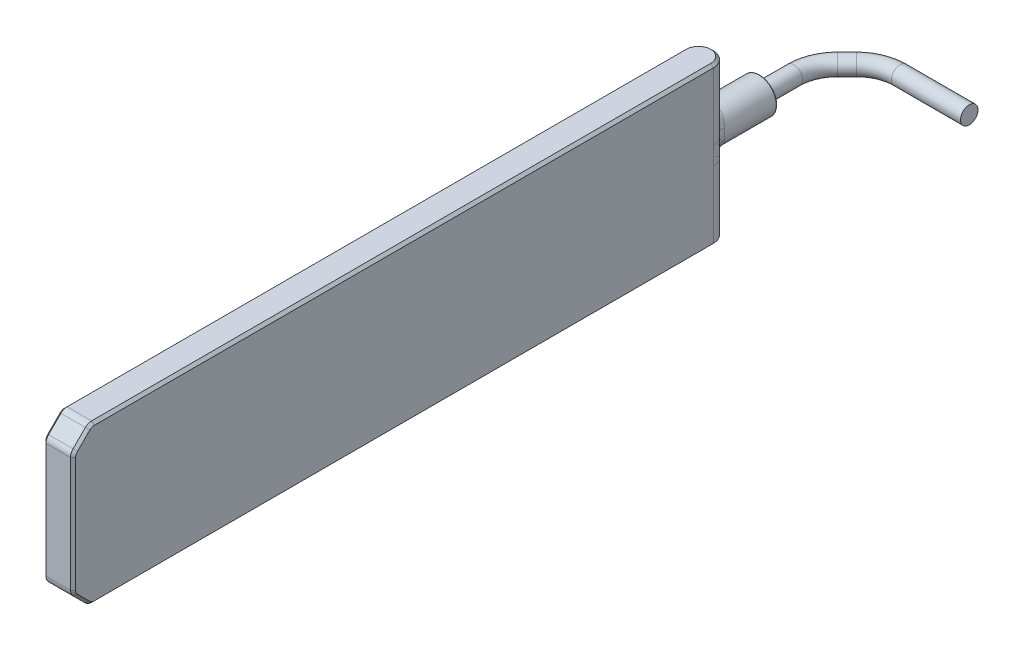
ISO-10303-21;
HEADER;
FILE_DESCRIPTION(('STEP AP214'),'2;1');
FILE_NAME('part.step','',(''),(''),'','','');
FILE_SCHEMA(('AUTOMOTIVE_DESIGN { 1 0 10303 214 1 1 1 1 }'));
ENDSEC;
DATA;
#1=APPLICATION_CONTEXT('core data for automotive mechanical design processes');
#2=APPLICATION_PROTOCOL_DEFINITION('international standard','automotive_design',2000,#1);
#3=PRODUCT_CONTEXT('',#1,'mechanical');
#4=PRODUCT('Part','Part','',(#3));
#5=PRODUCT_RELATED_PRODUCT_CATEGORY('part','',(#4));
#6=PRODUCT_DEFINITION_FORMATION('','',#4);
#7=PRODUCT_DEFINITION_CONTEXT('part definition',#1,'design');
#8=PRODUCT_DEFINITION('design','',#6,#7);
#9=PRODUCT_DEFINITION_SHAPE('','',#8);
#10=(LENGTH_UNIT() NAMED_UNIT(*) SI_UNIT(.MILLI.,.METRE.));
#11=(NAMED_UNIT(*) PLANE_ANGLE_UNIT() SI_UNIT($,.RADIAN.));
#12=(NAMED_UNIT(*) SI_UNIT($,.STERADIAN.) SOLID_ANGLE_UNIT());
#13=UNCERTAINTY_MEASURE_WITH_UNIT(LENGTH_MEASURE(1.E-05),#10,'distance_accuracy_value','');
#14=(GEOMETRIC_REPRESENTATION_CONTEXT(3) GLOBAL_UNCERTAINTY_ASSIGNED_CONTEXT((#13)) GLOBAL_UNIT_ASSIGNED_CONTEXT((#10,
#11,#12)) REPRESENTATION_CONTEXT('',''));
#15=CARTESIAN_POINT('',(0.,0.,0.));
#16=DIRECTION('',(0.,0.,1.));
#17=DIRECTION('',(1.,0.,0.));
#18=AXIS2_PLACEMENT_3D('',#15,#16,#17);
#19=CARTESIAN_POINT('',(12.3,0.,-17.));
#20=DIRECTION('',(1.,0.,0.));
#21=DIRECTION('',(0.,0.,-1.));
#22=AXIS2_PLACEMENT_3D('',#19,#20,#21);
#23=PLANE('',#22);
#24=CARTESIAN_POINT('',(12.3,0.,-17.));
#25=DIRECTION('',(1.,0.,0.));
#26=DIRECTION('',(0.,0.,-1.));
#27=AXIS2_PLACEMENT_3D('',#24,#25,#26);
#28=CIRCLE('',#27,1.);
#29=CARTESIAN_POINT('',(12.3,0.,-18.));
#30=VERTEX_POINT('',#29);
#31=EDGE_CURVE('E604',#30,#30,#28,.F.);
#32=ORIENTED_EDGE('',*,*,#31,.F.);
#33=EDGE_LOOP('',(#32));
#34=FACE_BOUND('',#33,.T.);
#35=ADVANCED_FACE('F18',(#34),#23,.T.);
#36=CARTESIAN_POINT('',(4.37106781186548,0.,-17.));
#37=DIRECTION('',(1.,0.,0.));
#38=DIRECTION('',(0.,0.,-1.));
#39=AXIS2_PLACEMENT_3D('',#36,#37,#38);
#40=CYLINDRICAL_SURFACE('',#39,1.);
#41=ORIENTED_EDGE('',*,*,#31,.T.);
#42=EDGE_LOOP('',(#41));
#43=FACE_BOUND('',#42,.T.);
#44=CARTESIAN_POINT('',(4.37106781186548,0.,-17.));
#45=DIRECTION('',(1.,0.,0.));
#46=DIRECTION('',(0.,0.,-1.));
#47=AXIS2_PLACEMENT_3D('',#44,#45,#46);
#48=CIRCLE('',#47,1.);
#49=CARTESIAN_POINT('',(4.37106781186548,0.,-18.));
#50=VERTEX_POINT('',#49);
#51=EDGE_CURVE('E601',#50,#50,#48,.F.);
#52=ORIENTED_EDGE('',*,*,#51,.F.);
#53=EDGE_LOOP('',(#52));
#54=FACE_BOUND('',#53,.T.);
#55=ADVANCED_FACE('F596',(#43,#54),#40,.T.);
#56=CARTESIAN_POINT('',(4.37106781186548,0.,-12.));
#57=DIRECTION('',(0.,-1.,0.));
#58=DIRECTION('',(0.,0.,-1.));
#59=AXIS2_PLACEMENT_3D('',#56,#57,#58);
#60=TOROIDAL_SURFACE('',#59,5.,1.);
#61=CARTESIAN_POINT('',(0.835533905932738,0.,-15.5355339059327));
#62=DIRECTION('',(0.707106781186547,0.,-0.707106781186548));
#63=DIRECTION('',(-0.707106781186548,0.,-0.707106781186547));
#64=AXIS2_PLACEMENT_3D('',#61,#62,#63);
#65=CIRCLE('',#64,1.);
#66=CARTESIAN_POINT('',(0.128427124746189,0.,-16.2426406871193));
#67=VERTEX_POINT('',#66);
#68=EDGE_CURVE('E600',#67,#67,#65,.F.);
#69=ORIENTED_EDGE('',*,*,#68,.F.);
#70=EDGE_LOOP('',(#69));
#71=FACE_BOUND('',#70,.T.);
#72=ORIENTED_EDGE('',*,*,#51,.T.);
#73=EDGE_LOOP('',(#72));
#74=FACE_BOUND('',#73,.T.);
#75=ADVANCED_FACE('F592',(#71,#74),#60,.T.);
#76=CARTESIAN_POINT('',(-0.235533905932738,0.,-14.4644660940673));
#77=DIRECTION('',(0.707106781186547,0.,-0.707106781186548));
#78=DIRECTION('',(-0.707106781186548,0.,-0.707106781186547));
#79=AXIS2_PLACEMENT_3D('',#76,#77,#78);
#80=CYLINDRICAL_SURFACE('',#79,1.);
#81=ORIENTED_EDGE('',*,*,#68,.T.);
#82=EDGE_LOOP('',(#81));
#83=FACE_BOUND('',#82,.T.);
#84=CARTESIAN_POINT('',(-0.235533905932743,0.,-14.4644660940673));
#85=DIRECTION('',(0.707106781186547,0.,-0.707106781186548));
#86=DIRECTION('',(-0.707106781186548,0.,-0.707106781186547));
#87=AXIS2_PLACEMENT_3D('',#84,#85,#86);
#88=CIRCLE('',#87,1.);
#89=CARTESIAN_POINT('',(-0.942640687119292,0.,-15.1715728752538));
#90=VERTEX_POINT('',#89);
#91=EDGE_CURVE('E573',#90,#90,#88,.F.);
#92=ORIENTED_EDGE('',*,*,#91,.F.);
#93=EDGE_LOOP('',(#92));
#94=FACE_BOUND('',#93,.T.);
#95=ADVANCED_FACE('F588',(#83,#94),#80,.T.);
#96=CARTESIAN_POINT('',(3.3,0.,-10.9289321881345));
#97=DIRECTION('',(0.,-1.,0.));
#98=DIRECTION('',(0.,0.,-1.));
#99=AXIS2_PLACEMENT_3D('',#96,#97,#98);
#100=TOROIDAL_SURFACE('',#99,5.,1.);
#101=CARTESIAN_POINT('',(-1.7,0.,-10.9289321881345));
#102=DIRECTION('',(0.,0.,1.));
#103=DIRECTION('',(1.,0.,0.));
#104=AXIS2_PLACEMENT_3D('',#101,#102,#103);
#105=CIRCLE('',#104,1.);
#106=CARTESIAN_POINT('',(-0.699999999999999,0.,-10.9289321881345));
#107=VERTEX_POINT('',#106);
#108=EDGE_CURVE('E568',#107,#107,#105,.T.);
#109=ORIENTED_EDGE('',*,*,#108,.F.);
#110=EDGE_LOOP('',(#109));
#111=FACE_BOUND('',#110,.T.);
#112=ORIENTED_EDGE('',*,*,#91,.T.);
#113=EDGE_LOOP('',(#112));
#114=FACE_BOUND('',#113,.T.);
#115=ADVANCED_FACE('F583',(#111,#114),#100,.T.);
#116=CARTESIAN_POINT('',(-1.7,0.,-10.9289321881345));
#117=DIRECTION('',(0.,0.,1.));
#118=DIRECTION('',(1.,0.,0.));
#119=AXIS2_PLACEMENT_3D('',#116,#117,#118);
#120=CYLINDRICAL_SURFACE('',#119,1.);
#121=CARTESIAN_POINT('',(-1.7,0.,-6.9));
#122=DIRECTION('',(0.,0.,-1.));
#123=DIRECTION('',(-1.,0.,0.));
#124=AXIS2_PLACEMENT_3D('',#121,#122,#123);
#125=CIRCLE('',#124,1.);
#126=CARTESIAN_POINT('',(-2.7,0.,-6.9));
#127=VERTEX_POINT('',#126);
#128=EDGE_CURVE('E566',#127,#127,#125,.F.);
#129=ORIENTED_EDGE('',*,*,#128,.F.);
#130=EDGE_LOOP('',(#129));
#131=FACE_BOUND('',#130,.T.);
#132=ORIENTED_EDGE('',*,*,#108,.T.);
#133=EDGE_LOOP('',(#132));
#134=FACE_BOUND('',#133,.T.);
#135=ADVANCED_FACE('F587',(#131,#134),#120,.T.);
#136=CARTESIAN_POINT('',(-1.7,0.,-6.9));
#137=DIRECTION('',(0.,0.,-1.));
#138=DIRECTION('',(-1.,0.,0.));
#139=AXIS2_PLACEMENT_3D('',#136,#137,#138);
#140=TOROIDAL_SURFACE('',#139,1.1,0.1);
#141=ORIENTED_EDGE('',*,*,#128,.T.);
#142=EDGE_LOOP('',(#141));
#143=FACE_BOUND('',#142,.T.);
#144=CARTESIAN_POINT('',(-1.7,0.,-7.));
#145=DIRECTION('',(0.,0.,-1.));
#146=DIRECTION('',(-1.,0.,0.));
#147=AXIS2_PLACEMENT_3D('',#144,#145,#146);
#148=CIRCLE('',#147,1.1);
#149=CARTESIAN_POINT('',(-0.6,0.,-7.));
#150=VERTEX_POINT('',#149);
#151=CARTESIAN_POINT('',(-2.8,0.,-7.));
#152=VERTEX_POINT('',#151);
#153=EDGE_CURVE('E562',#150,#152,#148,.F.);
#154=ORIENTED_EDGE('',*,*,#153,.F.);
#155=CARTESIAN_POINT('',(-1.7,0.,-7.));
#156=DIRECTION('',(0.,0.,-1.));
#157=DIRECTION('',(1.,0.,0.));
#158=AXIS2_PLACEMENT_3D('',#155,#156,#157);
#159=CIRCLE('',#158,1.1);
#160=EDGE_CURVE('E560',#152,#150,#159,.F.);
#161=ORIENTED_EDGE('',*,*,#160,.F.);
#162=EDGE_LOOP('',(#154,#161));
#163=FACE_BOUND('',#162,.T.);
#164=ADVANCED_FACE('F561',(#143,#163),#140,.T.);
#165=CARTESIAN_POINT('',(-1.7,0.,-7.));
#166=DIRECTION('',(0.,0.,-1.));
#167=DIRECTION('',(-1.,0.,0.));
#168=AXIS2_PLACEMENT_3D('',#165,#166,#167);
#169=PLANE('',#168);
#170=CARTESIAN_POINT('',(-1.7,0.,-7.));
#171=DIRECTION('',(0.,0.,1.));
#172=DIRECTION('',(1.,0.,0.));
#173=AXIS2_PLACEMENT_3D('',#170,#171,#172);
#174=CIRCLE('',#173,1.9);
#175=CARTESIAN_POINT('',(0.200000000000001,0.,-7.));
#176=VERTEX_POINT('',#175);
#177=CARTESIAN_POINT('',(-3.6,0.,-7.));
#178=VERTEX_POINT('',#177);
#179=EDGE_CURVE('E1617',#176,#178,#174,.T.);
#180=ORIENTED_EDGE('',*,*,#179,.F.);
#181=CARTESIAN_POINT('',(-1.7,0.,-7.));
#182=DIRECTION('',(0.,0.,1.));
#183=DIRECTION('',(-1.,0.,0.));
#184=AXIS2_PLACEMENT_3D('',#181,#182,#183);
#185=CIRCLE('',#184,1.9);
#186=EDGE_CURVE('E548',#178,#176,#185,.T.);
#187=ORIENTED_EDGE('',*,*,#186,.F.);
#188=EDGE_LOOP('',(#180,#187));
#189=FACE_BOUND('',#188,.T.);
#190=ORIENTED_EDGE('',*,*,#160,.T.);
#191=ORIENTED_EDGE('',*,*,#153,.T.);
#192=EDGE_LOOP('',(#190,#191));
#193=FACE_BOUND('',#192,.T.);
#194=ADVANCED_FACE('F1064',(#189,#193),#169,.T.);
#195=CARTESIAN_POINT('',(-1.40000000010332,6.5857864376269,74.));
#196=DIRECTION('',(1.,0.,0.));
#197=DIRECTION('',(0.,0.,-1.));
#198=AXIS2_PLACEMENT_3D('',#195,#196,#197);
#199=CONICAL_SURFACE('',#198,1.00000000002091,0.785398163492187);
#200=DIRECTION('',(0.707106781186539,0.500000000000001,0.500000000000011));
#201=VECTOR('',#200,1.);
#202=CARTESIAN_POINT('',(-1.7,7.08076118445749,74.4949747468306));
#203=LINE('',#202,#201);
#204=CARTESIAN_POINT('',(-1.70000000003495,7.08076118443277,74.4949747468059));
#205=VERTEX_POINT('',#204);
#206=CARTESIAN_POINT('',(-1.40000000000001,7.29289321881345,74.7071067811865));
#207=VERTEX_POINT('',#206);
#208=EDGE_CURVE('E1460',#205,#207,#203,.T.);
#209=ORIENTED_EDGE('',*,*,#208,.F.);
#210=CARTESIAN_POINT('',(-1.70000000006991,6.5857864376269,74.));
#211=DIRECTION('',(1.,0.,0.));
#212=DIRECTION('',(0.,0.,-1.));
#213=AXIS2_PLACEMENT_3D('',#210,#211,#212);
#214=CIRCLE('',#213,0.699999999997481);
#215=CARTESIAN_POINT('',(-1.70000000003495,6.58578643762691,74.699999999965));
#216=VERTEX_POINT('',#215);
#217=EDGE_CURVE('E642',#205,#216,#214,.T.);
#218=ORIENTED_EDGE('',*,*,#217,.T.);
#219=DIRECTION('',(0.707106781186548,0.,0.707106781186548));
#220=VECTOR('',#219,1.);
#221=CARTESIAN_POINT('',(-1.40000000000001,6.58578643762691,75.));
#222=LINE('',#221,#220);
#223=CARTESIAN_POINT('',(-1.40000000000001,6.5857864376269,75.));
#224=VERTEX_POINT('',#223);
#225=EDGE_CURVE('E1439',#224,#216,#222,.F.);
#226=ORIENTED_EDGE('',*,*,#225,.F.);
#227=CARTESIAN_POINT('',(-1.40000000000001,6.5857864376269,74.));
#228=DIRECTION('',(-1.,0.,0.));
#229=DIRECTION('',(0.,0.,1.));
#230=AXIS2_PLACEMENT_3D('',#227,#228,#229);
#231=CIRCLE('',#230,1.);
#232=EDGE_CURVE('E1463',#207,#224,#231,.F.);
#233=ORIENTED_EDGE('',*,*,#232,.F.);
#234=EDGE_LOOP('',(#209,#218,#226,#233));
#235=FACE_BOUND('',#234,.T.);
#236=ADVANCED_FACE('F1055',(#235),#199,.T.);
#237=CARTESIAN_POINT('',(-1.40000000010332,-6.58578643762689,74.));
#238=DIRECTION('',(1.,0.,0.));
#239=DIRECTION('',(0.,0.,-1.));
#240=AXIS2_PLACEMENT_3D('',#237,#238,#239);
#241=CONICAL_SURFACE('',#240,0.999999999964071,0.785398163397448);
#242=DIRECTION('',(0.707106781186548,0.,0.707106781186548));
#243=VECTOR('',#242,1.);
#244=CARTESIAN_POINT('',(-1.40000000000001,-6.58578643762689,75.));
#245=LINE('',#244,#243);
#246=CARTESIAN_POINT('',(-1.69999999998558,-6.58578643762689,74.7000000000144));
#247=VERTEX_POINT('',#246);
#248=CARTESIAN_POINT('',(-1.40000000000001,-6.58578643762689,75.));
#249=VERTEX_POINT('',#248);
#250=EDGE_CURVE('E1437',#247,#249,#245,.T.);
#251=ORIENTED_EDGE('',*,*,#250,.F.);
#252=CARTESIAN_POINT('',(-1.69999999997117,-6.58578643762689,74.));
#253=DIRECTION('',(1.,0.,0.));
#254=DIRECTION('',(0.,0.,-1.));
#255=AXIS2_PLACEMENT_3D('',#252,#253,#254);
#256=CIRCLE('',#255,0.700000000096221);
#257=CARTESIAN_POINT('',(-1.69999999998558,-7.08076118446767,74.4949747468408));
#258=VERTEX_POINT('',#257);
#259=EDGE_CURVE('E638',#247,#258,#256,.T.);
#260=ORIENTED_EDGE('',*,*,#259,.T.);
#261=DIRECTION('',(-0.707106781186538,0.500000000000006,-0.500000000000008));
#262=VECTOR('',#261,1.);
#263=CARTESIAN_POINT('',(-1.4,-7.29289321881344,74.7071067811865));
#264=LINE('',#263,#262);
#265=CARTESIAN_POINT('',(-1.4,-7.29289321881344,74.7071067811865));
#266=VERTEX_POINT('',#265);
#267=EDGE_CURVE('E1416',#266,#258,#264,.T.);
#268=ORIENTED_EDGE('',*,*,#267,.F.);
#269=CARTESIAN_POINT('',(-1.40000000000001,-6.58578643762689,74.));
#270=DIRECTION('',(1.,0.,0.));
#271=DIRECTION('',(0.,0.,-1.));
#272=AXIS2_PLACEMENT_3D('',#269,#270,#271);
#273=CIRCLE('',#272,1.);
#274=EDGE_CURVE('E1440',#249,#266,#273,.T.);
#275=ORIENTED_EDGE('',*,*,#274,.F.);
#276=EDGE_LOOP('',(#251,#260,#268,#275));
#277=FACE_BOUND('',#276,.T.);
#278=ADVANCED_FACE('F1046',(#277),#241,.T.);
#279=CARTESIAN_POINT('',(-1.39999999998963,-8.,72.5857864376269));
#280=DIRECTION('',(1.,0.,0.));
#281=DIRECTION('',(0.,0.,-1.));
#282=AXIS2_PLACEMENT_3D('',#279,#280,#281);
#283=CONICAL_SURFACE('',#282,1.00000000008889,0.785398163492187);
#284=DIRECTION('',(0.707106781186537,-0.500000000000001,0.500000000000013));
#285=VECTOR('',#284,1.);
#286=CARTESIAN_POINT('',(-1.7,-8.49497474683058,73.0807611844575));
#287=LINE('',#286,#285);
#288=CARTESIAN_POINT('',(-1.7000000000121,-8.49497474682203,73.0807611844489));
#289=VERTEX_POINT('',#288);
#290=CARTESIAN_POINT('',(-1.4,-8.70710678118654,73.2928932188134));
#291=VERTEX_POINT('',#290);
#292=EDGE_CURVE('E1414',#289,#291,#287,.T.);
#293=ORIENTED_EDGE('',*,*,#292,.F.);
#294=CARTESIAN_POINT('',(-1.7000000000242,-8.,72.5857864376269));
#295=DIRECTION('',(1.,0.,0.));
#296=DIRECTION('',(0.,0.,-1.));
#297=AXIS2_PLACEMENT_3D('',#294,#295,#296);
#298=CIRCLE('',#297,0.699999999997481);
#299=CARTESIAN_POINT('',(-1.7000000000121,-8.6999999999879,72.5857864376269));
#300=VERTEX_POINT('',#299);
#301=EDGE_CURVE('E633',#289,#300,#298,.T.);
#302=ORIENTED_EDGE('',*,*,#301,.T.);
#303=DIRECTION('',(-0.707106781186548,0.707106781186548,0.));
#304=VECTOR('',#303,1.);
#305=CARTESIAN_POINT('',(-1.40000000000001,-9.,72.5857864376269));
#306=LINE('',#305,#304);
#307=CARTESIAN_POINT('',(-1.40000000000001,-9.,72.5857864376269));
#308=VERTEX_POINT('',#307);
#309=EDGE_CURVE('E1404',#300,#308,#306,.F.);
#310=ORIENTED_EDGE('',*,*,#309,.T.);
#311=CARTESIAN_POINT('',(-1.40000000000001,-8.,72.5857864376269));
#312=DIRECTION('',(1.,0.,0.));
#313=DIRECTION('',(0.,0.,-1.));
#314=AXIS2_PLACEMENT_3D('',#311,#312,#313);
#315=CIRCLE('',#314,1.);
#316=EDGE_CURVE('E1417',#291,#308,#315,.T.);
#317=ORIENTED_EDGE('',*,*,#316,.F.);
#318=EDGE_LOOP('',(#293,#302,#310,#317));
#319=FACE_BOUND('',#318,.T.);
#320=ADVANCED_FACE('F1037',(#319),#283,.T.);
#321=CARTESIAN_POINT('',(-3.2,-3.16227766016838,18.));
#322=DIRECTION('',(0.,0.,-1.));
#323=DIRECTION('',(-1.,0.,0.));
#324=AXIS2_PLACEMENT_3D('',#321,#322,#323);
#325=CYLINDRICAL_SURFACE('',#324,1.5);
#326=DIRECTION('',(0.,0.,-1.));
#327=VECTOR('',#326,1.);
#328=CARTESIAN_POINT('',(-1.7,-3.16227766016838,75.));
#329=LINE('',#328,#327);
#330=CARTESIAN_POINT('',(-1.7,-3.16227766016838,1.69999999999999));
#331=VERTEX_POINT('',#330);
#332=CARTESIAN_POINT('',(-1.7,-3.16227766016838,17.));
#333=VERTEX_POINT('',#332);
#334=EDGE_CURVE('E1502',#331,#333,#329,.F.);
#335=ORIENTED_EDGE('',*,*,#334,.T.);
#336=CARTESIAN_POINT('',(-3.2,-3.16227766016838,17.));
#337=DIRECTION('',(0.,0.,1.));
#338=DIRECTION('',(1.,0.,0.));
#339=AXIS2_PLACEMENT_3D('',#336,#337,#338);
#340=CIRCLE('',#339,1.5);
#341=CARTESIAN_POINT('',(-2.55714285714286,-1.8070158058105,17.));
#342=VERTEX_POINT('',#341);
#343=EDGE_CURVE('E1221',#333,#342,#340,.T.);
#344=ORIENTED_EDGE('',*,*,#343,.T.);
#345=DIRECTION('',(0.,0.,-1.));
#346=VECTOR('',#345,1.);
#347=CARTESIAN_POINT('',(-2.55714285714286,-1.8070158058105,18.));
#348=LINE('',#347,#346);
#349=CARTESIAN_POINT('',(-2.55714285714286,-1.8070158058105,1.69999999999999));
#350=VERTEX_POINT('',#349);
#351=EDGE_CURVE('E485',#350,#342,#348,.F.);
#352=ORIENTED_EDGE('',*,*,#351,.F.);
#353=CARTESIAN_POINT('',(-3.2,-3.16227766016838,1.69999999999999));
#354=DIRECTION('',(0.,0.,-1.));
#355=DIRECTION('',(-1.,0.,0.));
#356=AXIS2_PLACEMENT_3D('',#353,#354,#355);
#357=CIRCLE('',#356,1.5);
#358=EDGE_CURVE('E1262',#350,#331,#357,.T.);
#359=ORIENTED_EDGE('',*,*,#358,.T.);
#360=EDGE_LOOP('',(#335,#344,#352,#359));
#361=FACE_BOUND('',#360,.T.);
#362=ADVANCED_FACE('F1028',(#361),#325,.F.);
#363=CARTESIAN_POINT('',(-2.55714285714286,-1.8070158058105,17.));
#364=CARTESIAN_POINT('',(-1.7,-2.21359436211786,17.));
#365=CARTESIAN_POINT('',(-1.7,-3.16227766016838,17.));
#366=CARTESIAN_POINT('',(-2.55714285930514,-1.80701580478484,17.1164881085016));
#367=CARTESIAN_POINT('',(-1.70000000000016,-2.21359435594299,17.1689055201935));
#368=CARTESIAN_POINT('',(-1.7,-3.16227765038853,17.2912202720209));
#369=CARTESIAN_POINT('',(-2.56076590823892,-1.78263496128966,17.2325278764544));
#370=CARTESIAN_POINT('',(-1.7,-2.17764518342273,17.3374608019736));
#371=CARTESIAN_POINT('',(-1.7,-3.10548067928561,17.5813196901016));
#372=CARTESIAN_POINT('',(-2.57254761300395,-1.7109996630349,17.3947479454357));
#373=CARTESIAN_POINT('',(-1.7,-2.073737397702,17.5695612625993));
#374=CARTESIAN_POINT('',(-1.7,-2.94113962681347,17.9868698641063));
#375=CARTESIAN_POINT('',(-2.57748809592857,-1.68169209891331,17.4461153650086));
#376=CARTESIAN_POINT('',(-1.7,-2.03127663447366,17.6426336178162));
#377=CARTESIAN_POINT('',(-1.7,-2.87416923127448,18.1152884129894));
#378=CARTESIAN_POINT('',(-2.58990114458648,-1.61201898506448,17.5436137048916));
#379=CARTESIAN_POINT('',(-1.7,-1.93124271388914,17.7796361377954));
#380=CARTESIAN_POINT('',(-1.7,-2.71663839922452,18.359034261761));
#381=CARTESIAN_POINT('',(-2.59746403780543,-1.57120684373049,17.5900555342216));
#382=CARTESIAN_POINT('',(-1.7,-1.87293021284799,17.8440268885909));
#383=CARTESIAN_POINT('',(-1.7,-2.62507809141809,18.4751388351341));
#384=CARTESIAN_POINT('',(-2.61540502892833,-1.48054655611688,17.6743516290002));
#385=CARTESIAN_POINT('',(-1.7,-1.7451326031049,17.9583502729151));
#386=CARTESIAN_POINT('',(-1.7,-2.42507162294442,18.6858790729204));
#387=CARTESIAN_POINT('',(-2.62580623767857,-1.43054388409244,17.7126029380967));
#388=CARTESIAN_POINT('',(-1.69999999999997,-1.67525077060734,18.0088877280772));
#389=CARTESIAN_POINT('',(-1.7,-2.31621943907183,18.7815073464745));
#390=CARTESIAN_POINT('',(-2.6504378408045,-1.31985067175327,17.781610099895));
#391=CARTESIAN_POINT('',(-1.70000000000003,-1.52359819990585,18.096363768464));
#392=CARTESIAN_POINT('',(-1.7,-2.08149392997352,18.9540252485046));
#393=CARTESIAN_POINT('',(-2.66471085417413,-1.25914041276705,17.8122179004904));
#394=CARTESIAN_POINT('',(-1.70000000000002,-1.44162911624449,18.1330464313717));
#395=CARTESIAN_POINT('',(-1.7,-1.95562993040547,19.0305447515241));
#396=CARTESIAN_POINT('',(-2.71314747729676,-1.06377660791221,17.8904077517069));
#397=CARTESIAN_POINT('',(-1.69999999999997,-1.18419615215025,18.2193307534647));
#398=CARTESIAN_POINT('',(-1.7,-1.566694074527,19.2260193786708));
#399=CARTESIAN_POINT('',(-2.75539100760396,-0.912736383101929,17.9255710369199));
#400=CARTESIAN_POINT('',(-1.69999999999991,-0.993444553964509,18.2441878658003));
#401=CARTESIAN_POINT('',(-1.7,-1.28510980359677,19.3139810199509));
#402=CARTESIAN_POINT('',(-2.79923017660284,-0.732820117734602,17.9470418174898));
#403=CARTESIAN_POINT('',(-1.7,-0.789153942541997,18.2465618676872));
#404=CARTESIAN_POINT('',(-1.7,-0.999999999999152,19.3676045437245));
#405=(BOUNDED_SURFACE() B_SPLINE_SURFACE(3,2,((#363,#364,#365),(#366,#367,#368),(#369,#370,
#371),(#372,#373,#374),(#375,#376,#377),(#378,#379,#380),(#381,#382,#383),(#384,#385,#386),
(#387,#388,#389),(#390,#391,#392),(#393,#394,#395),(#396,#397,#398),(#399,#400,#401),(#402,#403,
#404)),.UNSPECIFIED.,.F.,.F.,.F.) B_SPLINE_SURFACE_WITH_KNOTS((4,2,2,2,2,2,4),(3,3),
(0.00930561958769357,0.0101727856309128,0.0106063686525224,0.0110399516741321,
0.0114735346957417,0.0119071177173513,0.0127742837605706),(0.,1.),
.UNSPECIFIED.) GEOMETRIC_REPRESENTATION_ITEM() RATIONAL_B_SPLINE_SURFACE(((1.,0.845154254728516,
1.),(1.,0.845146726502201,1.),(1.,0.84444090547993,1.),(1.,0.842111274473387,1.),(1.,
0.841133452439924,1.),(1.,0.83867025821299,1.),(1.,0.8371669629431,1.),(1.,0.83358754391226,1.),
(1.,0.831507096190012,1.),(1.,0.826555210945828,1.),(1.,0.823674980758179,1.),(1.,
0.813834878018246,1.),(1.,0.805325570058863,1.),(1.,0.795983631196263,1.))) REPRESENTATION_ITEM('') SURFACE());
#406=CARTESIAN_POINT('',(-1.7,-3.16227766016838,17.));
#407=CARTESIAN_POINT('',(-1.7,-3.16227765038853,17.2912202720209));
#408=CARTESIAN_POINT('',(-1.7,-3.10548067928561,17.5813196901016));
#409=CARTESIAN_POINT('',(-1.7,-2.94113962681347,17.9868698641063));
#410=CARTESIAN_POINT('',(-1.7,-2.87416923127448,18.1152884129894));
#411=CARTESIAN_POINT('',(-1.7,-2.71663839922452,18.359034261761));
#412=CARTESIAN_POINT('',(-1.7,-2.62507809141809,18.4751388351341));
#413=CARTESIAN_POINT('',(-1.7,-2.42507162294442,18.6858790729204));
#414=CARTESIAN_POINT('',(-1.7,-2.31621943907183,18.7815073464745));
#415=CARTESIAN_POINT('',(-1.7,-2.08149392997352,18.9540252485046));
#416=CARTESIAN_POINT('',(-1.7,-1.95562993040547,19.0305447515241));
#417=CARTESIAN_POINT('',(-1.7,-1.566694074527,19.2260193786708));
#418=CARTESIAN_POINT('',(-1.7,-1.28510980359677,19.3139810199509));
#419=CARTESIAN_POINT('',(-1.7,-0.999999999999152,19.3676045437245));
#420=(BOUNDED_CURVE() B_SPLINE_CURVE(3,(#406,#407,#408,#409,#410,#411,#412,#413,#414,#415,#416,
#417,#418,#419),.UNSPECIFIED.,.F.,.F.) B_SPLINE_CURVE_WITH_KNOTS((4,2,2,2,2,2,4),
(0.00930561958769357,0.0101727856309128,0.0106063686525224,0.0110399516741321,
0.0114735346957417,0.0119071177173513,0.0127742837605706),
.UNSPECIFIED.) CURVE() GEOMETRIC_REPRESENTATION_ITEM() RATIONAL_B_SPLINE_CURVE((1.,1.,1.,1.,1.,
1.,1.,1.,1.,1.,1.,1.,1.,1.)) REPRESENTATION_ITEM(''));
#421=CARTESIAN_POINT('',(-1.7,-0.999999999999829,19.3676045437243));
#422=VERTEX_POINT('',#421);
#423=EDGE_CURVE('E1507',#333,#422,#420,.T.);
#424=CARTESIAN_POINT('',(-3.2,-0.999999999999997,19.3676045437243));
#425=DIRECTION('',(0.,0.982768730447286,0.184839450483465));
#426=DIRECTION('',(0.,-0.184839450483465,0.982768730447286));
#427=AXIS2_PLACEMENT_3D('',#424,#425,#426);
#428=CIRCLE('',#427,1.5);
#429=CARTESIAN_POINT('',(-2.79923017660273,-0.73282011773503,17.9470418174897));
#430=VERTEX_POINT('',#429);
#431=EDGE_CURVE('E1609',#422,#430,#428,.T.);
#432=CARTESIAN_POINT('',(-2.55714285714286,-1.8070158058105,17.));
#433=CARTESIAN_POINT('',(-2.55714273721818,-1.80701606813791,17.011631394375));
#434=CARTESIAN_POINT('',(-2.55717266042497,-1.80677706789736,17.0232629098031));
#435=CARTESIAN_POINT('',(-2.55729754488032,-1.80582352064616,17.0464057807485));
#436=CARTESIAN_POINT('',(-2.55739194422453,-1.80511308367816,17.05791730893));
#437=CARTESIAN_POINT('',(-2.55764949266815,-1.80322737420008,17.0808069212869));
#438=CARTESIAN_POINT('',(-2.55781207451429,-1.80205594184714,17.0921853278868));
#439=CARTESIAN_POINT('',(-2.55820872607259,-1.79925974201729,17.1147961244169));
#440=CARTESIAN_POINT('',(-2.55844223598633,-1.79763853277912,17.1260289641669));
#441=CARTESIAN_POINT('',(-2.55898276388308,-1.79395451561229,17.148336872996));
#442=CARTESIAN_POINT('',(-2.55928923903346,-1.79189498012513,17.1594124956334));
#443=CARTESIAN_POINT('',(-2.55997697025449,-1.78734636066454,17.181394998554));
#444=CARTESIAN_POINT('',(-2.56035770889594,-1.78486026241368,17.1923025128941));
#445=CARTESIAN_POINT('',(-2.56119454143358,-1.77947079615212,17.2139386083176));
#446=CARTESIAN_POINT('',(-2.56165015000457,-1.77657013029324,17.2246678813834));
#447=CARTESIAN_POINT('',(-2.56263662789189,-1.77036399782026,17.2459380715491));
#448=CARTESIAN_POINT('',(-2.56316704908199,-1.76706095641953,17.2564797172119));
#449=CARTESIAN_POINT('',(-2.5643024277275,-1.76006268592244,17.2773659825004));
#450=CARTESIAN_POINT('',(-2.5649069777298,-1.75636961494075,17.2877113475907));
#451=CARTESIAN_POINT('',(-2.56618928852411,-1.74860400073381,17.3081971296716));
#452=CARTESIAN_POINT('',(-2.56686668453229,-1.7445333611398,17.318338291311));
#453=CARTESIAN_POINT('',(-2.56829282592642,-1.73602539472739,17.3384084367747));
#454=CARTESIAN_POINT('',(-2.56904124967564,-1.73158973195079,17.3483381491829));
#455=CARTESIAN_POINT('',(-2.57060698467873,-1.7223645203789,17.367978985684));
#456=CARTESIAN_POINT('',(-2.57142401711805,-1.7175764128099,17.3776908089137));
#457=CARTESIAN_POINT('',(-2.57300326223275,-1.70836527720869,17.3955227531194));
#458=CARTESIAN_POINT('',(-2.57375613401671,-1.70399061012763,17.4036687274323));
#459=CARTESIAN_POINT('',(-2.57530766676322,-1.69499921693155,17.4197926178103));
#460=CARTESIAN_POINT('',(-2.57610620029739,-1.69038316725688,17.4277709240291));
#461=CARTESIAN_POINT('',(-2.57813284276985,-1.67870874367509,17.4472355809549));
#462=CARTESIAN_POINT('',(-2.57938860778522,-1.67150944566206,17.4586351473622));
#463=CARTESIAN_POINT('',(-2.58135006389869,-1.66036654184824,17.4754144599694));
#464=CARTESIAN_POINT('',(-2.58201335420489,-1.65661445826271,17.4809275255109));
#465=CARTESIAN_POINT('',(-2.58336322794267,-1.64901294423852,17.4918300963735));
#466=CARTESIAN_POINT('',(-2.58404963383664,-1.64516429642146,17.4972201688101));
#467=CARTESIAN_POINT('',(-2.58596488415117,-1.63447781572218,17.5118387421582));
#468=CARTESIAN_POINT('',(-2.58722169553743,-1.62752156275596,17.5209774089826));
#469=CARTESIAN_POINT('',(-2.58980684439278,-1.61334590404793,17.5388772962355));
#470=CARTESIAN_POINT('',(-2.59113427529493,-1.6061300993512,17.5476415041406));
#471=CARTESIAN_POINT('',(-2.59386006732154,-1.59145727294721,17.56479607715));
#472=CARTESIAN_POINT('',(-2.59525755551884,-1.58400350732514,17.5731893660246));
#473=CARTESIAN_POINT('',(-2.59812258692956,-1.56887595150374,17.58960637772));
#474=CARTESIAN_POINT('',(-2.59958929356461,-1.5612050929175,17.5976329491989));
#475=CARTESIAN_POINT('',(-2.60259173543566,-1.54566345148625,17.6133218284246));
#476=CARTESIAN_POINT('',(-2.60412667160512,-1.53779529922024,17.6209868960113));
#477=CARTESIAN_POINT('',(-2.60726441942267,-1.5218781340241,17.6359588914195));
#478=CARTESIAN_POINT('',(-2.60886647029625,-1.5138314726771,17.643268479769));
#479=CARTESIAN_POINT('',(-2.61213720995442,-1.4975753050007,17.6575363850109));
#480=CARTESIAN_POINT('',(-2.61380517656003,-1.48936789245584,17.6644972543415));
#481=CARTESIAN_POINT('',(-2.61720647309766,-1.47280708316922,17.6780753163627));
#482=CARTESIAN_POINT('',(-2.61893911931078,-1.4644555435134,17.6846949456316));
#483=CARTESIAN_POINT('',(-2.62221827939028,-1.44881572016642,17.6966838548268));
#484=CARTESIAN_POINT('',(-2.62375392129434,-1.44155502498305,17.7020921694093));
#485=CARTESIAN_POINT('',(-2.62687134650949,-1.42694752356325,17.7126679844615));
#486=CARTESIAN_POINT('',(-2.62845274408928,-1.41960164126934,17.7178368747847));
#487=CARTESIAN_POINT('',(-2.63166112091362,-1.40483251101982,17.727939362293));
#488=CARTESIAN_POINT('',(-2.63328773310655,-1.39741008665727,17.7328742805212));
#489=CARTESIAN_POINT('',(-2.63658489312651,-1.38249615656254,17.742515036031));
#490=CARTESIAN_POINT('',(-2.63825509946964,-1.37500538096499,17.74722212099));
#491=CARTESIAN_POINT('',(-2.64234369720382,-1.35684503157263,17.7583159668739));
#492=CARTESIAN_POINT('',(-2.64478988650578,-1.34612274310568,17.7646064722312));
#493=CARTESIAN_POINT('',(-2.64978525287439,-1.3245067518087,17.7767928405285));
#494=CARTESIAN_POINT('',(-2.65233423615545,-1.31361339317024,17.7826893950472));
#495=CARTESIAN_POINT('',(-2.6575255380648,-1.2916705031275,17.7941029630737));
#496=CARTESIAN_POINT('',(-2.66016773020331,-1.2806211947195,17.7996204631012));
#497=CARTESIAN_POINT('',(-2.66553728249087,-1.25838051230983,17.8102903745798));
#498=CARTESIAN_POINT('',(-2.66826456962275,-1.24718926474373,17.8154430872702));
#499=CARTESIAN_POINT('',(-2.67587005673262,-1.21623581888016,17.8291311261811));
#500=CARTESIAN_POINT('',(-2.6808288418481,-1.19633413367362,17.8373083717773));
#501=CARTESIAN_POINT('',(-2.69093894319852,-1.15618621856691,17.8526720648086));
#502=CARTESIAN_POINT('',(-2.69609039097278,-1.13593975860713,17.859857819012));
#503=CARTESIAN_POINT('',(-2.70654469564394,-1.09513865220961,17.8733217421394));
#504=CARTESIAN_POINT('',(-2.7118478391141,-1.07458346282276,17.8795980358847));
#505=CARTESIAN_POINT('',(-2.72256533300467,-1.03318862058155,17.8913243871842));
#506=CARTESIAN_POINT('',(-2.72798000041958,-1.01234823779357,17.8967715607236));
#507=CARTESIAN_POINT('',(-2.73888109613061,-0.970392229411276,17.9069189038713));
#508=CARTESIAN_POINT('',(-2.74436774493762,-0.949275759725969,17.9116153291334));
#509=CARTESIAN_POINT('',(-2.75537320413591,-0.906765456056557,17.9203378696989));
#510=CARTESIAN_POINT('',(-2.7608919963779,-0.885370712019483,17.9243595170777));
#511=CARTESIAN_POINT('',(-2.77751083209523,-0.820445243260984,17.9355759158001));
#512=CARTESIAN_POINT('',(-2.78852877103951,-0.776720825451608,17.9417936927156));
#513=CARTESIAN_POINT('',(-2.79923017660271,-0.732820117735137,17.9470418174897));
#514=B_SPLINE_CURVE_WITH_KNOTS('',3,(#432,#433,#434,#435,#436,#437,#438,#439,#440,#441,#442,
#443,#444,#445,#446,#447,#448,#449,#450,#451,#452,#453,#454,#455,#456,#457,#458,#459,#460,#461,
#462,#463,#464,#465,#466,#467,#468,#469,#470,#471,#472,#473,#474,#475,#476,#477,#478,#479,#480,
#481,#482,#483,#484,#485,#486,#487,#488,#489,#490,#491,#492,#493,#494,#495,#496,#497,#498,#499,
#500,#501,#502,#503,#504,#505,#506,#507,#508,#509,#510,#511,#512,#513),.UNSPECIFIED.,.F.,.F.,(4,
2,2,2,2,2,2,2,2,2,2,2,2,2,2,2,2,2,2,2,2,2,2,2,2,2,2,2,2,2,2,2,2,2,2,2,2,2,2,2,4),(0.,
0.0348918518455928,0.0694834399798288,0.103792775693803,0.137838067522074,0.171637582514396,
0.205209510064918,0.238571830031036,0.271742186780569,0.304737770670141,0.337575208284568,
0.370270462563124,0.402838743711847,0.430664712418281,0.458416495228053,0.499022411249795,
0.519125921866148,0.539099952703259,0.573751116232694,0.608032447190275,0.641960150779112,
0.675549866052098,0.708816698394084,0.741775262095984,0.774439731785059,0.8068239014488,
0.834369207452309,0.861726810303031,0.888904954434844,0.915911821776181,0.953912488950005,
0.991844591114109,1.02972706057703,1.06757787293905,1.13378750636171,1.20004320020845,
1.26643361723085,1.33304993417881,1.39998877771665,1.46735470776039,1.60382597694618),.UNSPECIFIED.);
#515=EDGE_CURVE('E1229',#342,#430,#514,.T.);
#516=ORIENTED_EDGE('',*,*,#423,.T.);
#517=ORIENTED_EDGE('',*,*,#431,.T.);
#518=ORIENTED_EDGE('',*,*,#515,.F.);
#519=ORIENTED_EDGE('',*,*,#343,.F.);
#520=EDGE_LOOP('',(#516,#517,#518,#519));
#521=FACE_BOUND('',#520,.T.);
#522=ADVANCED_FACE('F1019',(#521),#405,.F.);
#523=CARTESIAN_POINT('',(-2.79923017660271,-0.732820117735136,17.9470418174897));
#524=CARTESIAN_POINT('',(-1.7,-0.789153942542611,18.2465618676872));
#525=CARTESIAN_POINT('',(-1.7,-0.999999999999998,19.3676045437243));
#526=CARTESIAN_POINT('',(-2.83030302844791,-0.60529691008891,17.9622601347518));
#527=CARTESIAN_POINT('',(-1.7,-0.640930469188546,18.2482843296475));
#528=CARTESIAN_POINT('',(-1.7,-0.796837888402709,19.4058153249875));
#529=CARTESIAN_POINT('',(-2.86187781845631,-0.460917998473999,17.971000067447));
#530=CARTESIAN_POINT('',(-1.69999999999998,-0.483667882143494,18.2390802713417));
#531=CARTESIAN_POINT('',(-1.7,-0.591627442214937,19.4275001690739));
#532=CARTESIAN_POINT('',(-2.90041552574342,-0.145670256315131,17.9802406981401));
#533=CARTESIAN_POINT('',(-1.70000000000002,-0.14985830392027,18.2251790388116));
#534=CARTESIAN_POINT('',(-1.7,-0.178710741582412,19.4506017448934));
#535=CARTESIAN_POINT('',(-2.90525305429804,0.0256353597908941,17.9809862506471));
#536=CARTESIAN_POINT('',(-1.70000000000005,0.0254589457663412,18.2227094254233));
#537=CARTESIAN_POINT('',(-1.7,0.029744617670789,19.452465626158));
#538=CARTESIAN_POINT('',(-2.88008775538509,0.350667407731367,17.9755176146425));
#539=CARTESIAN_POINT('',(-1.69999999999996,0.366146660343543,18.2328034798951));
#540=CARTESIAN_POINT('',(-1.7,0.443524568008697,19.4387940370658));
#541=CARTESIAN_POINT('',(-2.85202614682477,0.502643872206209,17.9691755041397));
#542=CARTESIAN_POINT('',(-1.70000000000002,0.528131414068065,18.2434428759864));
#543=CARTESIAN_POINT('',(-1.7,0.649101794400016,19.4229387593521));
#544=CARTESIAN_POINT('',(-2.79123870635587,0.772353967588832,17.9447922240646));
#545=CARTESIAN_POINT('',(-1.69999999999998,0.831053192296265,18.248789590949));
#546=CARTESIAN_POINT('',(-1.7,1.05599937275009,19.3619805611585));
#547=CARTESIAN_POINT('',(-2.759007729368,0.89156296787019,17.9266477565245));
#548=CARTESIAN_POINT('',(-1.70000000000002,0.972623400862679,18.2432964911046));
#549=CARTESIAN_POINT('',(-1.7,1.25729663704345,19.3166949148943));
#550=CARTESIAN_POINT('',(-2.73061078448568,1.00000000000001,17.8999361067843));
#551=CARTESIAN_POINT('',(-1.7,1.10855253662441,18.2216756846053));
#552=CARTESIAN_POINT('',(-1.7,1.45544760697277,19.2498402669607));
#553=(BOUNDED_SURFACE() B_SPLINE_SURFACE(3,2,((#523,#524,#525),(#526,#527,#528),(#529,#530,
#531),(#532,#533,#534),(#535,#536,#537),(#538,#539,#540),(#541,#542,#543),(#544,#545,#546),
(#547,#548,#549),(#550,#551,#552)),.UNSPECIFIED.,.F.,.F.,.F.) B_SPLINE_SURFACE_WITH_KNOTS((4,2,
2,2,4),(3,3),(0.00869849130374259,0.0093170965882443,0.009935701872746,0.0105543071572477,
0.0111729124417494),(0.,1.),
.UNSPECIFIED.) GEOMETRIC_REPRESENTATION_ITEM() RATIONAL_B_SPLINE_SURFACE(((1.,0.79598363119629,
1.),(1.,0.789498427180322,1.),(1.,0.782767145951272,1.),(1.,0.774518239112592,1.),(1.,
0.773470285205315,1.),(1.,0.778874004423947,1.),(1.,0.784877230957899,1.),(1.,0.797680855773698,
1.),(1.,0.804436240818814,1.),(1.,0.810224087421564,1.))) REPRESENTATION_ITEM('') SURFACE());
#554=CARTESIAN_POINT('',(-1.7,-0.999999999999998,19.3676045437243));
#555=CARTESIAN_POINT('',(-1.7,-0.796837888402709,19.4058153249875));
#556=CARTESIAN_POINT('',(-1.7,-0.591627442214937,19.4275001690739));
#557=CARTESIAN_POINT('',(-1.7,-0.178710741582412,19.4506017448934));
#558=CARTESIAN_POINT('',(-1.7,0.029744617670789,19.452465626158));
#559=CARTESIAN_POINT('',(-1.7,0.443524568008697,19.4387940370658));
#560=CARTESIAN_POINT('',(-1.7,0.649101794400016,19.4229387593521));
#561=CARTESIAN_POINT('',(-1.7,1.05599937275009,19.3619805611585));
#562=CARTESIAN_POINT('',(-1.7,1.25729663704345,19.3166949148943));
#563=CARTESIAN_POINT('',(-1.7,1.45544760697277,19.2498402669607));
#564=(BOUNDED_CURVE() B_SPLINE_CURVE(3,(#554,#555,#556,#557,#558,#559,#560,#561,#562,#563),
.UNSPECIFIED.,.F.,.F.) B_SPLINE_CURVE_WITH_KNOTS((4,2,2,2,4),(0.00869849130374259,
0.0093170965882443,0.009935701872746,0.0105543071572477,0.0111729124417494),
.UNSPECIFIED.) CURVE() GEOMETRIC_REPRESENTATION_ITEM() RATIONAL_B_SPLINE_CURVE((1.,1.,1.,1.,1.,
1.,1.,1.,1.,1.)) REPRESENTATION_ITEM(''));
#565=CARTESIAN_POINT('',(-1.7,1.45544760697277,19.2498402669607));
#566=VERTEX_POINT('',#565);
#567=EDGE_CURVE('E1542',#422,#566,#564,.T.);
#568=CARTESIAN_POINT('',(-3.2,1.45544760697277,19.2498402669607));
#569=DIRECTION('',(0.,0.947523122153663,-0.319687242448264));
#570=DIRECTION('',(0.,0.319687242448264,0.947523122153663));
#571=AXIS2_PLACEMENT_3D('',#568,#569,#570);
#572=CIRCLE('',#571,1.5);
#573=CARTESIAN_POINT('',(-2.73061078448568,1.00000000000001,17.8999361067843));
#574=VERTEX_POINT('',#573);
#575=EDGE_CURVE('E1566',#566,#574,#572,.T.);
#576=CARTESIAN_POINT('',(-2.9,0.,17.9797958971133));
#577=CARTESIAN_POINT('',(-2.90000036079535,0.0440700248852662,17.9797868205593));
#578=CARTESIAN_POINT('',(-2.89870521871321,0.0881268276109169,17.9795641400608));
#579=CARTESIAN_POINT('',(-2.89383953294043,0.174864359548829,17.9785950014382));
#580=CARTESIAN_POINT('',(-2.89033416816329,0.217548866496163,17.9778634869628));
#581=CARTESIAN_POINT('',(-2.88142724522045,0.301812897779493,17.9758126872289));
#582=CARTESIAN_POINT('',(-2.87606619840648,0.343397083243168,17.9745058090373));
#583=CARTESIAN_POINT('',(-2.86367255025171,0.42573208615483,17.9711848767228));
#584=CARTESIAN_POINT('',(-2.85666259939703,0.466486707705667,17.9691802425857));
#585=CARTESIAN_POINT('',(-2.84055990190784,0.55084892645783,17.9640654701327));
#586=CARTESIAN_POINT('',(-2.83134673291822,0.594428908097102,17.9608808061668));
#587=CARTESIAN_POINT('',(-2.81210749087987,0.679757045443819,17.953158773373));
#588=CARTESIAN_POINT('',(-2.80211853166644,0.721518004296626,17.9486697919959));
#589=CARTESIAN_POINT('',(-2.78179237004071,0.80347173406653,17.9380103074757));
#590=CARTESIAN_POINT('',(-2.77147310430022,0.843675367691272,17.9318911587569));
#591=CARTESIAN_POINT('',(-2.75092625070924,0.922665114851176,17.9175653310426));
#592=CARTESIAN_POINT('',(-2.7407024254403,0.961462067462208,17.9094123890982));
#593=CARTESIAN_POINT('',(-2.73061078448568,1.,17.8999361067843));
#594=B_SPLINE_CURVE_WITH_KNOTS('',3,(#576,#577,#578,#579,#580,#581,#582,#583,#584,#585,#586,
#587,#588,#589,#590,#591,#592,#593),.UNSPECIFIED.,.F.,.F.,(4,2,2,2,2,2,2,2,4),(0.,
0.132171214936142,0.26061617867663,0.386417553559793,0.510582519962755,0.644509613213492,
0.773993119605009,0.899800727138,1.02258305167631),.UNSPECIFIED.);
#595=CARTESIAN_POINT('',(-2.89999693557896,-6.19086084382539E-07,17.9797809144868));
#596=VERTEX_POINT('',#595);
#597=EDGE_CURVE('E1593',#596,#574,#594,.T.);
#598=CARTESIAN_POINT('',(-2.79923017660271,-0.732820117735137,17.9470418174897));
#599=CARTESIAN_POINT('',(-2.80625608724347,-0.703985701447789,17.9504789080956));
#600=CARTESIAN_POINT('',(-2.81309731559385,-0.675059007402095,17.9535118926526));
#601=CARTESIAN_POINT('',(-2.82641443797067,-0.616403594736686,17.958956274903));
#602=CARTESIAN_POINT('',(-2.83287931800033,-0.58667100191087,17.9613529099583));
#603=CARTESIAN_POINT('',(-2.84528214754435,-0.526302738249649,17.9656256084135));
#604=CARTESIAN_POINT('',(-2.85120350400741,-0.495662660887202,17.967487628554));
#605=CARTESIAN_POINT('',(-2.86233864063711,-0.433366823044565,17.970771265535));
#606=CARTESIAN_POINT('',(-2.86752879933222,-0.401706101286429,17.9721795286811));
#607=CARTESIAN_POINT('',(-2.87659063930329,-0.339826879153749,17.974529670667));
#608=CARTESIAN_POINT('',(-2.88051600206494,-0.309617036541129,17.9754916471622));
#609=CARTESIAN_POINT('',(-2.8873600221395,-0.248847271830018,17.9771086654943));
#610=CARTESIAN_POINT('',(-2.89027097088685,-0.218286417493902,17.9777613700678));
#611=CARTESIAN_POINT('',(-2.89502573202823,-0.156714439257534,17.9787946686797));
#612=CARTESIAN_POINT('',(-2.896856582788,-0.125702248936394,17.9791719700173));
#613=CARTESIAN_POINT('',(-2.89935302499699,-0.063128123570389,17.9796736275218));
#614=CARTESIAN_POINT('',(-2.89999934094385,-0.0315653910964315,17.9797938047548));
#615=CARTESIAN_POINT('',(-2.9,0.,17.9797958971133));
#616=B_SPLINE_CURVE_WITH_KNOTS('',3,(#598,#599,#600,#601,#602,#603,#604,#605,#606,#607,#608,
#609,#610,#611,#612,#613,#614,#615),.UNSPECIFIED.,.F.,.F.,(4,2,2,2,2,2,2,2,4),(0.,
0.0896248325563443,0.181176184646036,0.274949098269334,0.371272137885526,0.462690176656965,
0.554788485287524,0.647970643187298,0.742656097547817),.UNSPECIFIED.);
#617=EDGE_CURVE('E535',#430,#596,#616,.T.);
#618=ORIENTED_EDGE('',*,*,#567,.T.);
#619=ORIENTED_EDGE('',*,*,#575,.T.);
#620=ORIENTED_EDGE('',*,*,#597,.F.);
#621=ORIENTED_EDGE('',*,*,#617,.F.);
#622=ORIENTED_EDGE('',*,*,#431,.F.);
#623=EDGE_LOOP('',(#618,#619,#620,#621,#622));
#624=FACE_BOUND('',#623,.T.);
#625=ADVANCED_FACE('F1010',(#624),#553,.F.);
#626=CARTESIAN_POINT('',(-1.7,3.16227766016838,17.));
#627=CARTESIAN_POINT('',(-1.7,2.21359436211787,17.));
#628=CARTESIAN_POINT('',(-2.55714285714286,1.8070158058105,17.));
#629=CARTESIAN_POINT('',(-1.7,3.16227765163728,17.2540404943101));
#630=CARTESIAN_POINT('',(-1.70000000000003,2.21359435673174,17.1473362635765));
#631=CARTESIAN_POINT('',(-2.55714285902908,1.80701580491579,17.1016161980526));
#632=CARTESIAN_POINT('',(-1.7,3.12051340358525,17.5010515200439));
#633=CARTESIAN_POINT('',(-1.70000000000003,2.18717461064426,17.2908119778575));
#634=CARTESIAN_POINT('',(-2.55983108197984,1.78906595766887,17.2004206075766));
#635=CARTESIAN_POINT('',(-1.7,2.95449350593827,17.980768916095));
#636=CARTESIAN_POINT('',(-1.69999999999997,2.08217227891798,17.5665350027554));
#637=CARTESIAN_POINT('',(-2.57150480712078,1.71689320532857,17.3923075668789));
#638=CARTESIAN_POINT('',(-1.7,2.83426350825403,18.2011924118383));
#639=CARTESIAN_POINT('',(-1.7,2.00585769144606,17.6920913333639));
#640=CARTESIAN_POINT('',(-2.5801917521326,1.66447159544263,17.4804769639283));
#641=CARTESIAN_POINT('',(-1.7,2.52344609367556,18.6017923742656));
#642=CARTESIAN_POINT('',(-1.7,1.80800634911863,17.9142090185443));
#643=CARTESIAN_POINT('',(-2.60608507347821,1.52564590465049,17.6407169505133));
#644=CARTESIAN_POINT('',(-1.7,2.33925299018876,18.773265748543));
#645=CARTESIAN_POINT('',(-1.70000000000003,1.68995582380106,18.0061314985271));
#646=CARTESIAN_POINT('',(-2.62278482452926,1.44223445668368,17.7093062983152));
#647=CARTESIAN_POINT('',(-1.7,1.92171064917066,19.0593161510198));
#648=CARTESIAN_POINT('',(-1.69999999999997,1.41937458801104,18.1483918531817));
#649=CARTESIAN_POINT('',(-2.66804505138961,1.24335132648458,17.8237264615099));
#650=CARTESIAN_POINT('',(-1.7,1.69352285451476,19.1695154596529));
#651=CARTESIAN_POINT('',(-1.7,1.26913280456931,18.1961338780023));
#652=CARTESIAN_POINT('',(-2.69648047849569,1.13033054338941,17.8678313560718));
#653=CARTESIAN_POINT('',(-1.7,1.45544760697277,19.2498402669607));
#654=CARTESIAN_POINT('',(-1.7,1.10855253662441,18.2216756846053));
#655=CARTESIAN_POINT('',(-2.73061078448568,1.00000000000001,17.8999361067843));
#656=(BOUNDED_SURFACE() B_SPLINE_SURFACE(3,2,((#626,#627,#628),(#629,#630,#631),(#632,#633,
#634),(#635,#636,#637),(#638,#639,#640),(#641,#642,#643),(#644,#645,#646),(#647,#648,#649),
(#650,#651,#652),(#653,#654,#655)),.UNSPECIFIED.,.F.,.F.,.F.) B_SPLINE_SURFACE_WITH_KNOTS((4,2,
2,2,4),(3,3),(0.,0.000751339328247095,0.00150267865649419,0.00225401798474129,
0.00300535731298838),(0.,1.),
.UNSPECIFIED.) GEOMETRIC_REPRESENTATION_ITEM() RATIONAL_B_SPLINE_SURFACE(((1.,0.845154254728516,
1.),(1.,0.845142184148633,1.),(1.,0.844624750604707,1.),(1.,0.842318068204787,1.),(1.,
0.84060060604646,1.),(1.,0.835450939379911,1.),(1.,0.832121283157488,1.),(1.,0.823006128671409,
1.),(1.,0.817283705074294,1.),(1.,0.810224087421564,1.))) REPRESENTATION_ITEM('') SURFACE());
#657=CARTESIAN_POINT('',(-1.7,1.45544760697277,19.2498402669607));
#658=CARTESIAN_POINT('',(-1.7,1.69352285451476,19.1695154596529));
#659=CARTESIAN_POINT('',(-1.7,1.92171064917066,19.0593161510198));
#660=CARTESIAN_POINT('',(-1.7,2.33925299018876,18.773265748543));
#661=CARTESIAN_POINT('',(-1.7,2.52344609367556,18.6017923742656));
#662=CARTESIAN_POINT('',(-1.7,2.83426350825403,18.2011924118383));
#663=CARTESIAN_POINT('',(-1.7,2.95449350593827,17.980768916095));
#664=CARTESIAN_POINT('',(-1.7,3.12051340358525,17.5010515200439));
#665=CARTESIAN_POINT('',(-1.7,3.16227765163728,17.2540404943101));
#666=CARTESIAN_POINT('',(-1.7,3.16227766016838,17.));
#667=(BOUNDED_CURVE() B_SPLINE_CURVE(3,(#657,#658,#659,#660,#661,#662,#663,#664,#665,#666),
.UNSPECIFIED.,.F.,.F.) B_SPLINE_CURVE_WITH_KNOTS((4,2,2,2,4),(0.,0.000751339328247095,
0.00150267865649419,0.00225401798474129,0.00300535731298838),
.UNSPECIFIED.) CURVE() GEOMETRIC_REPRESENTATION_ITEM() RATIONAL_B_SPLINE_CURVE((1.,1.,1.,1.,1.,
1.,1.,1.,1.,1.)) REPRESENTATION_ITEM(''));
#668=CARTESIAN_POINT('',(-1.7,3.16227766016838,17.));
#669=VERTEX_POINT('',#668);
#670=EDGE_CURVE('E1513',#566,#669,#667,.T.);
#671=CARTESIAN_POINT('',(-3.2,3.16227766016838,17.));
#672=DIRECTION('',(0.,0.,-1.));
#673=DIRECTION('',(-1.,0.,0.));
#674=AXIS2_PLACEMENT_3D('',#671,#672,#673);
#675=CIRCLE('',#674,1.5);
#676=CARTESIAN_POINT('',(-2.55714285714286,1.8070158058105,17.));
#677=VERTEX_POINT('',#676);
#678=EDGE_CURVE('E477',#669,#677,#675,.T.);
#679=CARTESIAN_POINT('',(-2.73061078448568,1.,17.8999361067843));
#680=CARTESIAN_POINT('',(-2.72620034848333,1.01684038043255,17.8957877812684));
#681=CARTESIAN_POINT('',(-2.72182923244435,1.03362808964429,17.8913766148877));
#682=CARTESIAN_POINT('',(-2.71317602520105,1.06708938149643,17.8819836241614));
#683=CARTESIAN_POINT('',(-2.70889404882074,1.08376280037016,17.8770011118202));
#684=CARTESIAN_POINT('',(-2.70043008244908,1.11698576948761,17.8664175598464));
#685=CARTESIAN_POINT('',(-2.69624835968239,1.13353492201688,17.8608150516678));
#686=CARTESIAN_POINT('',(-2.68799612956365,1.16649100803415,17.8489430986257));
#687=CARTESIAN_POINT('',(-2.68392606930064,1.18289722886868,17.8426713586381));
#688=CARTESIAN_POINT('',(-2.67590913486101,1.21554189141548,17.8294120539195));
#689=CARTESIAN_POINT('',(-2.67196291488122,1.23177921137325,17.8224213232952));
#690=CARTESIAN_POINT('',(-2.66420643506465,1.26405266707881,17.8076753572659));
#691=CARTESIAN_POINT('',(-2.66039706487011,1.28008715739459,17.7999160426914));
#692=CARTESIAN_POINT('',(-2.65292793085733,1.31191360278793,17.7835850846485));
#693=CARTESIAN_POINT('',(-2.64926932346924,1.32770325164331,17.7750084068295));
#694=CARTESIAN_POINT('',(-2.64211615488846,1.35899066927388,17.7569963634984));
#695=CARTESIAN_POINT('',(-2.63862305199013,1.37448530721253,17.7475549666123));
#696=CARTESIAN_POINT('',(-2.63181606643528,1.40512476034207,17.7277698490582));
#697=CARTESIAN_POINT('',(-2.62850398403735,1.42026541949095,17.7174190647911));
#698=CARTESIAN_POINT('',(-2.62207435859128,1.45013222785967,17.6957733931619));
#699=CARTESIAN_POINT('',(-2.6189589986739,1.46485297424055,17.6844703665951));
#700=CARTESIAN_POINT('',(-2.61445625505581,1.48650597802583,17.6668309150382));
#701=CARTESIAN_POINT('',(-2.61297822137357,1.4936797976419,17.6608117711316));
#702=CARTESIAN_POINT('',(-2.61007696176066,1.50789427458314,17.6485233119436));
#703=CARTESIAN_POINT('',(-2.60865409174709,1.5149339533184,17.6422527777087));
#704=CARTESIAN_POINT('',(-2.60586475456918,1.52886928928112,17.6294581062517));
#705=CARTESIAN_POINT('',(-2.60449867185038,1.53576384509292,17.6229326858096));
#706=CARTESIAN_POINT('',(-2.60182613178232,1.54939758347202,17.6096241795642));
#707=CARTESIAN_POINT('',(-2.60052009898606,1.55613553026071,17.602839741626));
#708=CARTESIAN_POINT('',(-2.59808074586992,1.56883809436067,17.58964353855));
#709=CARTESIAN_POINT('',(-2.59694218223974,1.57481975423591,17.5832491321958));
#710=CARTESIAN_POINT('',(-2.59470728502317,1.58663978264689,17.5702448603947));
#711=CARTESIAN_POINT('',(-2.59361127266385,1.59247697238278,17.5636338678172));
#712=CARTESIAN_POINT('',(-2.59146376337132,1.60399831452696,17.5501944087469));
#713=CARTESIAN_POINT('',(-2.59041261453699,1.60968117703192,17.543364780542));
#714=CARTESIAN_POINT('',(-2.58835536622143,1.62088422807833,17.5294870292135));
#715=CARTESIAN_POINT('',(-2.58734963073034,1.62640301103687,17.5224377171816));
#716=CARTESIAN_POINT('',(-2.58538408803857,1.63726785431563,17.5081197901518));
#717=CARTESIAN_POINT('',(-2.58442466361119,1.64261238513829,17.5008499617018));
#718=CARTESIAN_POINT('',(-2.58255237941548,1.65311841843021,17.486090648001));
#719=CARTESIAN_POINT('',(-2.58163991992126,1.65827826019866,17.4785999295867));
#720=CARTESIAN_POINT('',(-2.57986209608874,1.66840432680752,17.4633989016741));
#721=CARTESIAN_POINT('',(-2.57899714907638,1.67336875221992,17.4556873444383));
#722=CARTESIAN_POINT('',(-2.57731471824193,1.68309313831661,17.4400451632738));
#723=CARTESIAN_POINT('',(-2.57649766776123,1.68785115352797,17.4321132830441));
#724=CARTESIAN_POINT('',(-2.57491121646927,1.69715162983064,17.4160314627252));
#725=CARTESIAN_POINT('',(-2.57414226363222,1.70169199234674,17.407880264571));
#726=CARTESIAN_POINT('',(-2.57265203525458,1.71054583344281,17.391361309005));
#727=CARTESIAN_POINT('',(-2.57193122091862,1.71485705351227,17.3829922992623));
#728=CARTESIAN_POINT('',(-2.57053694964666,1.7232411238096,17.3660397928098));
#729=CARTESIAN_POINT('',(-2.56986396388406,1.72731154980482,17.3574550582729));
#730=CARTESIAN_POINT('',(-2.56856530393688,1.73520216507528,17.3400735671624));
#731=CARTESIAN_POINT('',(-2.56794011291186,1.73901975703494,17.3312755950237));
#732=CARTESIAN_POINT('',(-2.56677535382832,1.74614544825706,17.3140700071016));
#733=CARTESIAN_POINT('',(-2.56623291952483,1.74947027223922,17.3056695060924));
#734=CARTESIAN_POINT('',(-2.56519221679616,1.75585880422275,17.2887492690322));
#735=CARTESIAN_POINT('',(-2.56469403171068,1.75892201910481,17.2802293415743));
#736=CARTESIAN_POINT('',(-2.56374362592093,1.76478163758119,17.263075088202));
#737=CARTESIAN_POINT('',(-2.56329150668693,1.76757745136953,17.2544405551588));
#738=CARTESIAN_POINT('',(-2.56243427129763,1.77289690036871,17.2370622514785));
#739=CARTESIAN_POINT('',(-2.56202927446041,1.77541984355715,17.2283182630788));
#740=CARTESIAN_POINT('',(-2.56126717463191,1.78018824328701,17.2107264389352));
#741=CARTESIAN_POINT('',(-2.56091020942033,1.78243290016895,17.2018783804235));
#742=CARTESIAN_POINT('',(-2.56024473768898,1.78663956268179,17.184084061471));
#743=CARTESIAN_POINT('',(-2.55993638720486,1.78860065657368,17.1751375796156));
#744=CARTESIAN_POINT('',(-2.55936841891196,1.79223516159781,17.1571523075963));
#745=CARTESIAN_POINT('',(-2.55910897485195,1.79390754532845,17.1481133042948));
#746=CARTESIAN_POINT('',(-2.55863878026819,1.79695974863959,17.1299491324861));
#747=CARTESIAN_POINT('',(-2.55842822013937,1.79833842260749,17.1208237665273));
#748=CARTESIAN_POINT('',(-2.55805543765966,1.80079848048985,17.102493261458));
#749=CARTESIAN_POINT('',(-2.55789342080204,1.80187859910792,17.0932879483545));
#750=CARTESIAN_POINT('',(-2.55761703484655,1.80373700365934,17.0748041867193));
#751=CARTESIAN_POINT('',(-2.5575028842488,1.80451390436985,17.0655255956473));
#752=CARTESIAN_POINT('',(-2.55732123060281,1.80576146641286,17.0469021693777));
#753=CARTESIAN_POINT('',(-2.55725395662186,1.80623062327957,17.0375572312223));
#754=CARTESIAN_POINT('',(-2.55716462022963,1.80685866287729,17.0188082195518));
#755=CARTESIAN_POINT('',(-2.5571427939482,1.80701592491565,17.0094040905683));
#756=CARTESIAN_POINT('',(-2.55714285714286,1.8070158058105,17.));
#757=B_SPLINE_CURVE_WITH_KNOTS('',3,(#679,#680,#681,#682,#683,#684,#685,#686,#687,#688,#689,
#690,#691,#692,#693,#694,#695,#696,#697,#698,#699,#700,#701,#702,#703,#704,#705,#706,#707,#708,
#709,#710,#711,#712,#713,#714,#715,#716,#717,#718,#719,#720,#721,#722,#723,#724,#725,#726,#727,
#728,#729,#730,#731,#732,#733,#734,#735,#736,#737,#738,#739,#740,#741,#742,#743,#744,#745,#746,
#747,#748,#749,#750,#751,#752,#753,#754,#755,#756),.UNSPECIFIED.,.F.,.F.,(4,2,2,2,2,2,2,2,2,2,2,
2,2,2,2,2,2,2,2,2,2,2,2,2,2,2,2,2,2,2,2,2,2,2,2,2,2,2,4),(0.,0.0536877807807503,
0.107440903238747,0.161324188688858,0.215398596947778,0.269722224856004,0.324351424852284,
0.379342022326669,0.434750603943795,0.49063584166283,0.547059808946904,0.575497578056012,
0.604095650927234,0.632863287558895,0.661810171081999,0.688295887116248,0.714953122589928,
0.741789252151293,0.768811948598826,0.796029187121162,0.823449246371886,0.851080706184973,
0.878932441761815,0.907013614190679,0.935333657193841,0.963902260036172,0.992729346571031,
1.01987721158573,1.04707516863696,1.07433179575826,1.1016560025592,1.12905699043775,
1.15654420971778,1.18412731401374,1.21181611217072,1.23962051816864,1.26755049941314,
1.29561602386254,1.32382700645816),.UNSPECIFIED.);
#758=EDGE_CURVE('E486',#574,#677,#757,.T.);
#759=ORIENTED_EDGE('',*,*,#670,.T.);
#760=ORIENTED_EDGE('',*,*,#678,.T.);
#761=ORIENTED_EDGE('',*,*,#758,.F.);
#762=ORIENTED_EDGE('',*,*,#575,.F.);
#763=EDGE_LOOP('',(#759,#760,#761,#762));
#764=FACE_BOUND('',#763,.T.);
#765=ADVANCED_FACE('F1002',(#764),#656,.F.);
#766=CARTESIAN_POINT('',(-1.40000000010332,8.,72.5857864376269));
#767=DIRECTION('',(1.,0.,0.));
#768=DIRECTION('',(0.,0.,-1.));
#769=AXIS2_PLACEMENT_3D('',#766,#767,#768);
#770=CONICAL_SURFACE('',#769,0.999999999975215,0.785398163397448);
#771=DIRECTION('',(0.707106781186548,0.707106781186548,0.));
#772=VECTOR('',#771,1.);
#773=CARTESIAN_POINT('',(-1.7,8.70000000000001,72.5857864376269));
#774=LINE('',#773,#772);
#775=CARTESIAN_POINT('',(-1.40000000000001,9.,72.5857864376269));
#776=VERTEX_POINT('',#775);
#777=CARTESIAN_POINT('',(-1.69999999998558,8.70000000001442,72.5857864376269));
#778=VERTEX_POINT('',#777);
#779=EDGE_CURVE('E1480',#776,#778,#774,.F.);
#780=ORIENTED_EDGE('',*,*,#779,.T.);
#781=CARTESIAN_POINT('',(-1.69999999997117,8.,72.5857864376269));
#782=DIRECTION('',(1.,0.,0.));
#783=DIRECTION('',(0.,0.,-1.));
#784=AXIS2_PLACEMENT_3D('',#781,#782,#783);
#785=CIRCLE('',#784,0.700000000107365);
#786=CARTESIAN_POINT('',(-1.69999999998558,8.49497474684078,73.0807611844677));
#787=VERTEX_POINT('',#786);
#788=EDGE_CURVE('E628',#778,#787,#785,.T.);
#789=ORIENTED_EDGE('',*,*,#788,.T.);
#790=DIRECTION('',(-0.707106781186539,-0.500000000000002,-0.50000000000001));
#791=VECTOR('',#790,1.);
#792=CARTESIAN_POINT('',(-1.40000000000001,8.70710678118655,73.2928932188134));
#793=LINE('',#792,#791);
#794=CARTESIAN_POINT('',(-1.40000000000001,8.70710678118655,73.2928932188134));
#795=VERTEX_POINT('',#794);
#796=EDGE_CURVE('E1462',#795,#787,#793,.T.);
#797=ORIENTED_EDGE('',*,*,#796,.F.);
#798=CARTESIAN_POINT('',(-1.40000000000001,8.,72.5857864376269));
#799=DIRECTION('',(-1.,0.,0.));
#800=DIRECTION('',(0.,0.,1.));
#801=AXIS2_PLACEMENT_3D('',#798,#799,#800);
#802=CIRCLE('',#801,1.);
#803=EDGE_CURVE('E1487',#776,#795,#802,.F.);
#804=ORIENTED_EDGE('',*,*,#803,.F.);
#805=EDGE_LOOP('',(#780,#789,#797,#804));
#806=FACE_BOUND('',#805,.T.);
#807=ADVANCED_FACE('F995',(#806),#770,.T.);
#808=CARTESIAN_POINT('',(-1.7,0.,-6.9));
#809=DIRECTION('',(0.,0.,-1.));
#810=DIRECTION('',(-1.,0.,0.));
#811=AXIS2_PLACEMENT_3D('',#808,#809,#810);
#812=TOROIDAL_SURFACE('',#811,1.9,0.1);
#813=ORIENTED_EDGE('',*,*,#186,.T.);
#814=ORIENTED_EDGE('',*,*,#179,.T.);
#815=EDGE_LOOP('',(#813,#814));
#816=FACE_BOUND('',#815,.T.);
#817=CARTESIAN_POINT('',(-1.7,0.,-6.9));
#818=DIRECTION('',(0.,0.,-1.));
#819=DIRECTION('',(-1.,0.,0.));
#820=AXIS2_PLACEMENT_3D('',#817,#818,#819);
#821=CIRCLE('',#820,2.);
#822=CARTESIAN_POINT('',(-3.7,0.,-6.9));
#823=VERTEX_POINT('',#822);
#824=EDGE_CURVE('E493',#823,#823,#821,.F.);
#825=ORIENTED_EDGE('',*,*,#824,.F.);
#826=EDGE_LOOP('',(#825));
#827=FACE_BOUND('',#826,.T.);
#828=ADVANCED_FACE('F506',(#816,#827),#812,.T.);
#829=CARTESIAN_POINT('',(-2.7,0.,17.));
#830=DIRECTION('',(0.,1.,0.));
#831=DIRECTION('',(-1.,0.,0.));
#832=AXIS2_PLACEMENT_3D('',#829,#830,#831);
#833=CIRCLE('',#832,1.);
#834=TRIMMED_CURVE('',#833,(PARAMETER_VALUE(-3.14159265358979)),
(PARAMETER_VALUE(3.14159265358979)),.T.,.PARAMETER.);
#835=CARTESIAN_POINT('',(-1.7,0.,17.));
#836=DIRECTION('',(0.,0.,-1.));
#837=AXIS1_PLACEMENT('',#835,#836);
#838=SURFACE_OF_REVOLUTION('',#834,#837);
#839=ORIENTED_EDGE('',*,*,#758,.T.);
#840=CARTESIAN_POINT('',(-1.7,0.,17.));
#841=DIRECTION('',(0.,0.,-1.));
#842=DIRECTION('',(-1.,0.,0.));
#843=AXIS2_PLACEMENT_3D('',#840,#841,#842);
#844=CIRCLE('',#843,2.);
#845=EDGE_CURVE('E489',#342,#677,#844,.T.);
#846=ORIENTED_EDGE('',*,*,#845,.F.);
#847=ORIENTED_EDGE('',*,*,#515,.T.);
#848=ORIENTED_EDGE('',*,*,#617,.T.);
#849=ORIENTED_EDGE('',*,*,#597,.T.);
#850=EDGE_LOOP('',(#839,#846,#847,#848,#849));
#851=FACE_BOUND('',#850,.T.);
#852=ADVANCED_FACE('F500',(#851),#838,.F.);
#853=CARTESIAN_POINT('',(-3.2,3.16227766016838,18.));
#854=DIRECTION('',(0.,0.,-1.));
#855=DIRECTION('',(-1.,0.,0.));
#856=AXIS2_PLACEMENT_3D('',#853,#854,#855);
#857=CYLINDRICAL_SURFACE('',#856,1.5);
#858=DIRECTION('',(0.,0.,-1.));
#859=VECTOR('',#858,1.);
#860=CARTESIAN_POINT('',(-1.7,3.16227766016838,75.));
#861=LINE('',#860,#859);
#862=CARTESIAN_POINT('',(-1.7,3.16227766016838,1.69999999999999));
#863=VERTEX_POINT('',#862);
#864=EDGE_CURVE('E1510',#669,#863,#861,.T.);
#865=ORIENTED_EDGE('',*,*,#864,.T.);
#866=CARTESIAN_POINT('',(-3.2,3.16227766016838,1.69999999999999));
#867=DIRECTION('',(0.,0.,-1.));
#868=DIRECTION('',(-1.,0.,0.));
#869=AXIS2_PLACEMENT_3D('',#866,#867,#868);
#870=CIRCLE('',#869,1.5);
#871=CARTESIAN_POINT('',(-2.55714285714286,1.8070158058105,1.69999999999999));
#872=VERTEX_POINT('',#871);
#873=EDGE_CURVE('E444',#863,#872,#870,.T.);
#874=ORIENTED_EDGE('',*,*,#873,.T.);
#875=DIRECTION('',(0.,0.,-1.));
#876=VECTOR('',#875,1.);
#877=CARTESIAN_POINT('',(-2.55714285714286,1.8070158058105,18.));
#878=LINE('',#877,#876);
#879=EDGE_CURVE('E492',#677,#872,#878,.T.);
#880=ORIENTED_EDGE('',*,*,#879,.F.);
#881=ORIENTED_EDGE('',*,*,#678,.F.);
#882=EDGE_LOOP('',(#865,#874,#880,#881));
#883=FACE_BOUND('',#882,.T.);
#884=ADVANCED_FACE('F505',(#883),#857,.F.);
#885=CARTESIAN_POINT('',(-1.7,-3.16227766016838,1.69999999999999));
#886=CARTESIAN_POINT('',(-1.7,-2.21359436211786,1.69999999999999));
#887=CARTESIAN_POINT('',(-2.55714285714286,-1.8070158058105,1.69999999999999));
#888=CARTESIAN_POINT('',(-1.7,-3.16227766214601,1.58556920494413));
#889=CARTESIAN_POINT('',(-1.69999999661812,-2.21359436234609,1.55526801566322));
#890=CARTESIAN_POINT('',(-2.5571428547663,-1.8070158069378,1.48460085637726));
#891=CARTESIAN_POINT('',(-1.68856829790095,-3.17272755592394,1.47339876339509));
#892=CARTESIAN_POINT('',(-1.68211512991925,-2.21499660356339,1.41263265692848));
#893=CARTESIAN_POINT('',(-2.54484657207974,-1.81298717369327,1.27345649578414));
#894=CARTESIAN_POINT('',(-1.64408797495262,-3.21041576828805,1.25324979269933));
#895=CARTESIAN_POINT('',(-1.61569584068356,-2.21738750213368,1.14190762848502));
#896=CARTESIAN_POINT('',(-2.49700219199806,-1.83452329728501,0.859058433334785));
#897=CARTESIAN_POINT('',(-1.6104573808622,-3.23804098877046,1.14413672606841));
#898=CARTESIAN_POINT('',(-1.5656135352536,-2.21822454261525,1.0112712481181));
#899=CARTESIAN_POINT('',(-2.46082810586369,-1.85030913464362,0.653669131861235));
#900=CARTESIAN_POINT('',(-1.52355920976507,-3.30056534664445,0.937553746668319));
#901=CARTESIAN_POINT('',(-1.44586125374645,-2.21194344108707,0.779713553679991));
#902=CARTESIAN_POINT('',(-2.36735780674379,-1.88603734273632,0.264807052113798));
#903=CARTESIAN_POINT('',(-1.4704988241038,-3.33534232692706,0.839643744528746));
#904=CARTESIAN_POINT('',(-1.37547023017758,-2.20452172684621,0.677726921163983));
#905=CARTESIAN_POINT('',(-2.31028444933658,-1.90590989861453,0.080505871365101));
#906=CARTESIAN_POINT('',(-1.34471896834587,-3.40208389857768,0.653906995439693));
#907=CARTESIAN_POINT('',(-1.22849617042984,-2.17465688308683,0.504554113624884));
#908=CARTESIAN_POINT('',(-2.17499183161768,-1.94404794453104,-0.269116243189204));
#909=CARTESIAN_POINT('',(-1.27215115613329,-3.43373646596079,0.566802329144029));
#910=CARTESIAN_POINT('',(-1.15212614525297,-2.15144515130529,0.435064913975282));
#911=CARTESIAN_POINT('',(-2.09693569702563,-1.96213512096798,-0.433077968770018));
#912=CARTESIAN_POINT('',(-1.11274500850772,-3.48100198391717,0.409920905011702));
#913=CARTESIAN_POINT('',(-1.0166942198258,-2.09042602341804,0.329471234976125));
#914=CARTESIAN_POINT('',(-1.92547362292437,-1.989143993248,-0.728384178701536));
#915=CARTESIAN_POINT('',(-1.02507141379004,-3.49711801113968,0.339001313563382));
#916=CARTESIAN_POINT('',(-0.957707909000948,-2.05197064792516,0.293638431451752));
#917=CARTESIAN_POINT('',(-1.83116925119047,-1.99835314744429,-0.861879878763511));
#918=CARTESIAN_POINT('',(-0.83346938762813,-3.50218992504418,0.213925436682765));
#919=CARTESIAN_POINT('',(-0.870222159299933,-1.96932745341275,0.239346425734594));
#920=CARTESIAN_POINT('',(-1.62507631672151,-2.00125138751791,-1.0973168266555));
#921=CARTESIAN_POINT('',(-0.733141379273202,-3.4910047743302,0.162100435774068));
#922=CARTESIAN_POINT('',(-0.845119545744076,-1.92769572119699,0.22205898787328));
#923=CARTESIAN_POINT('',(-1.51716047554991,-1.99485986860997,-1.19486976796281));
#924=CARTESIAN_POINT('',(-0.524300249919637,-3.43234741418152,0.0789692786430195));
#925=CARTESIAN_POINT('',(-0.81638713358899,-1.85677038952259,0.179660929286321));
#926=CARTESIAN_POINT('',(-1.29252463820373,-1.96134138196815,-1.3513519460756));
#927=CARTESIAN_POINT('',(-0.415992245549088,-3.38422988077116,0.0481993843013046));
#928=CARTESIAN_POINT('',(-0.812796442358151,-1.82921643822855,0.154106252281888));
#929=CARTESIAN_POINT('',(-1.17602527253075,-1.9338456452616,-1.40927174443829));
#930=CARTESIAN_POINT('',(-0.205173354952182,-3.25081098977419,0.0090243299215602));
#931=CARTESIAN_POINT('',(-0.789738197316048,-1.78665612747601,0.0857982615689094));
#932=CARTESIAN_POINT('',(-0.949262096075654,-1.85760628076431,-1.48301302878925));
#933=CARTESIAN_POINT('',(-0.100498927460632,-3.16452883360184,0.));
#934=CARTESIAN_POINT('',(-0.769781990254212,-1.77113440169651,0.0439957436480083));
#935=CARTESIAN_POINT('',(-0.836648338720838,-1.80828953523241,-1.50000000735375));
#936=CARTESIAN_POINT('',(0.,-3.05941170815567,0.));
#937=CARTESIAN_POINT('',(-0.728571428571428,-1.74823526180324,0.));
#938=CARTESIAN_POINT('',(-0.728571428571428,-1.74823526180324,-1.50000000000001));
#939=(BOUNDED_SURFACE() B_SPLINE_SURFACE(3,2,((#885,#886,#887),(#888,#889,#890),(#891,#892,
#893),(#894,#895,#896),(#897,#898,#899),(#900,#901,#902),(#903,#904,#905),(#906,#907,#908),
(#909,#910,#911),(#912,#913,#914),(#915,#916,#917),(#918,#919,#920),(#921,#922,#923),(#924,#925,
#926),(#927,#928,#929),(#930,#931,#932),(#933,#934,#935),(#936,#937,#938)),.UNSPECIFIED.,.F.,
.F.,.F.) B_SPLINE_SURFACE_WITH_KNOTS((4,2,2,2,2,2,2,2,4),(3,3),(0.,0.000636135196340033,
0.00127227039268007,0.0019084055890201,0.00254454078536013,0.00318067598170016,
0.0038168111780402,0.00445294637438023,0.00508908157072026),(0.,1.),
.UNSPECIFIED.) GEOMETRIC_REPRESENTATION_ITEM() RATIONAL_B_SPLINE_SURFACE(((1.,0.845154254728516,
1.),(1.,0.845152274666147,1.),(1.,0.842460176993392,1.),(1.,0.832253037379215,1.),(1.,
0.824607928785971,1.),(1.,0.805799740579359,1.),(1.,0.794667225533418,1.),(1.,0.770359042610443,
1.),(1.,0.757239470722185,1.),(1.,0.732153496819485,1.),(1.,0.720017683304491,1.),(1.,
0.699620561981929,1.),(1.,0.691795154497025,1.),(1.,0.683283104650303,1.),(1.,0.682788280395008,
1.),(1.,0.689639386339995,1.),(1.,0.696925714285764,1.),(1.,0.707106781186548,1.))) REPRESENTATION_ITEM('') SURFACE());
#940=CARTESIAN_POINT('',(-2.55714285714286,-1.8070158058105,1.69999999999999));
#941=CARTESIAN_POINT('',(-2.5571428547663,-1.8070158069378,1.48460085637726));
#942=CARTESIAN_POINT('',(-2.54484657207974,-1.81298717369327,1.27345649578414));
#943=CARTESIAN_POINT('',(-2.49700219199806,-1.83452329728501,0.859058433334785));
#944=CARTESIAN_POINT('',(-2.46082810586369,-1.85030913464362,0.653669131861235));
#945=CARTESIAN_POINT('',(-2.36735780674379,-1.88603734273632,0.264807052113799));
#946=CARTESIAN_POINT('',(-2.31028444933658,-1.90590989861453,0.0805058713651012));
#947=CARTESIAN_POINT('',(-2.17499183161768,-1.94404794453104,-0.269116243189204));
#948=CARTESIAN_POINT('',(-2.09693569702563,-1.96213512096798,-0.433077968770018));
#949=CARTESIAN_POINT('',(-1.92547362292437,-1.989143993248,-0.728384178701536));
#950=CARTESIAN_POINT('',(-1.83116925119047,-1.99835314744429,-0.861879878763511));
#951=CARTESIAN_POINT('',(-1.62507631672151,-2.00125138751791,-1.0973168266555));
#952=CARTESIAN_POINT('',(-1.51716047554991,-1.99485986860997,-1.19486976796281));
#953=CARTESIAN_POINT('',(-1.29252463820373,-1.96134138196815,-1.3513519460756));
#954=CARTESIAN_POINT('',(-1.17602527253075,-1.9338456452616,-1.40927174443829));
#955=CARTESIAN_POINT('',(-0.949262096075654,-1.85760628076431,-1.48301302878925));
#956=CARTESIAN_POINT('',(-0.836648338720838,-1.80828953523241,-1.50000000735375));
#957=CARTESIAN_POINT('',(-0.728571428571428,-1.74823526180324,-1.50000000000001));
#958=(BOUNDED_CURVE() B_SPLINE_CURVE(3,(#940,#941,#942,#943,#944,#945,#946,#947,#948,#949,#950,
#951,#952,#953,#954,#955,#956,#957),.UNSPECIFIED.,.F.,.F.) B_SPLINE_CURVE_WITH_KNOTS((4,2,2,2,2,
2,2,2,4),(0.,0.000636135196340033,0.00127227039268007,0.0019084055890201,0.00254454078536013,
0.00318067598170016,0.0038168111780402,0.00445294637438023,0.00508908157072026),
.UNSPECIFIED.) CURVE() GEOMETRIC_REPRESENTATION_ITEM() RATIONAL_B_SPLINE_CURVE((1.,1.,1.,1.,1.,
1.,1.,1.,1.,1.,1.,1.,1.,1.,1.,1.,1.,1.)) REPRESENTATION_ITEM(''));
#959=CARTESIAN_POINT('',(-0.728571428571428,-1.74823526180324,-1.50000000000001));
#960=VERTEX_POINT('',#959);
#961=EDGE_CURVE('E1235',#960,#350,#958,.F.);
#962=CARTESIAN_POINT('',(0.,-3.05941170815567,-1.50000000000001));
#963=DIRECTION('',(0.87411763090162,0.485714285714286,0.));
#964=DIRECTION('',(-0.485714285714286,0.87411763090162,0.));
#965=AXIS2_PLACEMENT_3D('',#962,#963,#964);
#966=CIRCLE('',#965,1.5);
#967=CARTESIAN_POINT('',(0.,-3.05941170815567,0.));
#968=VERTEX_POINT('',#967);
#969=EDGE_CURVE('E1367',#960,#968,#966,.T.);
#970=CARTESIAN_POINT('',(0.,-3.05941170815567,0.));
#971=CARTESIAN_POINT('',(-0.100498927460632,-3.16452883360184,0.));
#972=CARTESIAN_POINT('',(-0.205173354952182,-3.25081098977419,0.00902432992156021));
#973=CARTESIAN_POINT('',(-0.415992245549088,-3.38422988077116,0.0481993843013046));
#974=CARTESIAN_POINT('',(-0.524300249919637,-3.43234741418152,0.0789692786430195));
#975=CARTESIAN_POINT('',(-0.733141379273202,-3.4910047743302,0.162100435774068));
#976=CARTESIAN_POINT('',(-0.83346938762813,-3.50218992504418,0.213925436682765));
#977=CARTESIAN_POINT('',(-1.02507141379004,-3.49711801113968,0.339001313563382));
#978=CARTESIAN_POINT('',(-1.11274500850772,-3.48100198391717,0.409920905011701));
#979=CARTESIAN_POINT('',(-1.27215115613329,-3.43373646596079,0.566802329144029));
#980=CARTESIAN_POINT('',(-1.34471896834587,-3.40208389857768,0.653906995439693));
#981=CARTESIAN_POINT('',(-1.4704988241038,-3.33534232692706,0.839643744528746));
#982=CARTESIAN_POINT('',(-1.52355920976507,-3.30056534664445,0.937553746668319));
#983=CARTESIAN_POINT('',(-1.6104573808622,-3.23804098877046,1.14413672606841));
#984=CARTESIAN_POINT('',(-1.64408797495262,-3.21041576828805,1.25324979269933));
#985=CARTESIAN_POINT('',(-1.68856829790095,-3.17272755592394,1.47339876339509));
#986=CARTESIAN_POINT('',(-1.7,-3.16227766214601,1.58556920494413));
#987=CARTESIAN_POINT('',(-1.7,-3.16227766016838,1.69999999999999));
#988=(BOUNDED_CURVE() B_SPLINE_CURVE(3,(#970,#971,#972,#973,#974,#975,#976,#977,#978,#979,#980,
#981,#982,#983,#984,#985,#986,#987),.UNSPECIFIED.,.F.,.F.) B_SPLINE_CURVE_WITH_KNOTS((4,2,2,2,2,
2,2,2,4),(0.,0.000636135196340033,0.00127227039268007,0.0019084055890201,0.00254454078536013,
0.00318067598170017,0.0038168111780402,0.00445294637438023,0.00508908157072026),
.UNSPECIFIED.) CURVE() GEOMETRIC_REPRESENTATION_ITEM() RATIONAL_B_SPLINE_CURVE((1.,1.,1.,1.,1.,
1.,1.,1.,1.,1.,1.,1.,1.,1.,1.,1.,1.,1.)) REPRESENTATION_ITEM(''));
#989=EDGE_CURVE('E324',#331,#968,#988,.F.);
#990=ORIENTED_EDGE('',*,*,#961,.F.);
#991=ORIENTED_EDGE('',*,*,#969,.T.);
#992=ORIENTED_EDGE('',*,*,#989,.F.);
#993=ORIENTED_EDGE('',*,*,#358,.F.);
#994=EDGE_LOOP('',(#990,#991,#992,#993));
#995=FACE_BOUND('',#994,.T.);
#996=ADVANCED_FACE('F967',(#995),#939,.F.);
#997=CARTESIAN_POINT('',(-1.40000000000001,-9.,75.));
#998=DIRECTION('',(0.707106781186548,0.707106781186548,0.));
#999=DIRECTION('',(-0.707106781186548,0.707106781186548,0.));
#1000=AXIS2_PLACEMENT_3D('',#997,#998,#999);
#1001=PLANE('',#1000);
#1002=DIRECTION('',(0.,0.,-1.));
#1003=VECTOR('',#1002,1.);
#1004=CARTESIAN_POINT('',(-1.7,-8.7,75.));
#1005=LINE('',#1004,#1003);
#1006=CARTESIAN_POINT('',(-1.7,-8.7,1.69999999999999));
#1007=VERTEX_POINT('',#1006);
#1008=EDGE_CURVE('E636',#300,#1007,#1005,.T.);
#1009=ORIENTED_EDGE('',*,*,#1008,.T.);
#1010=DIRECTION('',(-0.707106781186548,0.707106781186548,0.));
#1011=VECTOR('',#1010,1.);
#1012=CARTESIAN_POINT('',(-1.40000000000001,-9.,1.69999999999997));
#1013=LINE('',#1012,#1011);
#1014=CARTESIAN_POINT('',(-1.39999999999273,-9.00000000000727,1.69999999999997));
#1015=VERTEX_POINT('',#1014);
#1016=EDGE_CURVE('E1270',#1015,#1007,#1013,.T.);
#1017=ORIENTED_EDGE('',*,*,#1016,.F.);
#1018=DIRECTION('',(0.,0.,1.));
#1019=VECTOR('',#1018,1.);
#1020=CARTESIAN_POINT('',(-1.40000000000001,-9.,75.));
#1021=LINE('',#1020,#1019);
#1022=EDGE_CURVE('E1369',#1015,#308,#1021,.T.);
#1023=ORIENTED_EDGE('',*,*,#1022,.T.);
#1024=ORIENTED_EDGE('',*,*,#309,.F.);
#1025=EDGE_LOOP('',(#1009,#1017,#1023,#1024));
#1026=FACE_BOUND('',#1025,.T.);
#1027=ADVANCED_FACE('F958',(#1026),#1001,.F.);
#1028=CARTESIAN_POINT('',(-1.7,-8.,72.5857864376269));
#1029=DIRECTION('',(1.,0.,0.));
#1030=DIRECTION('',(0.,0.,-1.));
#1031=AXIS2_PLACEMENT_3D('',#1028,#1029,#1030);
#1032=CYLINDRICAL_SURFACE('',#1031,1.);
#1033=DIRECTION('',(1.,0.,0.));
#1034=VECTOR('',#1033,1.);
#1035=CARTESIAN_POINT('',(0.,-8.70710678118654,73.2928932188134));
#1036=LINE('',#1035,#1034);
#1037=CARTESIAN_POINT('',(1.40000000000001,-8.70710678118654,73.2928932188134));
#1038=VERTEX_POINT('',#1037);
#1039=EDGE_CURVE('E626',#291,#1038,#1036,.T.);
#1040=ORIENTED_EDGE('',*,*,#1039,.F.);
#1041=ORIENTED_EDGE('',*,*,#316,.T.);
#1042=DIRECTION('',(1.,0.,0.));
#1043=VECTOR('',#1042,1.);
#1044=CARTESIAN_POINT('',(-1.7,-9.,72.5857864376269));
#1045=LINE('',#1044,#1043);
#1046=CARTESIAN_POINT('',(1.40000000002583,-8.99999999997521,72.5857864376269));
#1047=VERTEX_POINT('',#1046);
#1048=EDGE_CURVE('E627',#308,#1047,#1045,.T.);
#1049=ORIENTED_EDGE('',*,*,#1048,.T.);
#1050=CARTESIAN_POINT('',(1.40000000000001,-8.,72.5857864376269));
#1051=DIRECTION('',(1.,0.,0.));
#1052=DIRECTION('',(0.,0.,-1.));
#1053=AXIS2_PLACEMENT_3D('',#1050,#1051,#1052);
#1054=CIRCLE('',#1053,1.);
#1055=EDGE_CURVE('E1407',#1047,#1038,#1054,.F.);
#1056=ORIENTED_EDGE('',*,*,#1055,.T.);
#1057=EDGE_LOOP('',(#1040,#1041,#1049,#1056));
#1058=FACE_BOUND('',#1057,.T.);
#1059=ADVANCED_FACE('F949',(#1058),#1032,.T.);
#1060=CARTESIAN_POINT('',(-1.7,1.21213203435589,82.787867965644));
#1061=DIRECTION('',(-0.707106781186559,-0.499999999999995,0.49999999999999));
#1062=DIRECTION('',(0.577350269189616,-0.816496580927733,0.));
#1063=AXIS2_PLACEMENT_3D('',#1060,#1061,#1062);
#1064=PLANE('',#1063);
#1065=ORIENTED_EDGE('',*,*,#267,.T.);
#1066=DIRECTION('',(0.,-0.707106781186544,-0.707106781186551));
#1067=VECTOR('',#1066,1.);
#1068=CARTESIAN_POINT('',(-1.7,-7.08076118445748,74.4949747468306));
#1069=LINE('',#1068,#1067);
#1070=EDGE_CURVE('E637',#258,#289,#1069,.T.);
#1071=ORIENTED_EDGE('',*,*,#1070,.T.);
#1072=ORIENTED_EDGE('',*,*,#292,.T.);
#1073=DIRECTION('',(0.,-0.707106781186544,-0.707106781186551));
#1074=VECTOR('',#1073,1.);
#1075=CARTESIAN_POINT('',(-1.4,-6.99999999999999,75.));
#1076=LINE('',#1075,#1074);
#1077=EDGE_CURVE('E1426',#266,#291,#1076,.T.);
#1078=ORIENTED_EDGE('',*,*,#1077,.F.);
#1079=EDGE_LOOP('',(#1065,#1071,#1072,#1078));
#1080=FACE_BOUND('',#1079,.T.);
#1081=ADVANCED_FACE('F940',(#1080),#1064,.T.);
#1082=CARTESIAN_POINT('',(0.,-6.58578643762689,74.));
#1083=DIRECTION('',(1.,0.,0.));
#1084=DIRECTION('',(0.,0.,-1.));
#1085=AXIS2_PLACEMENT_3D('',#1082,#1083,#1084);
#1086=CYLINDRICAL_SURFACE('',#1085,1.);
#1087=DIRECTION('',(1.,0.,0.));
#1088=VECTOR('',#1087,1.);
#1089=CARTESIAN_POINT('',(0.,-6.58578643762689,75.));
#1090=LINE('',#1089,#1088);
#1091=CARTESIAN_POINT('',(1.40000000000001,-6.58578643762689,75.));
#1092=VERTEX_POINT('',#1091);
#1093=EDGE_CURVE('E1429',#249,#1092,#1090,.T.);
#1094=ORIENTED_EDGE('',*,*,#1093,.F.);
#1095=ORIENTED_EDGE('',*,*,#274,.T.);
#1096=DIRECTION('',(1.,0.,0.));
#1097=VECTOR('',#1096,1.);
#1098=CARTESIAN_POINT('',(0.,-7.29289321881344,74.7071067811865));
#1099=LINE('',#1098,#1097);
#1100=CARTESIAN_POINT('',(1.39999999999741,-7.29289321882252,74.7071067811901));
#1101=VERTEX_POINT('',#1100);
#1102=EDGE_CURVE('E1430',#1101,#266,#1099,.F.);
#1103=ORIENTED_EDGE('',*,*,#1102,.F.);
#1104=CARTESIAN_POINT('',(1.40000000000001,-6.58578643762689,74.));
#1105=DIRECTION('',(1.,0.,0.));
#1106=DIRECTION('',(0.,0.,-1.));
#1107=AXIS2_PLACEMENT_3D('',#1104,#1105,#1106);
#1108=CIRCLE('',#1107,1.);
#1109=EDGE_CURVE('E1434',#1101,#1092,#1108,.F.);
#1110=ORIENTED_EDGE('',*,*,#1109,.T.);
#1111=EDGE_LOOP('',(#1094,#1095,#1103,#1110));
#1112=FACE_BOUND('',#1111,.T.);
#1113=ADVANCED_FACE('F931',(#1112),#1086,.T.);
#1114=CARTESIAN_POINT('',(-1.40000000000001,0.,75.));
#1115=DIRECTION('',(-0.707106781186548,0.,0.707106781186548));
#1116=DIRECTION('',(0.707106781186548,0.,0.707106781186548));
#1117=AXIS2_PLACEMENT_3D('',#1114,#1115,#1116);
#1118=PLANE('',#1117);
#1119=ORIENTED_EDGE('',*,*,#225,.T.);
#1120=DIRECTION('',(0.,1.,0.));
#1121=VECTOR('',#1120,1.);
#1122=CARTESIAN_POINT('',(-1.7,9.,74.7));
#1123=LINE('',#1122,#1121);
#1124=EDGE_CURVE('E641',#216,#247,#1123,.F.);
#1125=ORIENTED_EDGE('',*,*,#1124,.T.);
#1126=ORIENTED_EDGE('',*,*,#250,.T.);
#1127=DIRECTION('',(0.,1.,0.));
#1128=VECTOR('',#1127,1.);
#1129=CARTESIAN_POINT('',(-1.40000000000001,0.,75.));
#1130=LINE('',#1129,#1128);
#1131=EDGE_CURVE('E1449',#224,#249,#1130,.F.);
#1132=ORIENTED_EDGE('',*,*,#1131,.F.);
#1133=EDGE_LOOP('',(#1119,#1125,#1126,#1132));
#1134=FACE_BOUND('',#1133,.T.);
#1135=ADVANCED_FACE('F922',(#1134),#1118,.T.);
#1136=CARTESIAN_POINT('',(0.,6.5857864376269,74.));
#1137=DIRECTION('',(-1.,0.,0.));
#1138=DIRECTION('',(0.,0.,1.));
#1139=AXIS2_PLACEMENT_3D('',#1136,#1137,#1138);
#1140=CYLINDRICAL_SURFACE('',#1139,1.);
#1141=DIRECTION('',(1.,0.,0.));
#1142=VECTOR('',#1141,1.);
#1143=CARTESIAN_POINT('',(0.,7.29289321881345,74.7071067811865));
#1144=LINE('',#1143,#1142);
#1145=CARTESIAN_POINT('',(1.40000000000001,7.29289321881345,74.7071067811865));
#1146=VERTEX_POINT('',#1145);
#1147=EDGE_CURVE('E1452',#207,#1146,#1144,.T.);
#1148=ORIENTED_EDGE('',*,*,#1147,.F.);
#1149=ORIENTED_EDGE('',*,*,#232,.T.);
#1150=DIRECTION('',(1.,0.,0.));
#1151=VECTOR('',#1150,1.);
#1152=CARTESIAN_POINT('',(0.,6.5857864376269,75.));
#1153=LINE('',#1152,#1151);
#1154=CARTESIAN_POINT('',(1.40000000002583,6.5857864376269,74.9999999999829));
#1155=VERTEX_POINT('',#1154);
#1156=EDGE_CURVE('E1453',#1155,#224,#1153,.F.);
#1157=ORIENTED_EDGE('',*,*,#1156,.F.);
#1158=CARTESIAN_POINT('',(1.40000000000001,6.5857864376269,74.));
#1159=DIRECTION('',(-1.,0.,0.));
#1160=DIRECTION('',(0.,0.,1.));
#1161=AXIS2_PLACEMENT_3D('',#1158,#1159,#1160);
#1162=CIRCLE('',#1161,1.);
#1163=EDGE_CURVE('E1457',#1155,#1146,#1162,.T.);
#1164=ORIENTED_EDGE('',*,*,#1163,.T.);
#1165=EDGE_LOOP('',(#1148,#1149,#1157,#1164));
#1166=FACE_BOUND('',#1165,.T.);
#1167=ADVANCED_FACE('F913',(#1166),#1140,.T.);
#1168=CARTESIAN_POINT('',(-1.7,7.78786796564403,73.787867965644));
#1169=DIRECTION('',(-0.707106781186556,0.499999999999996,0.499999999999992));
#1170=DIRECTION('',(-0.577350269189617,-0.816496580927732,0.));
#1171=AXIS2_PLACEMENT_3D('',#1168,#1169,#1170);
#1172=PLANE('',#1171);
#1173=ORIENTED_EDGE('',*,*,#796,.T.);
#1174=DIRECTION('',(0.,-0.707106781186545,0.70710678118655));
#1175=VECTOR('',#1174,1.);
#1176=CARTESIAN_POINT('',(-1.7,8.49497474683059,73.0807611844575));
#1177=LINE('',#1176,#1175);
#1178=EDGE_CURVE('E645',#787,#205,#1177,.T.);
#1179=ORIENTED_EDGE('',*,*,#1178,.T.);
#1180=ORIENTED_EDGE('',*,*,#208,.T.);
#1181=DIRECTION('',(0.,-0.707106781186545,0.70710678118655));
#1182=VECTOR('',#1181,1.);
#1183=CARTESIAN_POINT('',(-1.40000000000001,7.,75.));
#1184=LINE('',#1183,#1182);
#1185=EDGE_CURVE('E1472',#795,#207,#1184,.T.);
#1186=ORIENTED_EDGE('',*,*,#1185,.F.);
#1187=EDGE_LOOP('',(#1173,#1179,#1180,#1186));
#1188=FACE_BOUND('',#1187,.T.);
#1189=ADVANCED_FACE('F904',(#1188),#1172,.T.);
#1190=CARTESIAN_POINT('',(-1.7,8.70000000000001,75.));
#1191=DIRECTION('',(0.707106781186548,-0.707106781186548,0.));
#1192=DIRECTION('',(0.707106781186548,0.707106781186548,0.));
#1193=AXIS2_PLACEMENT_3D('',#1190,#1191,#1192);
#1194=PLANE('',#1193);
#1195=DIRECTION('',(0.,0.,-1.));
#1196=VECTOR('',#1195,1.);
#1197=CARTESIAN_POINT('',(-1.40000000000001,9.,75.));
#1198=LINE('',#1197,#1196);
#1199=CARTESIAN_POINT('',(-1.40000000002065,9.00000000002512,1.69999999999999));
#1200=VERTEX_POINT('',#1199);
#1201=EDGE_CURVE('E1475',#776,#1200,#1198,.T.);
#1202=ORIENTED_EDGE('',*,*,#1201,.T.);
#1203=DIRECTION('',(0.707106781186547,0.707106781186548,0.));
#1204=VECTOR('',#1203,1.);
#1205=CARTESIAN_POINT('',(-499001.7,-498991.3,1.70000000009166));
#1206=LINE('',#1205,#1204);
#1207=CARTESIAN_POINT('',(-1.70000000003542,8.69999999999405,1.69999999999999));
#1208=VERTEX_POINT('',#1207);
#1209=EDGE_CURVE('E631',#1208,#1200,#1206,.T.);
#1210=ORIENTED_EDGE('',*,*,#1209,.F.);
#1211=DIRECTION('',(0.,0.,-1.));
#1212=VECTOR('',#1211,1.);
#1213=CARTESIAN_POINT('',(-1.7,8.70000000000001,75.));
#1214=LINE('',#1213,#1212);
#1215=EDGE_CURVE('E632',#1208,#778,#1214,.F.);
#1216=ORIENTED_EDGE('',*,*,#1215,.T.);
#1217=ORIENTED_EDGE('',*,*,#779,.F.);
#1218=EDGE_LOOP('',(#1202,#1210,#1216,#1217));
#1219=FACE_BOUND('',#1218,.T.);
#1220=ADVANCED_FACE('F896',(#1219),#1194,.F.);
#1221=CARTESIAN_POINT('',(-1.7,8.,72.5857864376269));
#1222=DIRECTION('',(-1.,0.,0.));
#1223=DIRECTION('',(0.,0.,1.));
#1224=AXIS2_PLACEMENT_3D('',#1221,#1222,#1223);
#1225=CYLINDRICAL_SURFACE('',#1224,1.);
#1226=DIRECTION('',(1.,0.,0.));
#1227=VECTOR('',#1226,1.);
#1228=CARTESIAN_POINT('',(-1.7,9.,72.5857864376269));
#1229=LINE('',#1228,#1227);
#1230=CARTESIAN_POINT('',(1.40000000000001,9.,72.5857864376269));
#1231=VERTEX_POINT('',#1230);
#1232=EDGE_CURVE('E1623',#1231,#776,#1229,.F.);
#1233=ORIENTED_EDGE('',*,*,#1232,.T.);
#1234=ORIENTED_EDGE('',*,*,#803,.T.);
#1235=DIRECTION('',(1.,0.,0.));
#1236=VECTOR('',#1235,1.);
#1237=CARTESIAN_POINT('',(0.,8.70710678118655,73.2928932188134));
#1238=LINE('',#1237,#1236);
#1239=CARTESIAN_POINT('',(1.40000000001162,8.70710678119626,73.2928932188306));
#1240=VERTEX_POINT('',#1239);
#1241=EDGE_CURVE('E1476',#1240,#795,#1238,.F.);
#1242=ORIENTED_EDGE('',*,*,#1241,.F.);
#1243=CARTESIAN_POINT('',(1.40000000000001,8.,72.5857864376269));
#1244=DIRECTION('',(-1.,0.,0.));
#1245=DIRECTION('',(0.,0.,1.));
#1246=AXIS2_PLACEMENT_3D('',#1243,#1244,#1245);
#1247=CIRCLE('',#1246,1.);
#1248=EDGE_CURVE('E1484',#1240,#1231,#1247,.T.);
#1249=ORIENTED_EDGE('',*,*,#1248,.T.);
#1250=EDGE_LOOP('',(#1233,#1234,#1242,#1249));
#1251=FACE_BOUND('',#1250,.T.);
#1252=ADVANCED_FACE('F888',(#1251),#1225,.T.);
#1253=CARTESIAN_POINT('',(-1.7,9.,75.));
#1254=DIRECTION('',(1.,0.,0.));
#1255=DIRECTION('',(0.,0.,-1.));
#1256=AXIS2_PLACEMENT_3D('',#1253,#1254,#1255);
#1257=PLANE('',#1256);
#1258=ORIENTED_EDGE('',*,*,#1215,.F.);
#1259=DIRECTION('',(0.,-1.,0.));
#1260=VECTOR('',#1259,1.);
#1261=CARTESIAN_POINT('',(-1.7,9.,1.69999999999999));
#1262=LINE('',#1261,#1260);
#1263=EDGE_CURVE('E1620',#863,#1208,#1262,.F.);
#1264=ORIENTED_EDGE('',*,*,#1263,.F.);
#1265=ORIENTED_EDGE('',*,*,#864,.F.);
#1266=ORIENTED_EDGE('',*,*,#670,.F.);
#1267=ORIENTED_EDGE('',*,*,#567,.F.);
#1268=ORIENTED_EDGE('',*,*,#423,.F.);
#1269=ORIENTED_EDGE('',*,*,#334,.F.);
#1270=DIRECTION('',(0.,-1.,0.));
#1271=VECTOR('',#1270,1.);
#1272=CARTESIAN_POINT('',(-1.7,9.,1.69999999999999));
#1273=LINE('',#1272,#1271);
#1274=EDGE_CURVE('E1351',#1007,#331,#1273,.F.);
#1275=ORIENTED_EDGE('',*,*,#1274,.F.);
#1276=ORIENTED_EDGE('',*,*,#1008,.F.);
#1277=ORIENTED_EDGE('',*,*,#301,.F.);
#1278=ORIENTED_EDGE('',*,*,#1070,.F.);
#1279=ORIENTED_EDGE('',*,*,#259,.F.);
#1280=ORIENTED_EDGE('',*,*,#1124,.F.);
#1281=ORIENTED_EDGE('',*,*,#217,.F.);
#1282=ORIENTED_EDGE('',*,*,#1178,.F.);
#1283=ORIENTED_EDGE('',*,*,#788,.F.);
#1284=EDGE_LOOP('',(#1258,#1264,#1265,#1266,#1267,#1268,#1269,#1275,#1276,#1277,#1278,#1279,
#1280,#1281,#1282,#1283));
#1285=FACE_BOUND('',#1284,.T.);
#1286=ADVANCED_FACE('F459',(#1285),#1257,.F.);
#1287=CARTESIAN_POINT('',(0.,3.05941170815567,0.));
#1288=CARTESIAN_POINT('',(-0.728571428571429,1.74823526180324,0.));
#1289=CARTESIAN_POINT('',(-0.728571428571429,1.74823526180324,-1.50000000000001));
#1290=CARTESIAN_POINT('',(-0.0999293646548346,3.16393309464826,0.));
#1291=CARTESIAN_POINT('',(-0.7695152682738,1.77098619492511,0.0437109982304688));
#1292=CARTESIAN_POINT('',(-0.836075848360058,1.80797142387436,-1.50000000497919));
#1293=CARTESIAN_POINT('',(-0.203005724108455,3.24919562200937,0.00874824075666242));
#1294=CARTESIAN_POINT('',(-0.78940340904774,1.78627815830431,0.085002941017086));
#1295=CARTESIAN_POINT('',(-0.946930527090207,1.85668321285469,-1.48353272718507));
#1296=CARTESIAN_POINT('',(-0.414318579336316,3.38340985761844,0.0477639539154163));
#1297=CARTESIAN_POINT('',(-0.812712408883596,1.82882327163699,0.15366240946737));
#1298=CARTESIAN_POINT('',(-1.17422502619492,1.93337706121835,-1.41009137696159));
#1299=CARTESIAN_POINT('',(-0.522527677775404,3.43158738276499,0.0784472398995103));
#1300=CARTESIAN_POINT('',(-0.816308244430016,1.85629105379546,0.179263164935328));
#1301=CARTESIAN_POINT('',(-1.290618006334,1.96090707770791,-1.35233460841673));
#1302=CARTESIAN_POINT('',(-0.730142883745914,3.49041879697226,0.160727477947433));
#1303=CARTESIAN_POINT('',(-0.844552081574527,1.92656970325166,0.221493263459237));
#1304=CARTESIAN_POINT('',(-1.51393520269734,1.9945250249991,-1.19745415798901));
#1305=CARTESIAN_POINT('',(-0.832420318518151,3.50203425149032,0.213421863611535));
#1306=CARTESIAN_POINT('',(-0.870009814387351,1.96890233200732,0.23920252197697));
#1307=CARTESIAN_POINT('',(-1.62394790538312,2.00116243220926,-1.09826472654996));
#1308=CARTESIAN_POINT('',(-1.02234275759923,3.49737007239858,0.337042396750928));
#1309=CARTESIAN_POINT('',(-0.956233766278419,2.05079204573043,0.292735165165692));
#1310=CARTESIAN_POINT('',(-1.82823422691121,1.99849718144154,-0.865567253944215));
#1311=CARTESIAN_POINT('',(-1.11057074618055,3.48156111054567,0.407913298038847));
#1312=CARTESIAN_POINT('',(-1.0149411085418,2.0895411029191,0.328189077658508));
#1313=CARTESIAN_POINT('',(-1.92313491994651,1.98946349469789,-0.732163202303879));
#1314=CARTESIAN_POINT('',(-1.27232291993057,3.43377004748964,0.566840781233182));
#1315=CARTESIAN_POINT('',(-1.15211871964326,2.15153253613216,0.434978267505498));
#1316=CARTESIAN_POINT('',(-2.09712045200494,1.96215430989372,-0.433005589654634));
#1317=CARTESIAN_POINT('',(-1.34383798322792,3.40248097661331,0.652812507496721));
#1318=CARTESIAN_POINT('',(-1.22755957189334,2.17439278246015,0.503654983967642));
#1319=CARTESIAN_POINT('',(-2.17404421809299,1.94427484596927,-0.271176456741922));
#1320=CARTESIAN_POINT('',(-1.46941989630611,3.3359841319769,0.837847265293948));
#1321=CARTESIAN_POINT('',(-1.37412965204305,2.20431974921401,0.675952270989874));
#1322=CARTESIAN_POINT('',(-2.30912392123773,1.90627664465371,0.0771242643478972));
#1323=CARTESIAN_POINT('',(-1.52351558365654,3.30058501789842,0.93754512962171));
#1324=CARTESIAN_POINT('',(-1.44581848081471,2.21192931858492,0.77974184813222));
#1325=CARTESIAN_POINT('',(-2.36731088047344,1.88604858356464,0.264790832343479));
#1326=CARTESIAN_POINT('',(-1.61006606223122,3.23833420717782,1.14311182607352));
#1327=CARTESIAN_POINT('',(-1.56506846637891,2.21820750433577,1.01010934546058));
#1328=CARTESIAN_POINT('',(-2.46040719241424,1.8504766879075,0.651739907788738));
#1329=CARTESIAN_POINT('',(-1.64322422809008,3.21113263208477,1.24981606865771));
#1330=CARTESIAN_POINT('',(-1.61441165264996,2.21741885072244,1.13772215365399));
#1331=CARTESIAN_POINT('',(-2.49607312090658,1.83493293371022,0.852594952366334));
#1332=CARTESIAN_POINT('',(-1.6884495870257,3.17284280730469,1.47198809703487));
#1333=CARTESIAN_POINT('',(-1.68191913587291,2.21501803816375,1.41082017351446));
#1334=CARTESIAN_POINT('',(-2.54471888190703,1.81305303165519,1.27080112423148));
#1335=CARTESIAN_POINT('',(-1.7,3.16227766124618,1.58612878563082));
#1336=CARTESIAN_POINT('',(-1.69999999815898,2.21359436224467,1.55597422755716));
#1337=CARTESIAN_POINT('',(-2.55714285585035,1.8070158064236,1.48565418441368));
#1338=CARTESIAN_POINT('',(-1.7,3.16227766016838,1.69999999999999));
#1339=CARTESIAN_POINT('',(-1.7,2.21359436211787,1.69999999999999));
#1340=CARTESIAN_POINT('',(-2.55714285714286,1.8070158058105,1.69999999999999));
#1341=(BOUNDED_SURFACE() B_SPLINE_SURFACE(3,2,((#1287,#1288,#1289),(#1290,#1291,#1292),(#1293,
#1294,#1295),(#1296,#1297,#1298),(#1299,#1300,#1301),(#1302,#1303,#1304),(#1305,#1306,#1307),
(#1308,#1309,#1310),(#1311,#1312,#1313),(#1314,#1315,#1316),(#1317,#1318,#1319),(#1320,#1321,
#1322),(#1323,#1324,#1325),(#1326,#1327,#1328),(#1329,#1330,#1331),(#1332,#1333,#1334),(#1335,
#1336,#1337),(#1338,#1339,#1340)),.UNSPECIFIED.,.F.,.F.,.F.) B_SPLINE_SURFACE_WITH_KNOTS((4,2,2,
2,2,2,2,2,4),(3,3),(0.,0.000636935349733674,0.00127387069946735,0.00191080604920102,
0.0025477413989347,0.00318467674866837,0.00382161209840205,0.00445854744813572,
0.00509548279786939),(0.,1.),
.UNSPECIFIED.) GEOMETRIC_REPRESENTATION_ITEM() RATIONAL_B_SPLINE_SURFACE(((1.,0.707106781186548,
1.),(1.,0.697000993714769,1.),(1.,0.68975671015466,1.),(1.,0.682796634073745,1.),(1.,
0.683267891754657,1.),(1.,0.691617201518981,1.),(1.,0.699546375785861,1.),(1.,0.719690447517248,
1.),(1.,0.731825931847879,1.),(1.,0.75725207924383,1.),(1.,0.770198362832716,1.),(1.,
0.794449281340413,1.),(1.,0.805791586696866,1.),(1.,0.824521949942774,1.),(1.,0.832056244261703,
1.),(1.,0.842431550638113,1.),(1.,0.845175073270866,1.),(1.,0.845154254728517,1.))) REPRESENTATION_ITEM('') SURFACE());
#1342=CARTESIAN_POINT('',(-1.7,3.16227766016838,1.69999999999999));
#1343=CARTESIAN_POINT('',(-1.70000005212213,3.1622776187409,1.68576113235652));
#1344=CARTESIAN_POINT('',(-1.69981940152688,3.16244285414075,1.67152254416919));
#1345=CARTESIAN_POINT('',(-1.69909935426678,3.16309546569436,1.64304991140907));
#1346=CARTESIAN_POINT('',(-1.69855965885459,3.16358311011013,1.62881588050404));
#1347=CARTESIAN_POINT('',(-1.69712345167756,3.1648727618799,1.60036548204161));
#1348=CARTESIAN_POINT('',(-1.69622657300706,3.16567509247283,1.58614914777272));
#1349=CARTESIAN_POINT('',(-1.69407798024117,3.16758630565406,1.55774705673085));
#1350=CARTESIAN_POINT('',(-1.69282584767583,3.16869554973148,1.54356135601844));
#1351=CARTESIAN_POINT('',(-1.6899687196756,3.17121277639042,1.51523348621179));
#1352=CARTESIAN_POINT('',(-1.68836326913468,3.17262114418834,1.50109139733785));
#1353=CARTESIAN_POINT('',(-1.68480136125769,3.17572894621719,1.47286373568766));
#1354=CARTESIAN_POINT('',(-1.68284442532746,3.17742877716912,1.45877826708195));
#1355=CARTESIAN_POINT('',(-1.67858178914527,3.18111135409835,1.43067666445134));
#1356=CARTESIAN_POINT('',(-1.67627559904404,3.18309449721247,1.41666065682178));
#1357=CARTESIAN_POINT('',(-1.67131518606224,3.18733739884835,1.38871143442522));
#1358=CARTESIAN_POINT('',(-1.66866047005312,3.18959754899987,1.37477836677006));
#1359=CARTESIAN_POINT('',(-1.66301345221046,3.19437779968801,1.34702632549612));
#1360=CARTESIAN_POINT('',(-1.66002116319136,3.19689789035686,1.33320734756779));
#1361=CARTESIAN_POINT('',(-1.65370928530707,3.20217280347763,1.30570484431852));
#1362=CARTESIAN_POINT('',(-1.65039002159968,3.20492739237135,1.29202119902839));
#1363=CARTESIAN_POINT('',(-1.63994135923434,3.21352178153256,1.25116722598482));
#1364=CARTESIAN_POINT('',(-1.63232030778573,3.21969287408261,1.22419002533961));
#1365=CARTESIAN_POINT('',(-1.61578738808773,3.23278251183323,1.17075874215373));
#1366=CARTESIAN_POINT('',(-1.60687290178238,3.23970256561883,1.14430584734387));
#1367=CARTESIAN_POINT('',(-1.58777464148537,3.25415916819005,1.09190201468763));
#1368=CARTESIAN_POINT('',(-1.57758573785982,3.26169816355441,1.0659536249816));
#1369=CARTESIAN_POINT('',(-1.5559171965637,3.27727765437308,1.01451648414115));
#1370=CARTESIAN_POINT('',(-1.54442868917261,3.2853214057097,0.989032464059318));
#1371=CARTESIAN_POINT('',(-1.5201723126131,3.30173960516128,0.938575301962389));
#1372=CARTESIAN_POINT('',(-1.50739680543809,3.31011582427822,0.913606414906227));
#1373=CARTESIAN_POINT('',(-1.48063443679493,3.32700004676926,0.864305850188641));
#1374=CARTESIAN_POINT('',(-1.46664532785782,3.33550826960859,0.839975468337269));
#1375=CARTESIAN_POINT('',(-1.43750924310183,3.35245670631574,0.792086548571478));
#1376=CARTESIAN_POINT('',(-1.42236532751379,3.36089703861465,0.768526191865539));
#1377=CARTESIAN_POINT('',(-1.39096866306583,3.37752775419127,0.722245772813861));
#1378=CARTESIAN_POINT('',(-1.37472163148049,3.38571914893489,0.69952219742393));
#1379=CARTESIAN_POINT('',(-1.34111554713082,3.40168685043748,0.654890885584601));
#1380=CARTESIAN_POINT('',(-1.32376045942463,3.40946447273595,0.632980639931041));
#1381=CARTESIAN_POINT('',(-1.28791411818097,3.42443373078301,0.589977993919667));
#1382=CARTESIAN_POINT('',(-1.26942514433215,3.43162647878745,0.568884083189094));
#1383=CARTESIAN_POINT('',(-1.23129308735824,3.44525829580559,0.52750827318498));
#1384=CARTESIAN_POINT('',(-1.21165005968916,3.45169740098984,0.50722633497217));
#1385=CARTESIAN_POINT('',(-1.18136251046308,3.4606445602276,0.477469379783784));
#1386=CARTESIAN_POINT('',(-1.17113861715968,3.46350621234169,0.467669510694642));
#1387=CARTESIAN_POINT('',(-1.15046129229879,3.4689542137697,0.448341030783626));
#1388=CARTESIAN_POINT('',(-1.14000921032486,3.47154182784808,0.438811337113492));
#1389=CARTESIAN_POINT('',(-1.11887882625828,3.47642106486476,0.420025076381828));
#1390=CARTESIAN_POINT('',(-1.10820170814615,3.47871392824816,0.410767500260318));
#1391=CARTESIAN_POINT('',(-1.08662362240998,3.48298255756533,0.392527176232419));
#1392=CARTESIAN_POINT('',(-1.07572365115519,3.48495948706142,0.383543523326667));
#1393=CARTESIAN_POINT('',(-1.05370249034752,3.48857526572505,0.3658527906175));
#1394=CARTESIAN_POINT('',(-1.04258208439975,3.49021513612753,0.357144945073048));
#1395=CARTESIAN_POINT('',(-1.02012274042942,3.49313607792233,0.340007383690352));
#1396=CARTESIAN_POINT('',(-1.00878435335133,3.4944179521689,0.331577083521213));
#1397=CARTESIAN_POINT('',(-0.985891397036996,3.49660141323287,0.314996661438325));
#1398=CARTESIAN_POINT('',(-0.974337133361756,3.49750350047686,0.306846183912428));
#1399=CARTESIAN_POINT('',(-0.951016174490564,3.49890917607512,0.290825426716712));
#1400=CARTESIAN_POINT('',(-0.939249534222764,3.49941286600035,0.282955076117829));
#1401=CARTESIAN_POINT('',(-0.915499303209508,3.49999180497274,0.267499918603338));
#1402=CARTESIAN_POINT('',(-0.903515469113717,3.50006653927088,0.259915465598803));
#1403=CARTESIAN_POINT('',(-0.879341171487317,3.49976394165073,0.245041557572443));
#1404=CARTESIAN_POINT('',(-0.867150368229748,3.49938577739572,0.237752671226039));
#1405=CARTESIAN_POINT('',(-0.842585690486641,3.4981648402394,0.223477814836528));
#1406=CARTESIAN_POINT('',(-0.830211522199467,3.49732121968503,0.216492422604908));
#1407=CARTESIAN_POINT('',(-0.805302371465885,3.49515366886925,0.202834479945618));
#1408=CARTESIAN_POINT('',(-0.792767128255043,3.49382882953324,0.196162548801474));
#1409=CARTESIAN_POINT('',(-0.767558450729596,3.49068402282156,0.183140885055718));
#1410=CARTESIAN_POINT('',(-0.754884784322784,3.48886303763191,0.176791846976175));
#1411=CARTESIAN_POINT('',(-0.729421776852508,3.48471100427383,0.164425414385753));
#1412=CARTESIAN_POINT('',(-0.71663223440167,3.48237877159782,0.158408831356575));
#1413=CARTESIAN_POINT('',(-0.690960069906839,3.47718918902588,0.146716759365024));
#1414=CARTESIAN_POINT('',(-0.678077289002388,3.47433042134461,0.141042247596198));
#1415=CARTESIAN_POINT('',(-0.652241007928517,3.4680736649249,0.130043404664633));
#1416=CARTESIAN_POINT('',(-0.639287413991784,3.46467395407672,0.124720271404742));
#1417=CARTESIAN_POINT('',(-0.613288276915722,3.45730533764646,0.114416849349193));
#1418=CARTESIAN_POINT('',(-0.600242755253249,3.45333244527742,0.109439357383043));
#1419=CARTESIAN_POINT('',(-0.574041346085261,3.44480509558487,0.0998100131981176));
#1420=CARTESIAN_POINT('',(-0.560885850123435,3.44024464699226,0.0951624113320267));
#1421=CARTESIAN_POINT('',(-0.53449108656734,3.43054228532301,0.0861952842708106));
#1422=CARTESIAN_POINT('',(-0.521252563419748,3.42539435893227,0.0818800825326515));
#1423=CARTESIAN_POINT('',(-0.494718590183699,3.41451619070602,0.0735805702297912));
#1424=CARTESIAN_POINT('',(-0.481424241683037,3.40877992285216,0.0696006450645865));
#1425=CARTESIAN_POINT('',(-0.454805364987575,3.39672451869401,0.0619743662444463));
#1426=CARTESIAN_POINT('',(-0.441482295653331,3.39039936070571,0.0583324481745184));
#1427=CARTESIAN_POINT('',(-0.414832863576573,3.37716527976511,0.0513851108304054));
#1428=CARTESIAN_POINT('',(-0.401508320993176,3.37025034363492,0.0480841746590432));
#1429=CARTESIAN_POINT('',(-0.37488236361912,3.355836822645,0.041820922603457));
#1430=CARTESIAN_POINT('',(-0.361583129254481,3.3483322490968,0.0388631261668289));
#1431=CARTESIAN_POINT('',(-0.335035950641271,3.3327357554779,0.0332913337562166));
#1432=CARTESIAN_POINT('',(-0.321790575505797,3.32463782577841,0.0306819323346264));
#1433=CARTESIAN_POINT('',(-0.295374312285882,3.30786644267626,0.0258008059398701));
#1434=CARTESIAN_POINT('',(-0.282206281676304,3.29918719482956,0.0235335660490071));
#1435=CARTESIAN_POINT('',(-0.255949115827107,3.28126506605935,0.0193212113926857));
#1436=CARTESIAN_POINT('',(-0.242863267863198,3.27201629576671,0.0173807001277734));
#1437=CARTESIAN_POINT('',(-0.216773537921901,3.25294827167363,0.0138160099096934));
#1438=CARTESIAN_POINT('',(-0.203773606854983,3.24312268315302,0.0121968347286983));
#1439=CARTESIAN_POINT('',(-0.177856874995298,3.22289790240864,0.0092659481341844));
#1440=CARTESIAN_POINT('',(-0.164944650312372,3.21249209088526,0.00795951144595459));
#1441=CARTESIAN_POINT('',(-0.139205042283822,3.19110259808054,0.00564617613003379));
#1442=CARTESIAN_POINT('',(-0.126382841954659,3.18011209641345,0.00464475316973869));
#1443=CARTESIAN_POINT('',(-0.100824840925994,3.15754910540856,0.00293338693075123));
#1444=CARTESIAN_POINT('',(-0.0880947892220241,3.14596968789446,0.00222903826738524));
#1445=CARTESIAN_POINT('',(-0.0627228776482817,3.1222247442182,0.00110381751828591));
#1446=CARTESIAN_POINT('',(-0.0500872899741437,3.11005226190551,0.000688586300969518));
#1447=CARTESIAN_POINT('',(-0.0249055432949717,3.08511639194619,0.000133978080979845));
#1448=CARTESIAN_POINT('',(-0.012366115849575,3.07234607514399,2.29354396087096E-07));
#1449=CARTESIAN_POINT('',(0.,3.05941170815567,0.));
#1450=B_SPLINE_CURVE_WITH_KNOTS('',3,(#1342,#1343,#1344,#1345,#1346,#1347,#1348,#1349,#1350,
#1351,#1352,#1353,#1354,#1355,#1356,#1357,#1358,#1359,#1360,#1361,#1362,#1363,#1364,#1365,#1366,
#1367,#1368,#1369,#1370,#1371,#1372,#1373,#1374,#1375,#1376,#1377,#1378,#1379,#1380,#1381,#1382,
#1383,#1384,#1385,#1386,#1387,#1388,#1389,#1390,#1391,#1392,#1393,#1394,#1395,#1396,#1397,#1398,
#1399,#1400,#1401,#1402,#1403,#1404,#1405,#1406,#1407,#1408,#1409,#1410,#1411,#1412,#1413,#1414,
#1415,#1416,#1417,#1418,#1419,#1420,#1421,#1422,#1423,#1424,#1425,#1426,#1427,#1428,#1429,#1430,
#1431,#1432,#1433,#1434,#1435,#1436,#1437,#1438,#1439,#1440,#1441,#1442,#1443,#1444,#1445,#1446,
#1447,#1448,#1449),.UNSPECIFIED.,.F.,.F.,(4,2,2,2,2,2,2,2,2,2,2,2,2,2,2,2,2,2,2,2,2,2,2,2,2,2,2,
2,2,2,2,2,2,2,2,2,2,2,2,2,2,2,2,2,2,2,2,2,2,2,2,2,2,4),(0.,0.0427140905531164,
0.0854637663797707,0.128257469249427,0.171101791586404,0.214001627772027,0.256960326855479,
0.299979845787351,0.343060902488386,0.386140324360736,0.429177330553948,0.51523944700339,
0.601478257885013,0.688076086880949,0.775305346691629,0.863086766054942,0.951034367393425,
1.03875650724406,1.1260543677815,1.21305567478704,1.29988746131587,1.38671507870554,
1.4300545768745,1.4731844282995,1.51612637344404,1.55890632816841,1.60155469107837,
1.64410662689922,1.68660231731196,1.72908717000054,1.77162299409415,1.81423711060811,
1.85692909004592,1.89970214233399,1.94256361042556,1.9855254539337,2.0286047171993,
2.07182397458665,2.11535980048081,2.15938111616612,2.20390218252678,2.24893622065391,
2.29449588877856,2.34059373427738,2.38724262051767,2.4344561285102,2.4822429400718,
2.53065507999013,2.57977036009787,2.62966338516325,2.68040545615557,2.7320645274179,
2.78470521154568,2.83838882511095),.UNSPECIFIED.);
#1451=CARTESIAN_POINT('',(0.,3.05941170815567,0.));
#1452=VERTEX_POINT('',#1451);
#1453=EDGE_CURVE('E439',#1452,#863,#1450,.F.);
#1454=CARTESIAN_POINT('',(0.,3.05941170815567,-1.50000000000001));
#1455=DIRECTION('',(0.87411763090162,-0.485714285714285,0.));
#1456=DIRECTION('',(0.485714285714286,0.874117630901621,0.));
#1457=AXIS2_PLACEMENT_3D('',#1454,#1455,#1456);
#1458=CIRCLE('',#1457,1.5);
#1459=CARTESIAN_POINT('',(-0.728571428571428,1.74823526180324,-1.50000000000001));
#1460=VERTEX_POINT('',#1459);
#1461=EDGE_CURVE('E623',#1452,#1460,#1458,.T.);
#1462=CARTESIAN_POINT('',(-0.728571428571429,1.74823526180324,-1.50000000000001));
#1463=CARTESIAN_POINT('',(-0.836075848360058,1.80797142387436,-1.50000000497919));
#1464=CARTESIAN_POINT('',(-0.946930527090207,1.85668321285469,-1.48353272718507));
#1465=CARTESIAN_POINT('',(-1.17422502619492,1.93337706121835,-1.41009137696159));
#1466=CARTESIAN_POINT('',(-1.290618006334,1.96090707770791,-1.35233460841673));
#1467=CARTESIAN_POINT('',(-1.51393520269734,1.9945250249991,-1.19745415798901));
#1468=CARTESIAN_POINT('',(-1.62394790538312,2.00116243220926,-1.09826472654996));
#1469=CARTESIAN_POINT('',(-1.82823422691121,1.99849718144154,-0.865567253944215));
#1470=CARTESIAN_POINT('',(-1.92313491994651,1.98946349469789,-0.732163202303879));
#1471=CARTESIAN_POINT('',(-2.09712045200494,1.96215430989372,-0.433005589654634));
#1472=CARTESIAN_POINT('',(-2.17404421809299,1.94427484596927,-0.271176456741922));
#1473=CARTESIAN_POINT('',(-2.30912392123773,1.90627664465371,0.0771242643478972));
#1474=CARTESIAN_POINT('',(-2.36731088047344,1.88604858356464,0.264790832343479));
#1475=CARTESIAN_POINT('',(-2.46040719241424,1.8504766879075,0.651739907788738));
#1476=CARTESIAN_POINT('',(-2.49607312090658,1.83493293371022,0.852594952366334));
#1477=CARTESIAN_POINT('',(-2.54471888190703,1.81305303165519,1.27080112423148));
#1478=CARTESIAN_POINT('',(-2.55714285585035,1.8070158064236,1.48565418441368));
#1479=CARTESIAN_POINT('',(-2.55714285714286,1.8070158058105,1.69999999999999));
#1480=(BOUNDED_CURVE() B_SPLINE_CURVE(3,(#1462,#1463,#1464,#1465,#1466,#1467,#1468,#1469,#1470,
#1471,#1472,#1473,#1474,#1475,#1476,#1477,#1478,#1479),.UNSPECIFIED.,.F.,
.F.) B_SPLINE_CURVE_WITH_KNOTS((4,2,2,2,2,2,2,2,4),(0.,0.000636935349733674,0.00127387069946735,
0.00191080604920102,0.0025477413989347,0.00318467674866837,0.00382161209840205,
0.00445854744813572,0.00509548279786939),
.UNSPECIFIED.) CURVE() GEOMETRIC_REPRESENTATION_ITEM() RATIONAL_B_SPLINE_CURVE((1.,1.,1.,1.,1.,
1.,1.,1.,1.,1.,1.,1.,1.,1.,1.,1.,1.,1.)) REPRESENTATION_ITEM(''));
#1481=EDGE_CURVE('E1326',#872,#1460,#1480,.F.);
#1482=ORIENTED_EDGE('',*,*,#1453,.F.);
#1483=ORIENTED_EDGE('',*,*,#1461,.T.);
#1484=ORIENTED_EDGE('',*,*,#1481,.F.);
#1485=ORIENTED_EDGE('',*,*,#873,.F.);
#1486=EDGE_LOOP('',(#1482,#1483,#1484,#1485));
#1487=FACE_BOUND('',#1486,.T.);
#1488=ADVANCED_FACE('F446',(#1487),#1341,.F.);
#1489=CARTESIAN_POINT('',(-1.7,0.,18.));
#1490=DIRECTION('',(0.,0.,-1.));
#1491=DIRECTION('',(-1.,0.,0.));
#1492=AXIS2_PLACEMENT_3D('',#1489,#1490,#1491);
#1493=CYLINDRICAL_SURFACE('',#1492,2.);
#1494=ORIENTED_EDGE('',*,*,#824,.T.);
#1495=EDGE_LOOP('',(#1494));
#1496=FACE_BOUND('',#1495,.T.);
#1497=ORIENTED_EDGE('',*,*,#1481,.T.);
#1498=CARTESIAN_POINT('',(0.207236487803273,0.602037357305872,-1.0491920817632));
#1499=CARTESIAN_POINT('',(0.197617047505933,0.632510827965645,-1.05922026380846));
#1500=CARTESIAN_POINT('',(0.187329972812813,0.662603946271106,-1.06974241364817));
#1501=CARTESIAN_POINT('',(0.165424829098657,0.722081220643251,-1.09159182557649));
#1502=CARTESIAN_POINT('',(0.15380412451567,0.75146382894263,-1.10292066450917));
#1503=CARTESIAN_POINT('',(0.12925327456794,0.809500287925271,-1.12617912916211));
#1504=CARTESIAN_POINT('',(0.116320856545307,0.83815276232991,-1.13810977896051));
#1505=CARTESIAN_POINT('',(0.0891660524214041,0.894712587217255,-1.16236988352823));
#1506=CARTESIAN_POINT('',(0.0749421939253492,0.92261903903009,-1.17469978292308));
#1507=CARTESIAN_POINT('',(0.0452237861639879,0.977669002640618,-1.19955573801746));
#1508=CARTESIAN_POINT('',(0.0297288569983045,1.00481228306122,-1.21208185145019));
#1509=CARTESIAN_POINT('',(-0.00251213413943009,1.05831864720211,-1.23712761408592));
#1510=CARTESIAN_POINT('',(-0.0192573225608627,1.08468225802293,-1.24964726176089));
#1511=CARTESIAN_POINT('',(-0.0539819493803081,1.13661010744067,-1.27447655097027));
#1512=CARTESIAN_POINT('',(-0.071959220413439,1.16217564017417,-1.2867865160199));
#1513=CARTESIAN_POINT('',(-0.109121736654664,1.21249472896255,-1.31099440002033));
#1514=CARTESIAN_POINT('',(-0.128303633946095,1.23725026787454,-1.32289332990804));
#1515=CARTESIAN_POINT('',(-0.167913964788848,1.28594907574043,-1.34608710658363));
#1516=CARTESIAN_POINT('',(-0.188339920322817,1.30989382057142,-1.35738307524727));
#1517=CARTESIAN_POINT('',(-0.23041206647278,1.35689900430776,-1.37916288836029));
#1518=CARTESIAN_POINT('',(-0.252053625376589,1.37996230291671,-1.38964949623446));
#1519=CARTESIAN_POINT('',(-0.296450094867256,1.42508662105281,-1.40957314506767));
#1520=CARTESIAN_POINT('',(-0.319195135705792,1.44715399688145,-1.41901765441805));
#1521=CARTESIAN_POINT('',(-0.354170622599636,1.4794999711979,-1.43225392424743));
#1522=CARTESIAN_POINT('',(-0.365922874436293,1.49011469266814,-1.43649563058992));
#1523=CARTESIAN_POINT('',(-0.389666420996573,1.51104573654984,-1.44462539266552));
#1524=CARTESIAN_POINT('',(-0.401655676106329,1.52136354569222,-1.44851555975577));
#1525=CARTESIAN_POINT('',(-0.425872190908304,1.54170469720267,-1.45592563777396));
#1526=CARTESIAN_POINT('',(-0.438097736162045,1.55172936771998,-1.45944750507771));
#1527=CARTESIAN_POINT('',(-0.462797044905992,1.57149856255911,-1.4661075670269));
#1528=CARTESIAN_POINT('',(-0.475269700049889,1.58124399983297,-1.46924715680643));
#1529=CARTESIAN_POINT('',(-0.500467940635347,1.60045166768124,-1.47511449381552));
#1530=CARTESIAN_POINT('',(-0.513192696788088,1.60991463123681,-1.47784339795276));
#1531=CARTESIAN_POINT('',(-0.538897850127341,1.62855582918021,-1.48286395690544));
#1532=CARTESIAN_POINT('',(-0.551877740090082,1.63773455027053,-1.48515639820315));
#1533=CARTESIAN_POINT('',(-0.578096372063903,1.65580540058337,-1.48927802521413));
#1534=CARTESIAN_POINT('',(-0.591334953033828,1.66469769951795,-1.4911074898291));
#1535=CARTESIAN_POINT('',(-0.618073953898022,1.68219404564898,-1.49427757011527));
#1536=CARTESIAN_POINT('',(-0.631574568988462,1.69079786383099,-1.49561780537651));
#1537=CARTESIAN_POINT('',(-0.65884088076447,1.70771554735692,-1.49778363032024));
#1538=CARTESIAN_POINT('',(-0.672607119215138,1.7160286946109,-1.49860802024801));
#1539=CARTESIAN_POINT('',(-0.700407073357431,1.73236378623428,-1.4997176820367));
#1540=CARTESIAN_POINT('',(-0.714441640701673,1.74038442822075,-1.50000077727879));
#1541=CARTESIAN_POINT('',(-0.728571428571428,1.74823526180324,-1.50000000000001));
#1542=B_SPLINE_CURVE_WITH_KNOTS('',3,(#1498,#1499,#1500,#1501,#1502,#1503,#1504,#1505,#1506,
#1507,#1508,#1509,#1510,#1511,#1512,#1513,#1514,#1515,#1516,#1517,#1518,#1519,#1520,#1521,#1522,
#1523,#1524,#1525,#1526,#1527,#1528,#1529,#1530,#1531,#1532,#1533,#1534,#1535,#1536,#1537,#1538,
#1539,#1540,#1541),.UNSPECIFIED.,.F.,.F.,(4,2,2,2,2,2,2,2,2,2,2,2,2,2,2,2,2,2,2,2,2,4),(0.,
0.100455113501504,0.201112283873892,0.301946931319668,0.402898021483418,0.503879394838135,
0.6047908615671,0.705529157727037,0.805998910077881,0.906274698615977,1.00619139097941,
1.10533777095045,1.1545148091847,1.20337354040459,1.25195792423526,1.30035931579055,
1.34862169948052,1.39679627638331,1.44494176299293,1.4931246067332,1.54141910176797,
1.58990739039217),.UNSPECIFIED.);
#1543=CARTESIAN_POINT('',(0.207236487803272,0.602037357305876,-1.0491920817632));
#1544=VERTEX_POINT('',#1543);
#1545=EDGE_CURVE('E1336',#1460,#1544,#1542,.F.);
#1546=ORIENTED_EDGE('',*,*,#1545,.T.);
#1547=CARTESIAN_POINT('',(0.207236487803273,-0.602037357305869,-1.0491920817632));
#1548=CARTESIAN_POINT('',(0.222570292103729,-0.553460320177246,-1.03320731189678));
#1549=CARTESIAN_POINT('',(0.236023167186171,-0.504372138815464,-1.0214951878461));
#1550=CARTESIAN_POINT('',(0.259117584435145,-0.405506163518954,-1.0022686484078));
#1551=CARTESIAN_POINT('',(0.268770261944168,-0.355696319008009,-0.994914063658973));
#1552=CARTESIAN_POINT('',(0.292032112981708,-0.205214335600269,-0.977658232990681));
#1553=CARTESIAN_POINT('',(0.29998030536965,-0.10349992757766,-0.972444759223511));
#1554=CARTESIAN_POINT('',(0.300019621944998,0.102737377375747,-0.972417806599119));
#1555=CARTESIAN_POINT('',(0.292070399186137,0.204907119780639,-0.977630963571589));
#1556=CARTESIAN_POINT('',(0.268792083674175,0.355584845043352,-0.994897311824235));
#1557=CARTESIAN_POINT('',(0.259131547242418,0.405442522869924,-1.00225736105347));
#1558=CARTESIAN_POINT('',(0.236024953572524,0.504368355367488,-1.02149336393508));
#1559=CARTESIAN_POINT('',(0.222567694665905,0.553468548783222,-1.03321001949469));
#1560=CARTESIAN_POINT('',(0.20723648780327,0.602037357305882,-1.0491920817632));
#1561=(BOUNDED_CURVE() B_SPLINE_CURVE(3,(#1547,#1548,#1549,#1550,#1551,#1552,#1553,#1554,#1555,
#1556,#1557,#1558,#1559,#1560),.UNSPECIFIED.,.F.,.F.) B_SPLINE_CURVE_WITH_KNOTS((4,2,2,2,2,2,4),
(0.,0.000267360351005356,0.000534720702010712,0.00106944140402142,0.00160416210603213,
0.00187152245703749,0.00213888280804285),
.UNSPECIFIED.) CURVE() GEOMETRIC_REPRESENTATION_ITEM() RATIONAL_B_SPLINE_CURVE((1.,1.,1.,1.,1.,
1.,1.,1.,1.,1.,1.,1.,1.,1.)) REPRESENTATION_ITEM(''));
#1562=CARTESIAN_POINT('',(0.300000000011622,-1.57299611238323E-13,-0.972431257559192));
#1563=VERTEX_POINT('',#1562);
#1564=EDGE_CURVE('E1316',#1544,#1563,#1561,.F.);
#1565=ORIENTED_EDGE('',*,*,#1564,.T.);
#1566=CARTESIAN_POINT('',(0.207236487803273,-0.602037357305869,-1.0491920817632));
#1567=CARTESIAN_POINT('',(0.222570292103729,-0.553460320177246,-1.03320731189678));
#1568=CARTESIAN_POINT('',(0.236023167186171,-0.504372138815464,-1.0214951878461));
#1569=CARTESIAN_POINT('',(0.259117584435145,-0.405506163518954,-1.0022686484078));
#1570=CARTESIAN_POINT('',(0.268770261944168,-0.355696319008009,-0.994914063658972));
#1571=CARTESIAN_POINT('',(0.292032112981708,-0.205214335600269,-0.977658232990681));
#1572=CARTESIAN_POINT('',(0.29998030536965,-0.10349992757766,-0.972444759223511));
#1573=CARTESIAN_POINT('',(0.300019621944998,0.102737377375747,-0.972417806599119));
#1574=CARTESIAN_POINT('',(0.292070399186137,0.204907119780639,-0.977630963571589));
#1575=CARTESIAN_POINT('',(0.268792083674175,0.355584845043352,-0.994897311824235));
#1576=CARTESIAN_POINT('',(0.259131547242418,0.405442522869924,-1.00225736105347));
#1577=CARTESIAN_POINT('',(0.236024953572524,0.504368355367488,-1.02149336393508));
#1578=CARTESIAN_POINT('',(0.222567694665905,0.553468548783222,-1.03321001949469));
#1579=CARTESIAN_POINT('',(0.20723648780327,0.602037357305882,-1.0491920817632));
#1580=(BOUNDED_CURVE() B_SPLINE_CURVE(3,(#1566,#1567,#1568,#1569,#1570,#1571,#1572,#1573,#1574,
#1575,#1576,#1577,#1578,#1579),.UNSPECIFIED.,.F.,.F.) B_SPLINE_CURVE_WITH_KNOTS((4,2,2,2,2,2,4),
(0.,0.000267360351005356,0.000534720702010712,0.00106944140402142,0.00160416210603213,
0.00187152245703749,0.00213888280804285),
.UNSPECIFIED.) CURVE() GEOMETRIC_REPRESENTATION_ITEM() RATIONAL_B_SPLINE_CURVE((1.,1.,1.,1.,1.,
1.,1.,1.,1.,1.,1.,1.,1.,1.)) REPRESENTATION_ITEM(''));
#1581=CARTESIAN_POINT('',(0.207236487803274,-0.602037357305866,-1.0491920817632));
#1582=VERTEX_POINT('',#1581);
#1583=EDGE_CURVE('E1275',#1563,#1582,#1580,.F.);
#1584=ORIENTED_EDGE('',*,*,#1583,.T.);
#1585=CARTESIAN_POINT('',(-0.728571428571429,-1.74823526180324,-1.50000000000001));
#1586=CARTESIAN_POINT('',(-0.615243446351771,-1.68526316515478,-1.49999998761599));
#1587=CARTESIAN_POINT('',(-0.510609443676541,-1.61286470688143,-1.48183722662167));
#1588=CARTESIAN_POINT('',(-0.316986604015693,-1.45026080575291,-1.42262483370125));
#1589=CARTESIAN_POINT('',(-0.227272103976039,-1.35897526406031,-1.38086400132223));
#1590=CARTESIAN_POINT('',(0.0101604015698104,-1.06691906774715,-1.24177626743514));
#1591=CARTESIAN_POINT('',(0.130363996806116,-0.845567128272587,-1.12932828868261));
#1592=CARTESIAN_POINT('',(0.207236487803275,-0.602037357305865,-1.0491920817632));
#1593=(BOUNDED_CURVE() B_SPLINE_CURVE(3,(#1585,#1586,#1587,#1588,#1589,#1590,#1591,#1592),
.UNSPECIFIED.,.F.,.F.) B_SPLINE_CURVE_WITH_KNOTS((4,2,2,4),(0.,0.000668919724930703,
0.00133783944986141,0.00267567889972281),
.UNSPECIFIED.) CURVE() GEOMETRIC_REPRESENTATION_ITEM() RATIONAL_B_SPLINE_CURVE((1.,1.,1.,1.,1.,
1.,1.,1.)) REPRESENTATION_ITEM(''));
#1594=EDGE_CURVE('E1364',#1582,#960,#1593,.F.);
#1595=ORIENTED_EDGE('',*,*,#1594,.T.);
#1596=ORIENTED_EDGE('',*,*,#961,.T.);
#1597=ORIENTED_EDGE('',*,*,#351,.T.);
#1598=ORIENTED_EDGE('',*,*,#845,.T.);
#1599=ORIENTED_EDGE('',*,*,#879,.T.);
#1600=EDGE_LOOP('',(#1497,#1546,#1565,#1584,#1595,#1596,#1597,#1598,#1599));
#1601=FACE_BOUND('',#1600,.T.);
#1602=ADVANCED_FACE('F458',(#1496,#1601),#1493,.T.);
#1603=CARTESIAN_POINT('',(0.20723648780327,0.602037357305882,-1.0491920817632));
#1604=CARTESIAN_POINT('',(0.160490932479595,0.750125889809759,-0.183160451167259));
#1605=CARTESIAN_POINT('',(0.870008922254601,1.0535653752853,0.239491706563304));
#1606=CARTESIAN_POINT('',(0.222567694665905,0.553468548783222,-1.03321001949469));
#1607=CARTESIAN_POINT('',(0.188940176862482,0.672912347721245,-0.182941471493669));
#1608=CARTESIAN_POINT('',(0.884102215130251,0.9374524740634,0.247886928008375));
#1609=CARTESIAN_POINT('',(0.236024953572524,0.504368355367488,-1.02149336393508));
#1610=CARTESIAN_POINT('',(0.209826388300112,0.606471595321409,-0.182278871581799));
#1611=CARTESIAN_POINT('',(0.896773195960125,0.841288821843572,0.252214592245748));
#1612=CARTESIAN_POINT('',(0.259131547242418,0.405442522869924,-1.00225736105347));
#1613=CARTESIAN_POINT('',(0.244363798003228,0.478667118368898,-0.181129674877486));
#1614=CARTESIAN_POINT('',(0.918255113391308,0.658493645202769,0.259123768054));
#1615=CARTESIAN_POINT('',(0.268792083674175,0.355584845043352,-0.994897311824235));
#1616=CARTESIAN_POINT('',(0.257875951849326,0.417515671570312,-0.180574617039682));
#1617=CARTESIAN_POINT('',(0.927236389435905,0.572784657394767,0.261389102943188));
#1618=CARTESIAN_POINT('',(0.292070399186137,0.204907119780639,-0.977630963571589));
#1619=CARTESIAN_POINT('',(0.289816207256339,0.236867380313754,-0.179217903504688));
#1620=CARTESIAN_POINT('',(0.948877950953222,0.321418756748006,0.266528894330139));
#1621=CARTESIAN_POINT('',(0.300019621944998,0.102737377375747,-0.972417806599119));
#1622=CARTESIAN_POINT('',(0.300025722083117,0.118709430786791,-0.178704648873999));
#1623=CARTESIAN_POINT('',(0.956268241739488,0.161405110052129,0.267768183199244));
#1624=CARTESIAN_POINT('',(0.29998030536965,-0.10349992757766,-0.972444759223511));
#1625=CARTESIAN_POINT('',(0.299974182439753,-0.119591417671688,-0.178707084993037));
#1626=CARTESIAN_POINT('',(0.956231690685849,-0.162603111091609,0.267761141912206));
#1627=CARTESIAN_POINT('',(0.292032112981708,-0.205214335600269,-0.977658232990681));
#1628=CARTESIAN_POINT('',(0.289765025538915,-0.237229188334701,-0.179220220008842));
#1629=CARTESIAN_POINT('',(0.948842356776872,-0.321917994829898,0.266521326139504));
#1630=CARTESIAN_POINT('',(0.268770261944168,-0.355696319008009,-0.994914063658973));
#1631=CARTESIAN_POINT('',(0.257845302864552,-0.417652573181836,-0.180575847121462));
#1632=CARTESIAN_POINT('',(0.927216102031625,-0.572977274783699,0.26138384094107));
#1633=CARTESIAN_POINT('',(0.259117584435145,-0.405506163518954,-1.0022686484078));
#1634=CARTESIAN_POINT('',(0.244343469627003,-0.47874749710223,-0.181130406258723));
#1635=CARTESIAN_POINT('',(0.918242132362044,-0.658608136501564,0.25911991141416));
#1636=CARTESIAN_POINT('',(0.236023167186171,-0.504372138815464,-1.0214951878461));
#1637=CARTESIAN_POINT('',(0.209823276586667,-0.606477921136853,-0.182278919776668));
#1638=CARTESIAN_POINT('',(0.896771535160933,-0.841298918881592,0.252213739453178));
#1639=CARTESIAN_POINT('',(0.222570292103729,-0.553460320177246,-1.03320731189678));
#1640=CARTESIAN_POINT('',(0.188944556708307,-0.672900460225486,-0.182941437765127));
#1641=CARTESIAN_POINT('',(0.884104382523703,-0.937434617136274,0.247888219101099));
#1642=CARTESIAN_POINT('',(0.207236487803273,-0.602037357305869,-1.0491920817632));
#1643=CARTESIAN_POINT('',(0.160490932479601,-0.750125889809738,-0.183160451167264));
#1644=CARTESIAN_POINT('',(0.870008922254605,-1.05356537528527,0.239491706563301));
#1645=(BOUNDED_SURFACE() B_SPLINE_SURFACE(3,2,((#1603,#1604,#1605),(#1606,#1607,#1608),(#1609,
#1610,#1611),(#1612,#1613,#1614),(#1615,#1616,#1617),(#1618,#1619,#1620),(#1621,#1622,#1623),
(#1624,#1625,#1626),(#1627,#1628,#1629),(#1630,#1631,#1632),(#1633,#1634,#1635),(#1636,#1637,
#1638),(#1639,#1640,#1641),(#1642,#1643,#1644)),.UNSPECIFIED.,.F.,.F.,
.F.) B_SPLINE_SURFACE_WITH_KNOTS((4,2,2,2,2,2,4),(3,3),(0.,0.000267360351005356,
0.000534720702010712,0.00106944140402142,0.00160416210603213,0.00187152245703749,
0.00213888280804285),(0.,1.),
.UNSPECIFIED.) GEOMETRIC_REPRESENTATION_ITEM() RATIONAL_B_SPLINE_SURFACE(((1.,0.862563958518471,
1.),(1.,0.867798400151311,1.),(1.,0.871105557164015,1.),(1.,0.876375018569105,1.),(1.,
0.87826736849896,1.),(1.,0.88265663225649,1.),(1.,0.883886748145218,1.),(1.,0.883880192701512,
1.),(1.,0.882649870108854,1.),(1.,0.878263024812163,1.),(1.,0.87637199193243,1.),(1.,
0.87110499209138,1.),(1.,0.867799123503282,1.),(1.,0.862563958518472,1.))) REPRESENTATION_ITEM('') SURFACE());
#1646=CARTESIAN_POINT('',(1.63766385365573,1.05356537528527,-1.0491920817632));
#1647=DIRECTION('',(-0.296292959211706,0.938647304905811,-0.1764984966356));
#1648=DIRECTION('',(-0.953618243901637,-0.301018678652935,0.));
#1649=AXIS2_PLACEMENT_3D('',#1646,#1647,#1648);
#1650=CIRCLE('',#1649,1.5);
#1651=CARTESIAN_POINT('',(0.870008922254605,1.05356537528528,0.239491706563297));
#1652=VERTEX_POINT('',#1651);
#1653=EDGE_CURVE('E402',#1544,#1652,#1650,.T.);
#1654=CARTESIAN_POINT('',(0.870008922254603,-1.05356537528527,0.239491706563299));
#1655=CARTESIAN_POINT('',(0.875143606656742,-1.01151963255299,0.242536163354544));
#1656=CARTESIAN_POINT('',(0.8804537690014,-0.969469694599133,0.245188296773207));
#1657=CARTESIAN_POINT('',(0.891275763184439,-0.883625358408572,0.249952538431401));
#1658=CARTESIAN_POINT('',(0.896787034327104,-0.839829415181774,0.252038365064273));
#1659=CARTESIAN_POINT('',(0.907489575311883,-0.751292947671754,0.255727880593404));
#1660=CARTESIAN_POINT('',(0.912672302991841,-0.706550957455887,0.257321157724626));
#1661=CARTESIAN_POINT('',(0.922416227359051,-0.616815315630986,0.260098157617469));
#1662=CARTESIAN_POINT('',(0.92697501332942,-0.571821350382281,0.261280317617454));
#1663=CARTESIAN_POINT('',(0.93502730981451,-0.483617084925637,0.263273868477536));
#1664=CARTESIAN_POINT('',(0.938557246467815,-0.440410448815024,0.26409863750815));
#1665=CARTESIAN_POINT('',(0.944762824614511,-0.353191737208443,0.265485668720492));
#1666=CARTESIAN_POINT('',(0.947422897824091,-0.309178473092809,0.266043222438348));
#1667=CARTESIAN_POINT('',(0.951758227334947,-0.220873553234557,0.266923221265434));
#1668=CARTESIAN_POINT('',(0.953428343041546,-0.176581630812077,0.267244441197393));
#1669=CARTESIAN_POINT('',(0.955672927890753,-0.0881930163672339,0.267665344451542));
#1670=CARTESIAN_POINT('',(0.956252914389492,-0.0440964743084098,0.267766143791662));
#1671=CARTESIAN_POINT('',(0.95624708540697,0.0440041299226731,0.267763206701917));
#1672=CARTESIAN_POINT('',(0.955663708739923,0.0880081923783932,0.267659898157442));
#1673=CARTESIAN_POINT('',(0.953421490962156,0.176281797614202,0.267238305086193));
#1674=CARTESIAN_POINT('',(0.951755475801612,0.220551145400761,0.266918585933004));
#1675=CARTESIAN_POINT('',(0.947429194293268,0.308869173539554,0.266042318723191));
#1676=CARTESIAN_POINT('',(0.944772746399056,0.352918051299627,0.265486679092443));
#1677=CARTESIAN_POINT('',(0.938567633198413,0.440251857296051,0.264100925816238));
#1678=CARTESIAN_POINT('',(0.935033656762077,0.483537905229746,0.26327526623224));
#1679=CARTESIAN_POINT('',(0.926989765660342,0.571670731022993,0.261283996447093));
#1680=CARTESIAN_POINT('',(0.922447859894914,0.616514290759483,0.260106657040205));
#1681=CARTESIAN_POINT('',(0.91272875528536,0.706079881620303,0.257338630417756));
#1682=CARTESIAN_POINT('',(0.907552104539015,0.750801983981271,0.25574829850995));
#1683=CARTESIAN_POINT('',(0.896847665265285,0.839387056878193,0.252060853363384));
#1684=CARTESIAN_POINT('',(0.891327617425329,0.88325135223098,0.249973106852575));
#1685=CARTESIAN_POINT('',(0.8804820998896,0.969265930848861,0.245201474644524));
#1686=CARTESIAN_POINT('',(0.875157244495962,1.01141773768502,0.24254338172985));
#1687=CARTESIAN_POINT('',(0.870008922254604,1.05356537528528,0.2394917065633));
#1688=B_SPLINE_CURVE_WITH_KNOTS('',3,(#1654,#1655,#1656,#1657,#1658,#1659,#1660,#1661,#1662,
#1663,#1664,#1665,#1666,#1667,#1668,#1669,#1670,#1671,#1672,#1673,#1674,#1675,#1676,#1677,#1678,
#1679,#1680,#1681,#1682,#1683,#1684,#1685,#1686,#1687),.UNSPECIFIED.,.F.,.F.,(4,2,2,2,2,2,2,2,2,
2,2,2,2,2,2,2,4),(0.,0.127396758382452,0.259963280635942,0.395165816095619,0.530876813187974,
0.660942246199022,0.793222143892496,0.926183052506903,1.05846918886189,1.19047829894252,
1.32337120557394,1.45575697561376,1.58606072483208,1.72131758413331,1.85645846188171,
1.98923172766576,2.11693766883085),.UNSPECIFIED.);
#1689=CARTESIAN_POINT('',(0.870008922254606,-1.05356537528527,0.239491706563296));
#1690=VERTEX_POINT('',#1689);
#1691=EDGE_CURVE('E368',#1690,#1652,#1688,.T.);
#1692=CARTESIAN_POINT('',(1.63766385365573,-1.05356537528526,-1.0491920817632));
#1693=DIRECTION('',(-0.296292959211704,-0.938647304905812,-0.1764984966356));
#1694=DIRECTION('',(0.953618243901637,-0.301018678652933,0.));
#1695=AXIS2_PLACEMENT_3D('',#1692,#1693,#1694);
#1696=CIRCLE('',#1695,1.5);
#1697=EDGE_CURVE('E1362',#1690,#1582,#1696,.T.);
#1698=ORIENTED_EDGE('',*,*,#1583,.F.);
#1699=ORIENTED_EDGE('',*,*,#1564,.F.);
#1700=ORIENTED_EDGE('',*,*,#1653,.T.);
#1701=ORIENTED_EDGE('',*,*,#1691,.F.);
#1702=ORIENTED_EDGE('',*,*,#1697,.T.);
#1703=EDGE_LOOP('',(#1698,#1699,#1700,#1701,#1702));
#1704=FACE_BOUND('',#1703,.T.);
#1705=ADVANCED_FACE('F860',(#1704),#1645,.F.);
#1706=CARTESIAN_POINT('',(0.,-8.69999999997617,1.69999999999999));
#1707=DIRECTION('',(0.,1.,0.));
#1708=DIRECTION('',(0.,0.,1.));
#1709=AXIS2_PLACEMENT_3D('',#1706,#1707,#1708);
#1710=CONICAL_SURFACE('',#1709,1.70000000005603,0.785398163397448);
#1711=DIRECTION('',(-0.707106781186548,-0.707106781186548,0.));
#1712=VECTOR('',#1711,1.);
#1713=CARTESIAN_POINT('',(498998.3,498987.9,1.70000000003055));
#1714=LINE('',#1713,#1712);
#1715=CARTESIAN_POINT('',(1.69999999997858,-8.70000000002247,1.69999999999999));
#1716=VERTEX_POINT('',#1715);
#1717=CARTESIAN_POINT('',(1.40000000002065,-8.99999999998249,1.69999999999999));
#1718=VERTEX_POINT('',#1717);
#1719=EDGE_CURVE('E1348',#1716,#1718,#1714,.T.);
#1720=ORIENTED_EDGE('',*,*,#1719,.T.);
#1721=CARTESIAN_POINT('',(0.,-9.00000000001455,1.69999999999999));
#1722=DIRECTION('',(0.,1.,0.));
#1723=DIRECTION('',(0.,0.,1.));
#1724=AXIS2_PLACEMENT_3D('',#1721,#1722,#1723);
#1725=CIRCLE('',#1724,1.40000000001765);
#1726=EDGE_CURVE('E624',#1718,#1015,#1725,.T.);
#1727=ORIENTED_EDGE('',*,*,#1726,.T.);
#1728=ORIENTED_EDGE('',*,*,#1016,.T.);
#1729=CARTESIAN_POINT('',(0.,-8.7,1.69999999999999));
#1730=DIRECTION('',(0.,1.,0.));
#1731=DIRECTION('',(0.,0.,1.));
#1732=AXIS2_PLACEMENT_3D('',#1729,#1730,#1731);
#1733=CIRCLE('',#1732,1.7);
#1734=EDGE_CURVE('E366',#1716,#1007,#1733,.T.);
#1735=ORIENTED_EDGE('',*,*,#1734,.F.);
#1736=EDGE_LOOP('',(#1720,#1727,#1728,#1735));
#1737=FACE_BOUND('',#1736,.T.);
#1738=ADVANCED_FACE('F851',(#1737),#1710,.T.);
#1739=CARTESIAN_POINT('',(0.,-3.05941170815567,0.));
#1740=CARTESIAN_POINT('',(-0.728571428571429,-1.74823526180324,0.));
#1741=CARTESIAN_POINT('',(-0.728571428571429,-1.74823526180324,-1.50000000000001));
#1742=CARTESIAN_POINT('',(0.105388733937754,-2.94918006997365,0.));
#1743=CARTESIAN_POINT('',(-0.686976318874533,-1.72512244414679,-0.0444062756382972));
#1744=CARTESIAN_POINT('',(-0.615243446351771,-1.68526316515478,-1.49999998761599));
#1745=CARTESIAN_POINT('',(0.202636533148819,-2.82251323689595,0.00964897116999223));
#1746=CARTESIAN_POINT('',(-0.626135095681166,-1.6949019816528,-0.0875926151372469));
#1747=CARTESIAN_POINT('',(-0.510609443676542,-1.61286470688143,-1.48183722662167));
#1748=CARTESIAN_POINT('',(0.382645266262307,-2.53795641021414,0.0411055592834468));
#1749=CARTESIAN_POINT('',(-0.476964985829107,-1.59903010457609,-0.15491641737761));
#1750=CARTESIAN_POINT('',(-0.316986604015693,-1.45026080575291,-1.42262483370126));
#1751=CARTESIAN_POINT('',(0.466051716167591,-2.37820671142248,0.0632909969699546));
#1752=CARTESIAN_POINT('',(-0.389309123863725,-1.53387198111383,-0.179605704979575));
#1753=CARTESIAN_POINT('',(-0.227272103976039,-1.35897526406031,-1.38086400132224));
#1754=CARTESIAN_POINT('',(0.686789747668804,-1.86710836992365,0.137181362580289));
#1755=CARTESIAN_POINT('',(-0.13138931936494,-1.28725523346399,-0.218903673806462));
#1756=CARTESIAN_POINT('',(0.0101604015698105,-1.06691906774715,-1.24177626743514));
#1757=CARTESIAN_POINT('',(0.798577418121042,-1.47952841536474,0.196940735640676));
#1758=CARTESIAN_POINT('',(0.0454622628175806,-1.04731682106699,-0.203682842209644));
#1759=CARTESIAN_POINT('',(0.130363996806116,-0.845567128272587,-1.12932828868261));
#1760=CARTESIAN_POINT('',(0.870008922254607,-1.05356537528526,0.239491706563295));
#1761=CARTESIAN_POINT('',(0.160490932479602,-0.750125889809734,-0.183160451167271));
#1762=CARTESIAN_POINT('',(0.207236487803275,-0.602037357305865,-1.0491920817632));
#1763=(BOUNDED_SURFACE() B_SPLINE_SURFACE(3,2,((#1739,#1740,#1741),(#1742,#1743,#1744),(#1745,
#1746,#1747),(#1748,#1749,#1750),(#1751,#1752,#1753),(#1754,#1755,#1756),(#1757,#1758,#1759),
(#1760,#1761,#1762)),.UNSPECIFIED.,.F.,.F.,.F.) B_SPLINE_SURFACE_WITH_KNOTS((4,2,2,4),(3,3),(0.,
0.000668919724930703,0.00133783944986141,0.00267567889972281),(0.,1.),
.UNSPECIFIED.) GEOMETRIC_REPRESENTATION_ITEM() RATIONAL_B_SPLINE_SURFACE(((1.,0.707106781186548,
1.),(1.,0.71776864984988,1.),(1.,0.731002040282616,1.),(1.,0.759437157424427,1.),(1.,
0.774786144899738,1.),(1.,0.818628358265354,1.),(1.,0.845335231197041,1.),(1.,0.862563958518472,1.))) REPRESENTATION_ITEM('') SURFACE());
#1764=CARTESIAN_POINT('',(0.870008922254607,-1.05356537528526,0.239491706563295));
#1765=CARTESIAN_POINT('',(0.852441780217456,-1.15826225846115,0.229046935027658));
#1766=CARTESIAN_POINT('',(0.832168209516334,-1.26237417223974,0.217358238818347));
#1767=CARTESIAN_POINT('',(0.797635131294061,-1.4160424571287,0.198660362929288));
#1768=CARTESIAN_POINT('',(0.785624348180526,-1.4661918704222,0.192325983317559));
#1769=CARTESIAN_POINT('',(0.760375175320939,-1.56518605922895,0.179436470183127));
#1770=CARTESIAN_POINT('',(0.74716251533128,-1.61403814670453,0.172887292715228));
#1771=CARTESIAN_POINT('',(0.719527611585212,-1.71040258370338,0.159679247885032));
#1772=CARTESIAN_POINT('',(0.705131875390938,-1.75792310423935,0.153024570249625));
#1773=CARTESIAN_POINT('',(0.675150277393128,-1.85159123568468,0.139715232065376));
#1774=CARTESIAN_POINT('',(0.659591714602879,-1.89774790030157,0.133062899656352));
#1775=CARTESIAN_POINT('',(0.627300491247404,-1.98865332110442,0.119868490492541));
#1776=CARTESIAN_POINT('',(0.610595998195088,-2.03341211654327,0.113326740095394));
#1777=CARTESIAN_POINT('',(0.576040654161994,-2.1214917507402,0.100463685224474));
#1778=CARTESIAN_POINT('',(0.558218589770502,-2.16482359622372,0.0941405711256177));
#1779=CARTESIAN_POINT('',(0.521391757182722,-2.25005169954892,0.0818181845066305));
#1780=CARTESIAN_POINT('',(0.502415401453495,-2.29195964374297,0.0758150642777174));
#1781=CARTESIAN_POINT('',(0.463300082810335,-2.37422019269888,0.0642444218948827));
#1782=CARTESIAN_POINT('',(0.443193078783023,-2.41458705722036,0.0586704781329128));
#1783=CARTESIAN_POINT('',(0.401921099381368,-2.49355262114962,0.0480857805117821));
#1784=CARTESIAN_POINT('',(0.380795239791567,-2.53217028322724,0.0430644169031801));
#1785=CARTESIAN_POINT('',(0.3375678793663,-2.60741299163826,0.0337190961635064));
#1786=CARTESIAN_POINT('',(0.315513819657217,-2.64406317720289,0.0293788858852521));
#1787=CARTESIAN_POINT('',(0.27046725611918,-2.7153006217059,0.0214979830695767));
#1788=CARTESIAN_POINT('',(0.247524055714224,-2.7499166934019,0.0179369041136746));
#1789=CARTESIAN_POINT('',(0.200662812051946,-2.817149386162,0.011703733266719));
#1790=CARTESIAN_POINT('',(0.176789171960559,-2.84979482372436,0.00900981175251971));
#1791=CARTESIAN_POINT('',(0.128030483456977,-2.91305581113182,0.00462878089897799));
#1792=CARTESIAN_POINT('',(0.103187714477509,-2.94370204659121,0.00291737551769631));
#1793=CARTESIAN_POINT('',(0.0524739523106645,-3.00293176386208,0.00061680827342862));
#1794=CARTESIAN_POINT('',(0.0266408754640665,-3.03154680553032,2.20284811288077E-06));
#1795=CARTESIAN_POINT('',(0.,-3.05941170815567,0.));
#1796=B_SPLINE_CURVE_WITH_KNOTS('',3,(#1764,#1765,#1766,#1767,#1768,#1769,#1770,#1771,#1772,
#1773,#1774,#1775,#1776,#1777,#1778,#1779,#1780,#1781,#1782,#1783,#1784,#1785,#1786,#1787,#1788,
#1789,#1790,#1791,#1792,#1793,#1794,#1795),.UNSPECIFIED.,.F.,.F.,(4,2,2,2,2,2,2,2,2,2,2,2,2,2,2,
4),(0.,0.319947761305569,0.47579340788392,0.628858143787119,0.779126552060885,0.926584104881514,
1.07121968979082,1.21302838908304,1.35218038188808,1.48846896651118,1.62134375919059,
1.7502823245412,1.87527894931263,1.99682453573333,2.11521834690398,2.23082808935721),.UNSPECIFIED.);
#1797=EDGE_CURVE('E363',#968,#1690,#1796,.F.);
#1798=ORIENTED_EDGE('',*,*,#1594,.F.);
#1799=ORIENTED_EDGE('',*,*,#1697,.F.);
#1800=ORIENTED_EDGE('',*,*,#1797,.F.);
#1801=ORIENTED_EDGE('',*,*,#969,.F.);
#1802=EDGE_LOOP('',(#1798,#1799,#1800,#1801));
#1803=FACE_BOUND('',#1802,.T.);
#1804=ADVANCED_FACE('F842',(#1803),#1763,.F.);
#1805=CARTESIAN_POINT('',(-1.7,-9.,75.));
#1806=DIRECTION('',(0.,1.,0.));
#1807=DIRECTION('',(0.,0.,1.));
#1808=AXIS2_PLACEMENT_3D('',#1805,#1806,#1807);
#1809=PLANE('',#1808);
#1810=DIRECTION('',(0.,0.,1.));
#1811=VECTOR('',#1810,1.);
#1812=CARTESIAN_POINT('',(1.40000000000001,-9.,75.));
#1813=LINE('',#1812,#1811);
#1814=EDGE_CURVE('E362',#1718,#1047,#1813,.T.);
#1815=ORIENTED_EDGE('',*,*,#1814,.T.);
#1816=ORIENTED_EDGE('',*,*,#1048,.F.);
#1817=ORIENTED_EDGE('',*,*,#1022,.F.);
#1818=ORIENTED_EDGE('',*,*,#1726,.F.);
#1819=EDGE_LOOP('',(#1815,#1816,#1817,#1818));
#1820=FACE_BOUND('',#1819,.T.);
#1821=ADVANCED_FACE('F833',(#1820),#1809,.F.);
#1822=CARTESIAN_POINT('',(0.,-6.99999999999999,75.));
#1823=DIRECTION('',(0.,-0.707106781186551,0.707106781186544));
#1824=DIRECTION('',(0.,-0.707106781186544,-0.707106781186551));
#1825=AXIS2_PLACEMENT_3D('',#1822,#1823,#1824);
#1826=PLANE('',#1825);
#1827=ORIENTED_EDGE('',*,*,#1102,.T.);
#1828=ORIENTED_EDGE('',*,*,#1077,.T.);
#1829=ORIENTED_EDGE('',*,*,#1039,.T.);
#1830=DIRECTION('',(0.,-0.707106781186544,-0.707106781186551));
#1831=VECTOR('',#1830,1.);
#1832=CARTESIAN_POINT('',(1.40000000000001,-7.29289321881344,74.7071067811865));
#1833=LINE('',#1832,#1831);
#1834=EDGE_CURVE('E1674',#1101,#1038,#1833,.T.);
#1835=ORIENTED_EDGE('',*,*,#1834,.F.);
#1836=EDGE_LOOP('',(#1827,#1828,#1829,#1835));
#1837=FACE_BOUND('',#1836,.T.);
#1838=ADVANCED_FACE('F824',(#1837),#1826,.T.);
#1839=CARTESIAN_POINT('',(0.,0.,75.));
#1840=DIRECTION('',(0.,0.,1.));
#1841=DIRECTION('',(1.,0.,0.));
#1842=AXIS2_PLACEMENT_3D('',#1839,#1840,#1841);
#1843=PLANE('',#1842);
#1844=ORIENTED_EDGE('',*,*,#1156,.T.);
#1845=ORIENTED_EDGE('',*,*,#1131,.T.);
#1846=ORIENTED_EDGE('',*,*,#1093,.T.);
#1847=DIRECTION('',(0.,1.,0.));
#1848=VECTOR('',#1847,1.);
#1849=CARTESIAN_POINT('',(1.40000000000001,0.,75.));
#1850=LINE('',#1849,#1848);
#1851=EDGE_CURVE('E1659',#1155,#1092,#1850,.F.);
#1852=ORIENTED_EDGE('',*,*,#1851,.F.);
#1853=EDGE_LOOP('',(#1844,#1845,#1846,#1852));
#1854=FACE_BOUND('',#1853,.T.);
#1855=ADVANCED_FACE('F815',(#1854),#1843,.T.);
#1856=CARTESIAN_POINT('',(0.,7.,75.));
#1857=DIRECTION('',(0.,0.70710678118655,0.707106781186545));
#1858=DIRECTION('',(0.,-0.707106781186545,0.70710678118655));
#1859=AXIS2_PLACEMENT_3D('',#1856,#1857,#1858);
#1860=PLANE('',#1859);
#1861=ORIENTED_EDGE('',*,*,#1241,.T.);
#1862=ORIENTED_EDGE('',*,*,#1185,.T.);
#1863=ORIENTED_EDGE('',*,*,#1147,.T.);
#1864=DIRECTION('',(0.,-0.707106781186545,0.70710678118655));
#1865=VECTOR('',#1864,1.);
#1866=CARTESIAN_POINT('',(1.40000000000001,8.70710678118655,73.2928932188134));
#1867=LINE('',#1866,#1865);
#1868=EDGE_CURVE('E1645',#1240,#1146,#1867,.T.);
#1869=ORIENTED_EDGE('',*,*,#1868,.F.);
#1870=EDGE_LOOP('',(#1861,#1862,#1863,#1869));
#1871=FACE_BOUND('',#1870,.T.);
#1872=ADVANCED_FACE('F807',(#1871),#1860,.T.);
#1873=CARTESIAN_POINT('',(-1.7,9.,75.));
#1874=DIRECTION('',(0.,-1.,0.));
#1875=DIRECTION('',(0.,0.,-1.));
#1876=AXIS2_PLACEMENT_3D('',#1873,#1874,#1875);
#1877=PLANE('',#1876);
#1878=DIRECTION('',(0.,0.,1.));
#1879=VECTOR('',#1878,1.);
#1880=CARTESIAN_POINT('',(1.40000000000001,9.,75.));
#1881=LINE('',#1880,#1879);
#1882=CARTESIAN_POINT('',(1.39999999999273,9.00000000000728,1.69999999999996));
#1883=VERTEX_POINT('',#1882);
#1884=EDGE_CURVE('E1633',#1231,#1883,#1881,.F.);
#1885=ORIENTED_EDGE('',*,*,#1884,.T.);
#1886=CARTESIAN_POINT('',(0.,9.00000000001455,1.69999999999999));
#1887=DIRECTION('',(0.,-1.,0.));
#1888=DIRECTION('',(0.,0.,-1.));
#1889=AXIS2_PLACEMENT_3D('',#1886,#1887,#1888);
#1890=CIRCLE('',#1889,1.40000000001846);
#1891=EDGE_CURVE('E621',#1200,#1883,#1890,.T.);
#1892=ORIENTED_EDGE('',*,*,#1891,.F.);
#1893=ORIENTED_EDGE('',*,*,#1201,.F.);
#1894=ORIENTED_EDGE('',*,*,#1232,.F.);
#1895=EDGE_LOOP('',(#1885,#1892,#1893,#1894));
#1896=FACE_BOUND('',#1895,.T.);
#1897=ADVANCED_FACE('F799',(#1896),#1877,.F.);
#1898=CARTESIAN_POINT('',(0.,8.70000000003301,1.69999999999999));
#1899=DIRECTION('',(0.,-1.,0.));
#1900=DIRECTION('',(0.,0.,-1.));
#1901=AXIS2_PLACEMENT_3D('',#1898,#1899,#1900);
#1902=CONICAL_SURFACE('',#1901,1.69999999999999,0.785398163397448);
#1903=DIRECTION('',(0.707106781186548,-0.707106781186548,0.));
#1904=VECTOR('',#1903,1.);
#1905=CARTESIAN_POINT('',(1.40000000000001,9.,1.69999999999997));
#1906=LINE('',#1905,#1904);
#1907=CARTESIAN_POINT('',(1.7,8.70000000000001,1.69999999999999));
#1908=VERTEX_POINT('',#1907);
#1909=EDGE_CURVE('E1636',#1883,#1908,#1906,.T.);
#1910=ORIENTED_EDGE('',*,*,#1909,.T.);
#1911=CARTESIAN_POINT('',(0.,8.70000000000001,1.69999999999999));
#1912=DIRECTION('',(0.,1.,0.));
#1913=DIRECTION('',(0.,0.,1.));
#1914=AXIS2_PLACEMENT_3D('',#1911,#1912,#1913);
#1915=CIRCLE('',#1914,1.7);
#1916=EDGE_CURVE('E37',#1208,#1908,#1915,.F.);
#1917=ORIENTED_EDGE('',*,*,#1916,.F.);
#1918=ORIENTED_EDGE('',*,*,#1209,.T.);
#1919=ORIENTED_EDGE('',*,*,#1891,.T.);
#1920=EDGE_LOOP('',(#1910,#1917,#1918,#1919));
#1921=FACE_BOUND('',#1920,.T.);
#1922=ADVANCED_FACE('F415',(#1921),#1902,.T.);
#1923=CARTESIAN_POINT('',(-0.728571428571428,1.74823526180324,-1.50000000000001));
#1924=CARTESIAN_POINT('',(-0.728571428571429,1.74823526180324,0.));
#1925=CARTESIAN_POINT('',(0.,3.05941170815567,0.));
#1926=CARTESIAN_POINT('',(-0.615243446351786,1.68526316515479,-1.49999998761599));
#1927=CARTESIAN_POINT('',(-0.686976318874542,1.72512244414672,-0.04440627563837));
#1928=CARTESIAN_POINT('',(0.105388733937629,2.94918006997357,0.));
#1929=CARTESIAN_POINT('',(-0.510609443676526,1.61286470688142,-1.4818372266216));
#1930=CARTESIAN_POINT('',(-0.626135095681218,1.69490198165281,-0.0875926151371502));
#1931=CARTESIAN_POINT('',(0.202636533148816,2.82251323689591,0.00964897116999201));
#1932=CARTESIAN_POINT('',(-0.316986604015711,1.45026080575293,-1.42262483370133));
#1933=CARTESIAN_POINT('',(-0.476964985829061,1.59903010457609,-0.154916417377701));
#1934=CARTESIAN_POINT('',(0.382645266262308,2.53795641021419,0.0411055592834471));
#1935=CARTESIAN_POINT('',(-0.227272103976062,1.35897526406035,-1.38086400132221));
#1936=CARTESIAN_POINT('',(-0.389309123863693,1.53387198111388,-0.179605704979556));
#1937=CARTESIAN_POINT('',(0.466051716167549,2.37820671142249,0.0632909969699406));
#1938=CARTESIAN_POINT('',(0.0101604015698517,1.0669190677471,-1.24177626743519));
#1939=CARTESIAN_POINT('',(-0.131389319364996,1.2872552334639,-0.218903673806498));
#1940=CARTESIAN_POINT('',(0.686789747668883,1.86710836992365,0.137181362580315));
#1941=CARTESIAN_POINT('',(0.130363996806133,0.845567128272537,-1.12932828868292));
#1942=CARTESIAN_POINT('',(0.0454622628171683,1.04731682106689,-0.203682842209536));
#1943=CARTESIAN_POINT('',(0.798577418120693,1.47952841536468,0.196940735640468));
#1944=CARTESIAN_POINT('',(0.207236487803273,0.602037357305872,-1.0491920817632));
#1945=CARTESIAN_POINT('',(0.160490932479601,0.750125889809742,-0.183160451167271));
#1946=CARTESIAN_POINT('',(0.870008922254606,1.05356537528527,0.239491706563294));
#1947=(BOUNDED_SURFACE() B_SPLINE_SURFACE(3,2,((#1923,#1924,#1925),(#1926,#1927,#1928),(#1929,
#1930,#1931),(#1932,#1933,#1934),(#1935,#1936,#1937),(#1938,#1939,#1940),(#1941,#1942,#1943),
(#1944,#1945,#1946)),.UNSPECIFIED.,.F.,.F.,.F.) B_SPLINE_SURFACE_WITH_KNOTS((4,2,2,4),(3,3),(0.,
0.000668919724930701,0.0013378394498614,0.00267567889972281),(0.,1.),
.UNSPECIFIED.) GEOMETRIC_REPRESENTATION_ITEM() RATIONAL_B_SPLINE_SURFACE(((1.,0.707106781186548,
1.),(1.,0.71776864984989,1.),(1.,0.731002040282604,1.),(1.,0.759437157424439,1.),(1.,
0.774786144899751,1.),(1.,0.818628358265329,1.),(1.,0.84533523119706,1.),(1.,0.862563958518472,1.))) REPRESENTATION_ITEM('') SURFACE());
#1948=CARTESIAN_POINT('',(0.,3.05941170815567,0.));
#1949=CARTESIAN_POINT('',(0.105388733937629,2.94918006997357,0.));
#1950=CARTESIAN_POINT('',(0.202636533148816,2.82251323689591,0.00964897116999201));
#1951=CARTESIAN_POINT('',(0.382645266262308,2.53795641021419,0.0411055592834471));
#1952=CARTESIAN_POINT('',(0.466051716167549,2.37820671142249,0.0632909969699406));
#1953=CARTESIAN_POINT('',(0.686789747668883,1.86710836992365,0.137181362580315));
#1954=CARTESIAN_POINT('',(0.798577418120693,1.47952841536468,0.196940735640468));
#1955=CARTESIAN_POINT('',(0.870008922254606,1.05356537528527,0.239491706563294));
#1956=(BOUNDED_CURVE() B_SPLINE_CURVE(3,(#1948,#1949,#1950,#1951,#1952,#1953,#1954,#1955),
.UNSPECIFIED.,.F.,.F.) B_SPLINE_CURVE_WITH_KNOTS((4,2,2,4),(0.,0.000668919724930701,
0.0013378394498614,0.00267567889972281),
.UNSPECIFIED.) CURVE() GEOMETRIC_REPRESENTATION_ITEM() RATIONAL_B_SPLINE_CURVE((1.,1.,1.,1.,1.,
1.,1.,1.)) REPRESENTATION_ITEM(''));
#1957=EDGE_CURVE('E398',#1652,#1452,#1956,.F.);
#1958=ORIENTED_EDGE('',*,*,#1545,.F.);
#1959=ORIENTED_EDGE('',*,*,#1461,.F.);
#1960=ORIENTED_EDGE('',*,*,#1957,.F.);
#1961=ORIENTED_EDGE('',*,*,#1653,.F.);
#1962=EDGE_LOOP('',(#1958,#1959,#1960,#1961));
#1963=FACE_BOUND('',#1962,.T.);
#1964=ADVANCED_FACE('F404',(#1963),#1947,.F.);
#1965=CARTESIAN_POINT('',(0.765198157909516,-1.05356537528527,0.181951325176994));
#1966=CARTESIAN_POINT('',(1.7,-1.05356537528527,0.653154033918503));
#1967=CARTESIAN_POINT('',(1.7,-1.05356537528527,1.69999999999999));
#1968=CARTESIAN_POINT('',(0.815251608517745,-0.92287470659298,0.207256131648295));
#1969=CARTESIAN_POINT('',(1.70000000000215,-0.910125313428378,0.691687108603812));
#1970=CARTESIAN_POINT('',(1.7,-0.878036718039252,1.69999998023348));
#1971=CARTESIAN_POINT('',(0.862922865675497,-0.763795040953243,0.228478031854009));
#1972=CARTESIAN_POINT('',(1.70000000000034,-0.744210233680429,0.721686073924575));
#1973=CARTESIAN_POINT('',(1.7,-0.702697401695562,1.692476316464));
#1974=CARTESIAN_POINT('',(0.931355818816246,-0.404375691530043,0.257134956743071));
#1975=CARTESIAN_POINT('',(1.69999999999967,-0.386811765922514,0.760639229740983));
#1976=CARTESIAN_POINT('',(1.7,-0.351982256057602,1.67890995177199));
#1977=CARTESIAN_POINT('',(0.951812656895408,-0.202850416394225,0.264778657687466));
#1978=CARTESIAN_POINT('',(1.70000000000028,-0.193435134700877,0.770352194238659));
#1979=CARTESIAN_POINT('',(1.7,-0.176613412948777,1.67333977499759));
#1980=CARTESIAN_POINT('',(0.951968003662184,0.200406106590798,0.264838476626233));
#1981=CARTESIAN_POINT('',(1.69999999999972,0.191100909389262,0.770429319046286));
#1982=CARTESIAN_POINT('',(1.7,0.174489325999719,1.67330045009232));
#1983=CARTESIAN_POINT('',(0.93162321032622,0.402585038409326,0.257242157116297));
#1984=CARTESIAN_POINT('',(1.70000000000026,0.385065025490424,0.76078072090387));
#1985=CARTESIAN_POINT('',(1.7,0.350314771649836,1.67884828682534));
#1986=CARTESIAN_POINT('',(0.863098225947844,0.763261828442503,0.228556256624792));
#1987=CARTESIAN_POINT('',(1.69999999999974,0.743652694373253,0.721796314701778));
#1988=CARTESIAN_POINT('',(1.7,0.70208902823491,1.69244996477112));
#1989=CARTESIAN_POINT('',(0.815251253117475,0.922874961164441,0.207255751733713));
#1990=CARTESIAN_POINT('',(1.70000000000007,0.910116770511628,0.691685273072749));
#1991=CARTESIAN_POINT('',(1.7,0.8780124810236,1.69999998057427));
#1992=CARTESIAN_POINT('',(0.765198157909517,1.05356537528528,0.181951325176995));
#1993=CARTESIAN_POINT('',(1.7,1.05356537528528,0.653154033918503));
#1994=CARTESIAN_POINT('',(1.7,1.05356537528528,1.69999999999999));
#1995=(BOUNDED_SURFACE() B_SPLINE_SURFACE(3,2,((#1965,#1966,#1967),(#1968,#1969,#1970),(#1971,
#1972,#1973),(#1974,#1975,#1976),(#1977,#1978,#1979),(#1980,#1981,#1982),(#1983,#1984,#1985),
(#1986,#1987,#1988),(#1989,#1990,#1991),(#1992,#1993,#1994)),.UNSPECIFIED.,.F.,.F.,
.F.) B_SPLINE_SURFACE_WITH_KNOTS((4,2,2,2,4),(3,3),(0.00313332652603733,0.00365718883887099,
0.00418105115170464,0.00470491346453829,0.00522877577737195),(0.306125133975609,1.),
.UNSPECIFIED.) GEOMETRIC_REPRESENTATION_ITEM() RATIONAL_B_SPLINE_SURFACE(((0.875571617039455,
0.796768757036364,1.),(0.882505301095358,0.808093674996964,1.),(0.888955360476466,
0.818628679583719,1.),(0.898249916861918,0.833809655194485,1.),(0.900990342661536,
0.838285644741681,1.),(0.901011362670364,0.838319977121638,1.),(0.898286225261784,
0.833868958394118,1.),(0.888979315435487,0.818667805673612,1.),(0.882506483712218,
0.80809560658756,1.),(0.875571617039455,0.796768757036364,1.))) REPRESENTATION_ITEM('') SURFACE());
#1996=CARTESIAN_POINT('',(0.,1.05356537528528,1.69999999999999));
#1997=DIRECTION('',(0.,1.,0.));
#1998=DIRECTION('',(0.,0.,1.));
#1999=AXIS2_PLACEMENT_3D('',#1996,#1997,#1998);
#2000=CIRCLE('',#1999,1.7);
#2001=CARTESIAN_POINT('',(1.7,1.05356537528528,1.69999999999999));
#2002=VERTEX_POINT('',#2001);
#2003=EDGE_CURVE('E1741',#2002,#1652,#2000,.T.);
#2004=CARTESIAN_POINT('',(1.7,1.05356537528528,1.69999999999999));
#2005=CARTESIAN_POINT('',(1.7,0.8780124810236,1.69999998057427));
#2006=CARTESIAN_POINT('',(1.7,0.70208902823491,1.69244996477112));
#2007=CARTESIAN_POINT('',(1.7,0.350314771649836,1.67884828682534));
#2008=CARTESIAN_POINT('',(1.7,0.174489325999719,1.67330045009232));
#2009=CARTESIAN_POINT('',(1.7,-0.176613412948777,1.67333977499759));
#2010=CARTESIAN_POINT('',(1.7,-0.351982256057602,1.67890995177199));
#2011=CARTESIAN_POINT('',(1.7,-0.702697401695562,1.692476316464));
#2012=CARTESIAN_POINT('',(1.7,-0.878036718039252,1.69999998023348));
#2013=CARTESIAN_POINT('',(1.7,-1.05356537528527,1.69999999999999));
#2014=(BOUNDED_CURVE() B_SPLINE_CURVE(3,(#2004,#2005,#2006,#2007,#2008,#2009,#2010,#2011,#2012,
#2013),.UNSPECIFIED.,.F.,.F.) B_SPLINE_CURVE_WITH_KNOTS((4,2,2,2,4),(0.00313332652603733,
0.00365718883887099,0.00418105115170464,0.00470491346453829,0.00522877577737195),
.UNSPECIFIED.) CURVE() GEOMETRIC_REPRESENTATION_ITEM() RATIONAL_B_SPLINE_CURVE((1.,1.,1.,1.,1.,
1.,1.,1.,1.,1.)) REPRESENTATION_ITEM(''));
#2015=CARTESIAN_POINT('',(1.7,-1.05356537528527,1.69999999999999));
#2016=VERTEX_POINT('',#2015);
#2017=EDGE_CURVE('E279',#2002,#2016,#2014,.T.);
#2018=CARTESIAN_POINT('',(0.,-1.05356537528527,1.69999999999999));
#2019=DIRECTION('',(0.,1.,0.));
#2020=DIRECTION('',(0.,0.,1.));
#2021=AXIS2_PLACEMENT_3D('',#2018,#2019,#2020);
#2022=CIRCLE('',#2021,1.7);
#2023=EDGE_CURVE('E355',#1690,#2016,#2022,.F.);
#2024=ORIENTED_EDGE('',*,*,#2003,.F.);
#2025=ORIENTED_EDGE('',*,*,#2017,.T.);
#2026=ORIENTED_EDGE('',*,*,#2023,.F.);
#2027=ORIENTED_EDGE('',*,*,#1691,.T.);
#2028=EDGE_LOOP('',(#2024,#2025,#2026,#2027));
#2029=FACE_BOUND('',#2028,.T.);
#2030=ADVANCED_FACE('F342',(#2029),#1995,.T.);
#2031=CARTESIAN_POINT('',(0.,9.,1.69999999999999));
#2032=DIRECTION('',(0.,1.,0.));
#2033=DIRECTION('',(0.,0.,1.));
#2034=AXIS2_PLACEMENT_3D('',#2031,#2032,#2033);
#2035=CYLINDRICAL_SURFACE('',#2034,1.7);
#2036=ORIENTED_EDGE('',*,*,#1797,.T.);
#2037=ORIENTED_EDGE('',*,*,#2023,.T.);
#2038=DIRECTION('',(0.,1.,0.));
#2039=VECTOR('',#2038,1.);
#2040=CARTESIAN_POINT('',(1.7,9.,1.69999999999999));
#2041=LINE('',#2040,#2039);
#2042=EDGE_CURVE('E1744',#2016,#1716,#2041,.F.);
#2043=ORIENTED_EDGE('',*,*,#2042,.T.);
#2044=ORIENTED_EDGE('',*,*,#1734,.T.);
#2045=ORIENTED_EDGE('',*,*,#1274,.T.);
#2046=ORIENTED_EDGE('',*,*,#989,.T.);
#2047=EDGE_LOOP('',(#2036,#2037,#2043,#2044,#2045,#2046));
#2048=FACE_BOUND('',#2047,.T.);
#2049=ADVANCED_FACE('F331',(#2048),#2035,.T.);
#2050=CARTESIAN_POINT('',(1.7,-8.7,75.));
#2051=DIRECTION('',(-0.707106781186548,0.707106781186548,0.));
#2052=DIRECTION('',(-0.707106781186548,-0.707106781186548,0.));
#2053=AXIS2_PLACEMENT_3D('',#2050,#2051,#2052);
#2054=PLANE('',#2053);
#2055=DIRECTION('',(0.,0.,1.));
#2056=VECTOR('',#2055,1.);
#2057=CARTESIAN_POINT('',(1.7,-8.7,75.));
#2058=LINE('',#2057,#2056);
#2059=CARTESIAN_POINT('',(1.69999999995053,-8.70000000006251,72.5857864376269));
#2060=VERTEX_POINT('',#2059);
#2061=EDGE_CURVE('E620',#1716,#2060,#2058,.T.);
#2062=ORIENTED_EDGE('',*,*,#2061,.T.);
#2063=DIRECTION('',(0.707106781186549,0.707106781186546,0.));
#2064=VECTOR('',#2063,1.);
#2065=CARTESIAN_POINT('',(-498925.014213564,-498935.414213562,72.5857864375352));
#2066=LINE('',#2065,#2064);
#2067=EDGE_CURVE('E1691',#1047,#2060,#2066,.T.);
#2068=ORIENTED_EDGE('',*,*,#2067,.F.);
#2069=ORIENTED_EDGE('',*,*,#1814,.F.);
#2070=ORIENTED_EDGE('',*,*,#1719,.F.);
#2071=EDGE_LOOP('',(#2062,#2068,#2069,#2070));
#2072=FACE_BOUND('',#2071,.T.);
#2073=ADVANCED_FACE('F341',(#2072),#2054,.F.);
#2074=CARTESIAN_POINT('',(1.40000000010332,-8.,72.5857864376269));
#2075=DIRECTION('',(-1.,0.,0.));
#2076=DIRECTION('',(0.,0.,1.));
#2077=AXIS2_PLACEMENT_3D('',#2074,#2075,#2076);
#2078=CONICAL_SURFACE('',#2077,0.999999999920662,0.785398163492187);
#2079=DIRECTION('',(0.707106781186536,0.500000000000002,-0.500000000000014));
#2080=VECTOR('',#2079,1.);
#2081=CARTESIAN_POINT('',(1.40000000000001,-8.70710678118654,73.2928932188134));
#2082=LINE('',#2081,#2080);
#2083=CARTESIAN_POINT('',(1.69999999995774,-8.49497474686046,73.0807611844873));
#2084=VERTEX_POINT('',#2083);
#2085=EDGE_CURVE('E1678',#1038,#2084,#2082,.T.);
#2086=ORIENTED_EDGE('',*,*,#2085,.F.);
#2087=ORIENTED_EDGE('',*,*,#1055,.F.);
#2088=ORIENTED_EDGE('',*,*,#2067,.T.);
#2089=CARTESIAN_POINT('',(1.69999999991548,-8.,72.5857864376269));
#2090=DIRECTION('',(-1.,0.,0.));
#2091=DIRECTION('',(0.,0.,1.));
#2092=AXIS2_PLACEMENT_3D('',#2089,#2090,#2091);
#2093=CIRCLE('',#2092,0.700000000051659);
#2094=EDGE_CURVE('E617',#2060,#2084,#2093,.T.);
#2095=ORIENTED_EDGE('',*,*,#2094,.T.);
#2096=EDGE_LOOP('',(#2086,#2087,#2088,#2095));
#2097=FACE_BOUND('',#2096,.T.);
#2098=ADVANCED_FACE('F760',(#2097),#2078,.T.);
#2099=CARTESIAN_POINT('',(1.7,1.21213203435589,82.787867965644));
#2100=DIRECTION('',(0.707106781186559,-0.499999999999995,0.49999999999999));
#2101=DIRECTION('',(0.577350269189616,0.816496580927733,0.));
#2102=AXIS2_PLACEMENT_3D('',#2099,#2100,#2101);
#2103=PLANE('',#2102);
#2104=DIRECTION('',(0.707106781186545,0.500000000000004,-0.499999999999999));
#2105=VECTOR('',#2104,1.);
#2106=CARTESIAN_POINT('',(-498923.599999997,-352800.543696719,352867.957910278));
#2107=LINE('',#2106,#2105);
#2108=CARTESIAN_POINT('',(1.7000000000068,-7.08076118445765,74.4949747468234));
#2109=VERTEX_POINT('',#2108);
#2110=EDGE_CURVE('E1677',#1101,#2109,#2107,.T.);
#2111=ORIENTED_EDGE('',*,*,#2110,.F.);
#2112=ORIENTED_EDGE('',*,*,#1834,.T.);
#2113=ORIENTED_EDGE('',*,*,#2085,.T.);
#2114=DIRECTION('',(0.,0.707106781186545,0.70710678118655));
#2115=VECTOR('',#2114,1.);
#2116=CARTESIAN_POINT('',(1.7,-8.49497474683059,73.0807611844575));
#2117=LINE('',#2116,#2115);
#2118=EDGE_CURVE('E616',#2084,#2109,#2117,.T.);
#2119=ORIENTED_EDGE('',*,*,#2118,.T.);
#2120=EDGE_LOOP('',(#2111,#2112,#2113,#2119));
#2121=FACE_BOUND('',#2120,.T.);
#2122=ADVANCED_FACE('F751',(#2121),#2103,.T.);
#2123=CARTESIAN_POINT('',(1.39999999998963,-6.58578643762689,74.));
#2124=DIRECTION('',(-1.,0.,0.));
#2125=DIRECTION('',(0.,0.,1.));
#2126=AXIS2_PLACEMENT_3D('',#2123,#2124,#2125);
#2127=CONICAL_SURFACE('',#2126,1.00000000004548,0.785398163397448);
#2128=DIRECTION('',(0.707106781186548,0.,-0.707106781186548));
#2129=VECTOR('',#2128,1.);
#2130=CARTESIAN_POINT('',(1.40000000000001,-6.58578643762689,75.));
#2131=LINE('',#2130,#2129);
#2132=CARTESIAN_POINT('',(1.70000000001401,-6.58578643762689,74.699999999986));
#2133=VERTEX_POINT('',#2132);
#2134=EDGE_CURVE('E1663',#1092,#2133,#2131,.T.);
#2135=ORIENTED_EDGE('',*,*,#2134,.F.);
#2136=ORIENTED_EDGE('',*,*,#1109,.F.);
#2137=ORIENTED_EDGE('',*,*,#2110,.T.);
#2138=CARTESIAN_POINT('',(1.70000000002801,-6.58578643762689,74.));
#2139=DIRECTION('',(-1.,0.,0.));
#2140=DIRECTION('',(0.,0.,1.));
#2141=AXIS2_PLACEMENT_3D('',#2138,#2139,#2140);
#2142=CIRCLE('',#2141,0.700000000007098);
#2143=EDGE_CURVE('E613',#2109,#2133,#2142,.T.);
#2144=ORIENTED_EDGE('',*,*,#2143,.T.);
#2145=EDGE_LOOP('',(#2135,#2136,#2137,#2144));
#2146=FACE_BOUND('',#2145,.T.);
#2147=ADVANCED_FACE('F742',(#2146),#2127,.T.);
#2148=CARTESIAN_POINT('',(1.40000000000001,0.,75.));
#2149=DIRECTION('',(0.707106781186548,0.,0.707106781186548));
#2150=DIRECTION('',(0.707106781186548,0.,-0.707106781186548));
#2151=AXIS2_PLACEMENT_3D('',#2148,#2149,#2150);
#2152=PLANE('',#2151);
#2153=DIRECTION('',(0.707106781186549,0.,-0.707106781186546));
#2154=VECTOR('',#2153,1.);
#2155=CARTESIAN_POINT('',(-498923.600000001,6.5857864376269,499000.));
#2156=LINE('',#2155,#2154);
#2157=CARTESIAN_POINT('',(1.69999999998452,6.5857864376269,74.6999999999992));
#2158=VERTEX_POINT('',#2157);
#2159=EDGE_CURVE('E1662',#1155,#2158,#2156,.T.);
#2160=ORIENTED_EDGE('',*,*,#2159,.F.);
#2161=ORIENTED_EDGE('',*,*,#1851,.T.);
#2162=ORIENTED_EDGE('',*,*,#2134,.T.);
#2163=DIRECTION('',(0.,1.,0.));
#2164=VECTOR('',#2163,1.);
#2165=CARTESIAN_POINT('',(1.7,9.,74.7));
#2166=LINE('',#2165,#2164);
#2167=EDGE_CURVE('E612',#2133,#2158,#2166,.T.);
#2168=ORIENTED_EDGE('',*,*,#2167,.T.);
#2169=EDGE_LOOP('',(#2160,#2161,#2162,#2168));
#2170=FACE_BOUND('',#2169,.T.);
#2171=ADVANCED_FACE('F733',(#2170),#2152,.T.);
#2172=CARTESIAN_POINT('',(1.40000000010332,6.5857864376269,74.));
#2173=DIRECTION('',(-1.,0.,0.));
#2174=DIRECTION('',(0.,0.,1.));
#2175=AXIS2_PLACEMENT_3D('',#2172,#2173,#2174);
#2176=CONICAL_SURFACE('',#2175,0.999999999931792,0.785398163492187);
#2177=DIRECTION('',(0.707106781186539,-0.499999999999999,-0.500000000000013));
#2178=VECTOR('',#2177,1.);
#2179=CARTESIAN_POINT('',(1.40000000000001,7.29289321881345,74.7071067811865));
#2180=LINE('',#2179,#2178);
#2181=CARTESIAN_POINT('',(1.69999999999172,7.08076118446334,74.4949747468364));
#2182=VERTEX_POINT('',#2181);
#2183=EDGE_CURVE('E1648',#1146,#2182,#2180,.T.);
#2184=ORIENTED_EDGE('',*,*,#2183,.F.);
#2185=ORIENTED_EDGE('',*,*,#1163,.F.);
#2186=ORIENTED_EDGE('',*,*,#2159,.T.);
#2187=CARTESIAN_POINT('',(1.69999999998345,6.5857864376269,74.));
#2188=DIRECTION('',(-1.,0.,0.));
#2189=DIRECTION('',(0.,0.,1.));
#2190=AXIS2_PLACEMENT_3D('',#2187,#2188,#2189);
#2191=CIRCLE('',#2190,0.699999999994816);
#2192=EDGE_CURVE('E609',#2158,#2182,#2191,.T.);
#2193=ORIENTED_EDGE('',*,*,#2192,.T.);
#2194=EDGE_LOOP('',(#2184,#2185,#2186,#2193));
#2195=FACE_BOUND('',#2194,.T.);
#2196=ADVANCED_FACE('F724',(#2195),#2176,.T.);
#2197=CARTESIAN_POINT('',(1.7,7.78786796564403,73.787867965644));
#2198=DIRECTION('',(0.707106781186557,0.499999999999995,0.499999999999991));
#2199=DIRECTION('',(-0.577350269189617,0.816496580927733,0.));
#2200=AXIS2_PLACEMENT_3D('',#2197,#2198,#2199);
#2201=PLANE('',#2200);
#2202=DIRECTION('',(0.707106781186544,-0.500000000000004,-0.500000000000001));
#2203=VECTOR('',#2202,1.);
#2204=CARTESIAN_POINT('',(-498925.014213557,352802.95791028,352867.543696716));
#2205=LINE('',#2204,#2203);
#2206=CARTESIAN_POINT('',(1.70000000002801,8.49497474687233,73.0807611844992));
#2207=VERTEX_POINT('',#2206);
#2208=EDGE_CURVE('E1637',#1240,#2207,#2205,.T.);
#2209=ORIENTED_EDGE('',*,*,#2208,.F.);
#2210=ORIENTED_EDGE('',*,*,#1868,.T.);
#2211=ORIENTED_EDGE('',*,*,#2183,.T.);
#2212=DIRECTION('',(0.,0.707106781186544,-0.707106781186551));
#2213=VECTOR('',#2212,1.);
#2214=CARTESIAN_POINT('',(1.7,7.0807611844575,74.4949747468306));
#2215=LINE('',#2214,#2213);
#2216=EDGE_CURVE('E608',#2182,#2207,#2215,.T.);
#2217=ORIENTED_EDGE('',*,*,#2216,.T.);
#2218=EDGE_LOOP('',(#2209,#2210,#2211,#2217));
#2219=FACE_BOUND('',#2218,.T.);
#2220=ADVANCED_FACE('F716',(#2219),#2201,.T.);
#2221=CARTESIAN_POINT('',(1.40000000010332,8.,72.5857864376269));
#2222=DIRECTION('',(-1.,0.,0.));
#2223=DIRECTION('',(0.,0.,1.));
#2224=AXIS2_PLACEMENT_3D('',#2221,#2222,#2223);
#2225=CONICAL_SURFACE('',#2224,0.999999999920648,0.785398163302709);
#2226=DIRECTION('',(0.707106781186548,-0.707106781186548,0.));
#2227=VECTOR('',#2226,1.);
#2228=CARTESIAN_POINT('',(1.40000000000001,9.,72.5857864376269));
#2229=LINE('',#2228,#2227);
#2230=CARTESIAN_POINT('',(1.70000000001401,8.699999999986,72.5857864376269));
#2231=VERTEX_POINT('',#2230);
#2232=EDGE_CURVE('E1733',#2231,#1231,#2229,.F.);
#2233=ORIENTED_EDGE('',*,*,#2232,.T.);
#2234=ORIENTED_EDGE('',*,*,#1248,.F.);
#2235=ORIENTED_EDGE('',*,*,#2208,.T.);
#2236=CARTESIAN_POINT('',(1.70000000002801,8.,72.5857864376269));
#2237=DIRECTION('',(-1.,0.,0.));
#2238=DIRECTION('',(0.,0.,1.));
#2239=AXIS2_PLACEMENT_3D('',#2236,#2237,#2238);
#2240=CIRCLE('',#2239,0.700000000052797);
#2241=EDGE_CURVE('E605',#2207,#2231,#2240,.T.);
#2242=ORIENTED_EDGE('',*,*,#2241,.T.);
#2243=EDGE_LOOP('',(#2233,#2234,#2235,#2242));
#2244=FACE_BOUND('',#2243,.T.);
#2245=ADVANCED_FACE('F708',(#2244),#2225,.T.);
#2246=CARTESIAN_POINT('',(1.40000000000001,9.,75.));
#2247=DIRECTION('',(-0.707106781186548,-0.707106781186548,0.));
#2248=DIRECTION('',(0.707106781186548,-0.707106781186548,0.));
#2249=AXIS2_PLACEMENT_3D('',#2246,#2247,#2248);
#2250=PLANE('',#2249);
#2251=DIRECTION('',(0.,0.,1.));
#2252=VECTOR('',#2251,1.);
#2253=CARTESIAN_POINT('',(1.7,8.70000000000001,75.));
#2254=LINE('',#2253,#2252);
#2255=EDGE_CURVE('E29',#2231,#1908,#2254,.F.);
#2256=ORIENTED_EDGE('',*,*,#2255,.T.);
#2257=ORIENTED_EDGE('',*,*,#1909,.F.);
#2258=ORIENTED_EDGE('',*,*,#1884,.F.);
#2259=ORIENTED_EDGE('',*,*,#2232,.F.);
#2260=EDGE_LOOP('',(#2256,#2257,#2258,#2259));
#2261=FACE_BOUND('',#2260,.T.);
#2262=ADVANCED_FACE('F300',(#2261),#2250,.F.);
#2263=CARTESIAN_POINT('',(0.,9.,1.69999999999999));
#2264=DIRECTION('',(0.,1.,0.));
#2265=DIRECTION('',(0.,0.,1.));
#2266=AXIS2_PLACEMENT_3D('',#2263,#2264,#2265);
#2267=CYLINDRICAL_SURFACE('',#2266,1.7);
#2268=ORIENTED_EDGE('',*,*,#2003,.T.);
#2269=ORIENTED_EDGE('',*,*,#1957,.T.);
#2270=ORIENTED_EDGE('',*,*,#1453,.T.);
#2271=ORIENTED_EDGE('',*,*,#1263,.T.);
#2272=ORIENTED_EDGE('',*,*,#1916,.T.);
#2273=DIRECTION('',(0.,1.,0.));
#2274=VECTOR('',#2273,1.);
#2275=CARTESIAN_POINT('',(1.7,9.,1.69999999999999));
#2276=LINE('',#2275,#2274);
#2277=EDGE_CURVE('E11',#1908,#2002,#2276,.F.);
#2278=ORIENTED_EDGE('',*,*,#2277,.T.);
#2279=EDGE_LOOP('',(#2268,#2269,#2270,#2271,#2272,#2278));
#2280=FACE_BOUND('',#2279,.T.);
#2281=ADVANCED_FACE('F295',(#2280),#2267,.T.);
#2282=CARTESIAN_POINT('',(1.7,9.,75.));
#2283=DIRECTION('',(-1.,0.,0.));
#2284=DIRECTION('',(0.,0.,1.));
#2285=AXIS2_PLACEMENT_3D('',#2282,#2283,#2284);
#2286=PLANE('',#2285);
#2287=ORIENTED_EDGE('',*,*,#2255,.F.);
#2288=ORIENTED_EDGE('',*,*,#2241,.F.);
#2289=ORIENTED_EDGE('',*,*,#2216,.F.);
#2290=ORIENTED_EDGE('',*,*,#2192,.F.);
#2291=ORIENTED_EDGE('',*,*,#2167,.F.);
#2292=ORIENTED_EDGE('',*,*,#2143,.F.);
#2293=ORIENTED_EDGE('',*,*,#2118,.F.);
#2294=ORIENTED_EDGE('',*,*,#2094,.F.);
#2295=ORIENTED_EDGE('',*,*,#2061,.F.);
#2296=ORIENTED_EDGE('',*,*,#2042,.F.);
#2297=ORIENTED_EDGE('',*,*,#2017,.F.);
#2298=ORIENTED_EDGE('',*,*,#2277,.F.);
#2299=EDGE_LOOP('',(#2287,#2288,#2289,#2290,#2291,#2292,#2293,#2294,#2295,#2296,#2297,#2298));
#2300=FACE_BOUND('',#2299,.T.);
#2301=ADVANCED_FACE('F285',(#2300),#2286,.F.);
#2302=CLOSED_SHELL('',(#35,#55,#75,#95,#115,#135,#164,#194,#236,#278,#320,#362,#522,#625,#765,
#807,#828,#852,#884,#996,#1027,#1059,#1081,#1113,#1135,#1167,#1189,#1220,#1252,#1286,#1488,
#1602,#1705,#1738,#1804,#1821,#1838,#1855,#1872,#1897,#1922,#1964,#2030,#2049,#2073,#2098,#2122,
#2147,#2171,#2196,#2220,#2245,#2262,#2281,#2301));
#2303=CARTESIAN_POINT('',(-1.7,0.,18.));
#2304=DIRECTION('',(0.,0.,-1.));
#2305=DIRECTION('',(-1.,0.,0.));
#2306=AXIS2_PLACEMENT_3D('',#2303,#2304,#2305);
#2307=CYLINDRICAL_SURFACE('',#2306,1.);
#2308=CARTESIAN_POINT('',(-1.7,0.,12.));
#2309=DIRECTION('',(0.,0.,-1.));
#2310=DIRECTION('',(-1.,0.,0.));
#2311=AXIS2_PLACEMENT_3D('',#2308,#2309,#2310);
#2312=CIRCLE('',#2311,1.);
#2313=CARTESIAN_POINT('',(-1.7,1.,12.));
#2314=VERTEX_POINT('',#2313);
#2315=CARTESIAN_POINT('',(-1.7,-0.999999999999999,12.));
#2316=VERTEX_POINT('',#2315);
#2317=EDGE_CURVE('E256',#2314,#2316,#2312,.F.);
#2318=ORIENTED_EDGE('',*,*,#2317,.T.);
#2319=DIRECTION('',(0.,0.,-1.));
#2320=VECTOR('',#2319,1.);
#2321=CARTESIAN_POINT('',(-1.7,-0.999999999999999,75.));
#2322=LINE('',#2321,#2320);
#2323=CARTESIAN_POINT('',(-1.7,-0.999999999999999,0.));
#2324=VERTEX_POINT('',#2323);
#2325=EDGE_CURVE('E261',#2316,#2324,#2322,.T.);
#2326=ORIENTED_EDGE('',*,*,#2325,.T.);
#2327=CARTESIAN_POINT('',(-1.7,0.,0.));
#2328=DIRECTION('',(0.,0.,-1.));
#2329=DIRECTION('',(-1.,0.,0.));
#2330=AXIS2_PLACEMENT_3D('',#2327,#2328,#2329);
#2331=CIRCLE('',#2330,1.);
#2332=CARTESIAN_POINT('',(-1.7,1.,0.));
#2333=VERTEX_POINT('',#2332);
#2334=EDGE_CURVE('E249',#2324,#2333,#2331,.T.);
#2335=ORIENTED_EDGE('',*,*,#2334,.T.);
#2336=DIRECTION('',(0.,0.,-1.));
#2337=VECTOR('',#2336,1.);
#2338=CARTESIAN_POINT('',(-1.7,1.,75.));
#2339=LINE('',#2338,#2337);
#2340=EDGE_CURVE('E263',#2333,#2314,#2339,.F.);
#2341=ORIENTED_EDGE('',*,*,#2340,.T.);
#2342=EDGE_LOOP('',(#2318,#2326,#2335,#2341));
#2343=FACE_BOUND('',#2342,.T.);
#2344=ADVANCED_FACE('F265',(#2343),#2307,.F.);
#2345=CARTESIAN_POINT('',(-1.7,0.,0.));
#2346=DIRECTION('',(0.,0.,-1.));
#2347=DIRECTION('',(-1.,0.,0.));
#2348=AXIS2_PLACEMENT_3D('',#2345,#2346,#2347);
#2349=PLANE('',#2348);
#2350=DIRECTION('',(0.,1.,0.));
#2351=VECTOR('',#2350,1.);
#2352=CARTESIAN_POINT('',(-1.7,9.,0.));
#2353=LINE('',#2352,#2351);
#2354=EDGE_CURVE('E255',#2324,#2333,#2353,.T.);
#2355=ORIENTED_EDGE('',*,*,#2354,.T.);
#2356=ORIENTED_EDGE('',*,*,#2334,.F.);
#2357=EDGE_LOOP('',(#2355,#2356));
#2358=FACE_BOUND('',#2357,.T.);
#2359=ADVANCED_FACE('F254',(#2358),#2349,.F.);
#2360=CARTESIAN_POINT('',(-1.7,0.,12.));
#2361=DIRECTION('',(0.,0.,1.));
#2362=DIRECTION('',(1.,0.,0.));
#2363=AXIS2_PLACEMENT_3D('',#2360,#2361,#2362);
#2364=PLANE('',#2363);
#2365=DIRECTION('',(0.,1.,0.));
#2366=VECTOR('',#2365,1.);
#2367=CARTESIAN_POINT('',(-1.7,9.,12.));
#2368=LINE('',#2367,#2366);
#2369=EDGE_CURVE('E270',#2314,#2316,#2368,.F.);
#2370=ORIENTED_EDGE('',*,*,#2369,.T.);
#2371=ORIENTED_EDGE('',*,*,#2317,.F.);
#2372=EDGE_LOOP('',(#2370,#2371));
#2373=FACE_BOUND('',#2372,.T.);
#2374=ADVANCED_FACE('F650',(#2373),#2364,.F.);
#2375=CARTESIAN_POINT('',(-1.7,9.,75.));
#2376=DIRECTION('',(1.,0.,0.));
#2377=DIRECTION('',(0.,0.,-1.));
#2378=AXIS2_PLACEMENT_3D('',#2375,#2376,#2377);
#2379=PLANE('',#2378);
#2380=ORIENTED_EDGE('',*,*,#2340,.F.);
#2381=ORIENTED_EDGE('',*,*,#2354,.F.);
#2382=ORIENTED_EDGE('',*,*,#2325,.F.);
#2383=ORIENTED_EDGE('',*,*,#2369,.F.);
#2384=EDGE_LOOP('',(#2380,#2381,#2382,#2383));
#2385=FACE_BOUND('',#2384,.T.);
#2386=ADVANCED_FACE('F259',(#2385),#2379,.F.);
#2387=CLOSED_SHELL('',(#2344,#2359,#2374,#2386));
#2388=ORIENTED_CLOSED_SHELL('',*,#2387,.T.);
#2389=BREP_WITH_VOIDS('B1',#2302,(#2388));
#2390=ADVANCED_BREP_SHAPE_REPRESENTATION('',(#18,#2389),#14);
#2391=SHAPE_DEFINITION_REPRESENTATION(#9,#2390);
ENDSEC;
END-ISO-10303-21;
